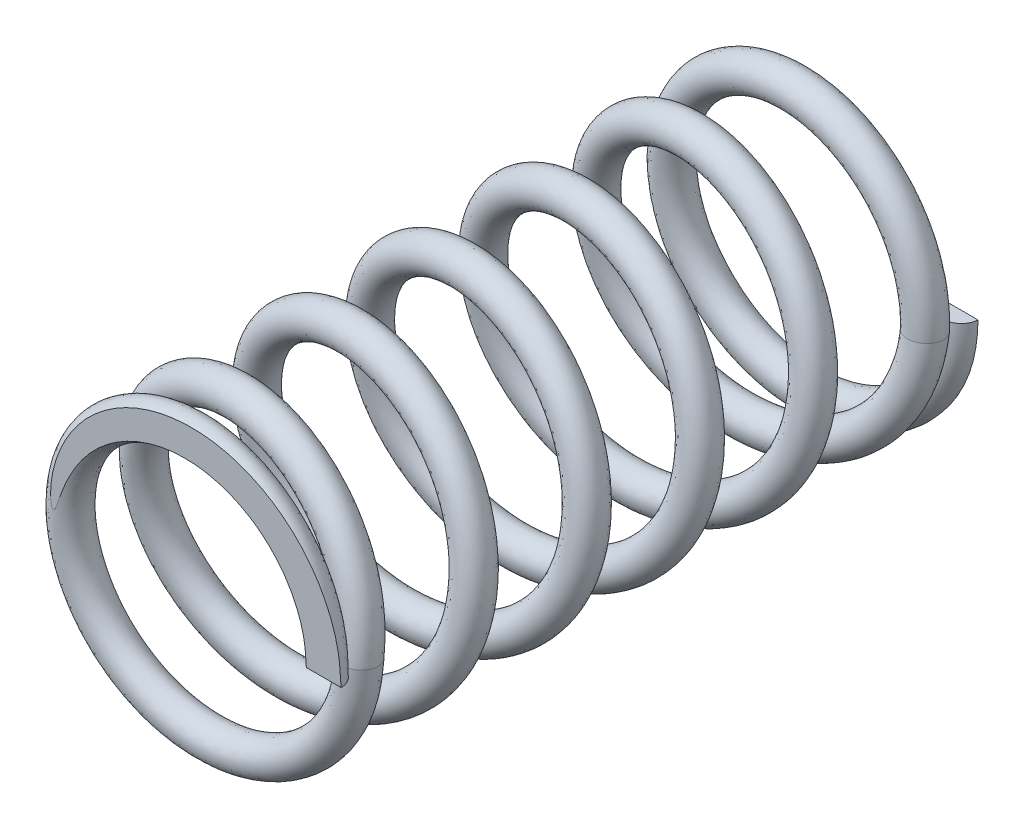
ISO-10303-21;
HEADER;
FILE_DESCRIPTION(('STEP AP214'),'2;1');
FILE_NAME('part.step','',(''),(''),'','','');
FILE_SCHEMA(('AUTOMOTIVE_DESIGN { 1 0 10303 214 1 1 1 1 }'));
ENDSEC;
DATA;
#1=APPLICATION_CONTEXT('core data for automotive mechanical design processes');
#2=APPLICATION_PROTOCOL_DEFINITION('international standard','automotive_design',2000,#1);
#3=PRODUCT_CONTEXT('',#1,'mechanical');
#4=PRODUCT('Part','Part','',(#3));
#5=PRODUCT_RELATED_PRODUCT_CATEGORY('part','',(#4));
#6=PRODUCT_DEFINITION_FORMATION('','',#4);
#7=PRODUCT_DEFINITION_CONTEXT('part definition',#1,'design');
#8=PRODUCT_DEFINITION('design','',#6,#7);
#9=PRODUCT_DEFINITION_SHAPE('','',#8);
#10=(LENGTH_UNIT() NAMED_UNIT(*) SI_UNIT(.MILLI.,.METRE.));
#11=(NAMED_UNIT(*) PLANE_ANGLE_UNIT() SI_UNIT($,.RADIAN.));
#12=(NAMED_UNIT(*) SI_UNIT($,.STERADIAN.) SOLID_ANGLE_UNIT());
#13=UNCERTAINTY_MEASURE_WITH_UNIT(LENGTH_MEASURE(1.E-05),#10,'distance_accuracy_value','');
#14=(GEOMETRIC_REPRESENTATION_CONTEXT(3) GLOBAL_UNCERTAINTY_ASSIGNED_CONTEXT((#13)) GLOBAL_UNIT_ASSIGNED_CONTEXT((#10,
#11,#12)) REPRESENTATION_CONTEXT('',''));
#15=CARTESIAN_POINT('',(0.,0.,0.));
#16=DIRECTION('',(0.,0.,1.));
#17=DIRECTION('',(1.,0.,0.));
#18=AXIS2_PLACEMENT_3D('',#15,#16,#17);
#19=CARTESIAN_POINT('',(4.0513,0.,0.5207));
#20=CARTESIAN_POINT('',(4.03593937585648,0.264538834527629,0.509605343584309));
#21=CARTESIAN_POINT('',(4.00514866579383,0.794812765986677,0.487365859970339));
#22=CARTESIAN_POINT('',(3.76567401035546,1.56020223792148,0.454107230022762));
#23=CARTESIAN_POINT('',(3.39050491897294,2.26541616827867,0.420725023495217));
#24=CARTESIAN_POINT('',(2.82718072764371,2.95150674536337,0.383652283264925));
#25=CARTESIAN_POINT('',(2.04868578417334,3.5484977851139,0.342895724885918));
#26=CARTESIAN_POINT('',(1.06058714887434,3.95804207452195,0.298512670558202));
#27=CARTESIAN_POINT('',(-1.94198035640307E-05,4.09801422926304,0.254009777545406));
#28=CARTESIAN_POINT('',(-1.0605213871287,3.9578709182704,0.209550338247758));
#29=CARTESIAN_POINT('',(-2.04877782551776,3.5486354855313,0.165148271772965));
#30=CARTESIAN_POINT('',(-2.89775832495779,2.89774209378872,0.120671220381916));
#31=CARTESIAN_POINT('',(-3.54854872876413,2.0487330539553,0.0761987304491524));
#32=CARTESIAN_POINT('',(-3.95796092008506,1.06056024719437,0.0317968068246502));
#33=CARTESIAN_POINT('',(-4.09804056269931,-1.19011055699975E-05,-0.0126773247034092));
#34=CARTESIAN_POINT('',(-3.95787566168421,-1.06052994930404,-0.0571515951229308));
#35=CARTESIAN_POINT('',(-3.54863000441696,-2.04877145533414,-0.101553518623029));
#36=CARTESIAN_POINT('',(-2.89774375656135,-2.89776098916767,-0.146025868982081));
#37=CARTESIAN_POINT('',(-2.04873630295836,-3.54855087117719,-0.190503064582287));
#38=CARTESIAN_POINT('',(-1.06055284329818,-3.95795323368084,-0.234905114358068));
#39=CARTESIAN_POINT('',(5.14381167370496E-06,-4.09804366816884,-0.279364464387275));
#40=CARTESIAN_POINT('',(1.06054777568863,-3.95790117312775,-0.323867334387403));
#41=CARTESIAN_POINT('',(2.04873491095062,-3.54867028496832,-0.368251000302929));
#42=CARTESIAN_POINT('',(2.82723195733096,-2.9512982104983,-0.409005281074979));
#43=CARTESIAN_POINT('',(3.39044505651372,-2.26603253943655,-0.446084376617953));
#44=CARTESIAN_POINT('',(3.76563382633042,-1.55771441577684,-0.479444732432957));
#45=CARTESIAN_POINT('',(4.00580820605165,-0.802204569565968,-0.512864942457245));
#46=CARTESIAN_POINT('',(4.03615270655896,-0.240807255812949,-0.534981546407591));
#47=CARTESIAN_POINT('',(4.05134539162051,0.040269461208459,-0.546054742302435));
#48=CARTESIAN_POINT('',(5.0927,0.,0.5207));
#49=CARTESIAN_POINT('',(5.07341899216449,0.33275525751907,0.50961034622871));
#50=CARTESIAN_POINT('',(5.03476978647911,0.999770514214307,0.487380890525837));
#51=CARTESIAN_POINT('',(4.7340661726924,1.95995029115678,0.454019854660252));
#52=CARTESIAN_POINT('',(4.26199689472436,2.84809548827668,0.420608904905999));
#53=CARTESIAN_POINT('',(3.5533018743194,3.71058354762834,0.383666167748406));
#54=CARTESIAN_POINT('',(2.57657518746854,4.46008664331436,0.342960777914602));
#55=CARTESIAN_POINT('',(1.33228646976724,4.97588835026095,0.298340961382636));
#56=CARTESIAN_POINT('',(-6.91357514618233E-05,5.15120769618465,0.253989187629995));
#57=CARTESIAN_POINT('',(-1.33224084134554,4.97566685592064,0.209592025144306));
#58=CARTESIAN_POINT('',(-2.57630772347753,4.46047695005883,0.165010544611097));
#59=CARTESIAN_POINT('',(-3.6424900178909,3.64247439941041,0.120629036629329));
#60=CARTESIAN_POINT('',(-4.4603900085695,2.57625911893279,0.0762413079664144));
#61=CARTESIAN_POINT('',(-4.97574606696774,1.33231609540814,0.031663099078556));
#62=CARTESIAN_POINT('',(-5.15125175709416,-9.91923952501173E-06,-0.0127225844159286));
#63=CARTESIAN_POINT('',(-4.97566167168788,-1.33228280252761,-0.0571084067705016));
#64=CARTESIAN_POINT('',(-4.46047279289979,-2.57629478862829,-0.101686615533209));
#65=CARTESIAN_POINT('',(-3.64247825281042,-3.64249049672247,-0.14607420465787));
#66=CARTESIAN_POINT('',(-2.57626891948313,-4.46039081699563,-0.190455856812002));
#67=CARTESIAN_POINT('',(-1.33227531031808,-4.97574836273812,-0.235037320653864));
#68=CARTESIAN_POINT('',(-4.85210686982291E-05,-5.1512369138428,-0.279434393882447));
#69=CARTESIAN_POINT('',(1.33224413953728,-4.97574913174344,-0.323786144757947));
#70=CARTESIAN_POINT('',(2.57662154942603,-4.46025757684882,-0.368406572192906));
#71=CARTESIAN_POINT('',(3.55335020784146,-3.71038807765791,-0.409109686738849));
#72=CARTESIAN_POINT('',(4.26193583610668,-2.84868610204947,-0.446058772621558));
#73=CARTESIAN_POINT('',(4.73402273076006,-1.95757264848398,-0.479447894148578));
#74=CARTESIAN_POINT('',(5.03558260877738,-1.00629737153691,-0.512970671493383));
#75=CARTESIAN_POINT('',(5.07367402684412,-0.308903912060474,-0.535077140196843));
#76=CARTESIAN_POINT('',(5.09274538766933,0.0402624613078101,-0.546145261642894));
#77=CARTESIAN_POINT('',(5.0927,0.,-0.5207));
#78=CARTESIAN_POINT('',(5.07342300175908,0.332758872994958,-0.531789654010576));
#79=CARTESIAN_POINT('',(5.03478183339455,0.999781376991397,-0.554019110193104));
#80=CARTESIAN_POINT('',(4.73399098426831,1.95990298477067,-0.587380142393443));
#81=CARTESIAN_POINT('',(4.26189556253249,2.84803792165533,-0.620791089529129));
#82=CARTESIAN_POINT('',(3.55332204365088,3.71058215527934,-0.657733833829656));
#83=CARTESIAN_POINT('',(2.57659919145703,4.46014905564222,-0.698439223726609));
#84=CARTESIAN_POINT('',(1.33223238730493,4.97572307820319,-0.743059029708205));
#85=CARTESIAN_POINT('',(-4.41383017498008E-05,5.15118617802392,-0.787410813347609));
#86=CARTESIAN_POINT('',(-1.33226317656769,4.97570581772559,-0.831807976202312));
#87=CARTESIAN_POINT('',(-2.5762456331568,4.46035073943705,-0.876389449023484));
#88=CARTESIAN_POINT('',(-3.64244273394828,3.64246137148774,-0.920770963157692));
#89=CARTESIAN_POINT('',(-4.46043322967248,2.57627225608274,-0.96515869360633));
#90=CARTESIAN_POINT('',(-4.97561709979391,1.33227123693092,-1.00973689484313));
#91=CARTESIAN_POINT('',(-5.15120598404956,1.43725117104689E-05,-1.05412258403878));
#92=CARTESIAN_POINT('',(-4.97570217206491,-1.33230405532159,-1.09850840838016));
#93=CARTESIAN_POINT('',(-4.46035031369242,-2.57623573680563,-1.14308660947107));
#94=CARTESIAN_POINT('',(-3.64246080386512,-3.64243902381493,-1.18747420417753));
#95=CARTESIAN_POINT('',(-2.57628515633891,-4.4604369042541,-1.23185585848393));
#96=CARTESIAN_POINT('',(-1.33222935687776,-4.97562416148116,-1.27643731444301));
#97=CARTESIAN_POINT('',(-7.35139588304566E-05,-5.15115483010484,-1.32083439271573));
#98=CARTESIAN_POINT('',(1.33227460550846,-4.97587091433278,-1.36518614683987));
#99=CARTESIAN_POINT('',(2.5765516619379,-4.45994811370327,-1.40980656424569));
#100=CARTESIAN_POINT('',(3.55326692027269,-3.71088420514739,-1.45050968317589));
#101=CARTESIAN_POINT('',(4.26196142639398,-2.84717242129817,-1.48745877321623));
#102=CARTESIAN_POINT('',(4.73401371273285,-1.96332415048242,-1.5208478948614));
#103=CARTESIAN_POINT('',(5.03548096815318,-0.984754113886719,-1.5543706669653));
#104=CARTESIAN_POINT('',(5.07357962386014,-0.355380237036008,-1.5764771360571));
#105=CARTESIAN_POINT('',(5.09265460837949,-0.0402694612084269,-1.58754525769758));
#106=CARTESIAN_POINT('',(4.0513,0.,-0.5207));
#107=CARTESIAN_POINT('',(4.03594338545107,0.264542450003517,-0.531794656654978));
#108=CARTESIAN_POINT('',(4.00516071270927,0.794823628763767,-0.554034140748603));
#109=CARTESIAN_POINT('',(3.76559882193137,1.56015493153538,-0.587292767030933));
#110=CARTESIAN_POINT('',(3.39040358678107,2.26535860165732,-0.620674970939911));
#111=CARTESIAN_POINT('',(2.82720089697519,2.95150535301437,-0.657747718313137));
#112=CARTESIAN_POINT('',(2.04870978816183,3.54856019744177,-0.698504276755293));
#113=CARTESIAN_POINT('',(1.06053306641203,3.9578768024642,-0.742887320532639));
#114=CARTESIAN_POINT('',(5.57764614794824E-06,4.09799271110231,-0.787390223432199));
#115=CARTESIAN_POINT('',(-1.06054372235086,3.95790988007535,-0.83184966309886));
#116=CARTESIAN_POINT('',(-2.04871573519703,3.54850927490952,-0.876251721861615));
#117=CARTESIAN_POINT('',(-2.89771104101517,2.89772906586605,-0.920728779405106));
#118=CARTESIAN_POINT('',(-3.54859194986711,2.04874619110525,-0.965201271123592));
#119=CARTESIAN_POINT('',(-3.95783195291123,1.06051538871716,-1.00960318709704));
#120=CARTESIAN_POINT('',(-4.09799478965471,1.23906456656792E-05,-1.05407732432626));
#121=CARTESIAN_POINT('',(-3.95791616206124,-1.06055120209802,-1.09855159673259));
#122=CARTESIAN_POINT('',(-3.54850752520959,-2.04871240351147,-1.14295351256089));
#123=CARTESIAN_POINT('',(-2.89772630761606,-2.89770951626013,-1.18742586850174));
#124=CARTESIAN_POINT('',(-2.04875253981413,-3.54859695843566,-1.23190306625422));
#125=CARTESIAN_POINT('',(-1.06050688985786,-3.95782903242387,-1.27630510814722));
#126=CARTESIAN_POINT('',(-1.9849078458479E-05,-4.09796158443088,-1.32076446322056));
#127=CARTESIAN_POINT('',(1.06057824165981,-3.9580229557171,-1.36526733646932));
#128=CARTESIAN_POINT('',(2.04866502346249,-3.54836082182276,-1.40965099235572));
#129=CARTESIAN_POINT('',(2.8271486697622,-2.95179433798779,-1.45040527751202));
#130=CARTESIAN_POINT('',(3.39047064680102,-2.26451885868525,-1.48748437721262));
#131=CARTESIAN_POINT('',(3.76562480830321,-1.56346591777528,-1.52084473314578));
#132=CARTESIAN_POINT('',(4.00570656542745,-0.780661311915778,-1.55426493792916));
#133=CARTESIAN_POINT('',(4.03605830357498,-0.287283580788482,-1.57638154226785));
#134=CARTESIAN_POINT('',(4.05125461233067,-0.040262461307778,-1.58745473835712));
#135=CARTESIAN_POINT('',(3.0099,0.,-0.5207));
#136=CARTESIAN_POINT('',(2.99846376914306,0.196326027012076,-0.531799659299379));
#137=CARTESIAN_POINT('',(2.97553959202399,0.589865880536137,-0.554049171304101));
#138=CARTESIAN_POINT('',(2.79720665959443,1.16040687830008,-0.587205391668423));
#139=CARTESIAN_POINT('',(2.51891161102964,1.68267928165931,-0.620558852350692));
#140=CARTESIAN_POINT('',(2.10107975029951,2.1924285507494,-0.657761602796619));
#141=CARTESIAN_POINT('',(1.52082038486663,2.63697133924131,-0.698569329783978));
#142=CARTESIAN_POINT('',(0.78883374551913,2.9400305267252,-0.742715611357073));
#143=CARTESIAN_POINT('',(5.52935940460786E-05,3.0447992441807,-0.787369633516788));
#144=CARTESIAN_POINT('',(-0.788824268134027,2.94011394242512,-0.831891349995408));
#145=CARTESIAN_POINT('',(-1.52118583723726,2.636667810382,-0.876113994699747));
#146=CARTESIAN_POINT('',(-2.15297934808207,2.15299676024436,-0.92068659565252));
#147=CARTESIAN_POINT('',(-2.63675067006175,1.52122012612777,-0.965243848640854));
#148=CARTESIAN_POINT('',(-2.94004680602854,0.788759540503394,-1.00946947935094));
#149=CARTESIAN_POINT('',(-3.04478359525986,1.04087796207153E-05,-1.05403206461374));
#150=CARTESIAN_POINT('',(-2.94013015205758,-0.788798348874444,-1.09859478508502));
#151=CARTESIAN_POINT('',(-2.63666473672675,-1.52118907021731,-1.14282041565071));
#152=CARTESIAN_POINT('',(-2.15299181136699,-2.15298000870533,-1.18737753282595));
#153=CARTESIAN_POINT('',(-1.52121992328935,-2.63675701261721,-1.2319502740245));
#154=CARTESIAN_POINT('',(-0.788784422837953,-2.94003390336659,-1.27617290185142));
#155=CARTESIAN_POINT('',(3.38158019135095E-05,-3.04476833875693,-1.32069453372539));
#156=CARTESIAN_POINT('',(0.788881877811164,-2.94017499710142,-1.36534852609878));
#157=CARTESIAN_POINT('',(1.52077838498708,-2.63677352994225,-1.40949542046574));
#158=CARTESIAN_POINT('',(2.1010304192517,-2.19270447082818,-1.45030087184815));
#159=CARTESIAN_POINT('',(2.51897986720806,-1.68186529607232,-1.48750998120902));
#160=CARTESIAN_POINT('',(2.79723590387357,-1.16360768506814,-1.52084157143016));
#161=CARTESIAN_POINT('',(2.97593216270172,-0.576568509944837,-1.55415920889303));
#162=CARTESIAN_POINT('',(2.99853698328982,-0.219186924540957,-1.5762859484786));
#163=CARTESIAN_POINT('',(3.00985461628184,-0.0402554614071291,-1.58736421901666));
#164=CARTESIAN_POINT('',(3.0099,0.,0.5207));
#165=CARTESIAN_POINT('',(2.99845975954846,0.196322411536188,0.509600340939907));
#166=CARTESIAN_POINT('',(2.97552754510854,0.589855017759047,0.487350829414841));
#167=CARTESIAN_POINT('',(2.79728184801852,1.16045418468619,0.454194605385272));
#168=CARTESIAN_POINT('',(2.51901294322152,1.68273684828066,0.420841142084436));
#169=CARTESIAN_POINT('',(2.10105958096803,2.1924299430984,0.383638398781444));
#170=CARTESIAN_POINT('',(1.52079638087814,2.63690892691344,0.342830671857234));
#171=CARTESIAN_POINT('',(0.788887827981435,2.94019579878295,0.298684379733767));
#172=CARTESIAN_POINT('',(3.02961443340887E-05,3.04482076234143,0.254030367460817));
#173=CARTESIAN_POINT('',(-0.788801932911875,2.94007498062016,0.209508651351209));
#174=CARTESIAN_POINT('',(-1.52124792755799,2.63679402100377,0.165285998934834));
#175=CARTESIAN_POINT('',(-2.15302663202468,2.15300978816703,0.120713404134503));
#176=CARTESIAN_POINT('',(-2.63670744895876,1.52120698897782,0.0761561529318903));
#177=CARTESIAN_POINT('',(-2.94017577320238,0.788804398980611,0.0319305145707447));
#178=CARTESIAN_POINT('',(-3.04482936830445,-1.38829716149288E-05,-0.0126320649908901));
#179=CARTESIAN_POINT('',(-2.94008965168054,-0.788777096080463,-0.0571947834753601));
#180=CARTESIAN_POINT('',(-2.63678721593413,-1.52124812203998,-0.101420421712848));
#181=CARTESIAN_POINT('',(-2.15300926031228,-2.15303148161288,-0.145977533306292));
#182=CARTESIAN_POINT('',(-1.52120368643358,-2.63671092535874,-0.190550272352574));
#183=CARTESIAN_POINT('',(-0.788830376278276,-2.94015810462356,-0.234772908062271));
#184=CARTESIAN_POINT('',(5.88086920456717E-05,-3.04485042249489,-0.279294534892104));
#185=CARTESIAN_POINT('',(0.788851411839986,-2.94005321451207,-0.323948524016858));
#186=CARTESIAN_POINT('',(1.52084827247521,-2.63708299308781,-0.368095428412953));
#187=CARTESIAN_POINT('',(2.10111370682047,-2.1922083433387,-0.408900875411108));
#188=CARTESIAN_POINT('',(2.51895427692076,-1.68337897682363,-0.446109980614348));
#189=CARTESIAN_POINT('',(2.79724492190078,-1.1578561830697,-0.479441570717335));
#190=CARTESIAN_POINT('',(2.97603380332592,-0.598111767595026,-0.512759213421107));
#191=CARTESIAN_POINT('',(2.9986313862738,-0.172710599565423,-0.534885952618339));
#192=CARTESIAN_POINT('',(3.00994539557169,0.0402764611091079,-0.545964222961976));
#193=CARTESIAN_POINT('',(4.0513,0.,0.5207));
#194=CARTESIAN_POINT('',(4.03593937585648,0.264538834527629,0.509605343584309));
#195=CARTESIAN_POINT('',(4.00514866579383,0.794812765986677,0.487365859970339));
#196=CARTESIAN_POINT('',(3.76567401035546,1.56020223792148,0.454107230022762));
#197=CARTESIAN_POINT('',(3.39050491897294,2.26541616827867,0.420725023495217));
#198=CARTESIAN_POINT('',(2.82718072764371,2.95150674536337,0.383652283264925));
#199=CARTESIAN_POINT('',(2.04868578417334,3.5484977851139,0.342895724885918));
#200=CARTESIAN_POINT('',(1.06058714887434,3.95804207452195,0.298512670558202));
#201=CARTESIAN_POINT('',(-1.94198035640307E-05,4.09801422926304,0.254009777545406));
#202=CARTESIAN_POINT('',(-1.0605213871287,3.9578709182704,0.209550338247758));
#203=CARTESIAN_POINT('',(-2.04877782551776,3.5486354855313,0.165148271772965));
#204=CARTESIAN_POINT('',(-2.89775832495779,2.89774209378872,0.120671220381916));
#205=CARTESIAN_POINT('',(-3.54854872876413,2.0487330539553,0.0761987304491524));
#206=CARTESIAN_POINT('',(-3.95796092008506,1.06056024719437,0.0317968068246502));
#207=CARTESIAN_POINT('',(-4.09804056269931,-1.19011055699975E-05,-0.0126773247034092));
#208=CARTESIAN_POINT('',(-3.95787566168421,-1.06052994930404,-0.0571515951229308));
#209=CARTESIAN_POINT('',(-3.54863000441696,-2.04877145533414,-0.101553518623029));
#210=CARTESIAN_POINT('',(-2.89774375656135,-2.89776098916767,-0.146025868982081));
#211=CARTESIAN_POINT('',(-2.04873630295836,-3.54855087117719,-0.190503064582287));
#212=CARTESIAN_POINT('',(-1.06055284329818,-3.95795323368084,-0.234905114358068));
#213=CARTESIAN_POINT('',(5.14381167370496E-06,-4.09804366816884,-0.279364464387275));
#214=CARTESIAN_POINT('',(1.06054777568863,-3.95790117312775,-0.323867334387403));
#215=CARTESIAN_POINT('',(2.04873491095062,-3.54867028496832,-0.368251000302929));
#216=CARTESIAN_POINT('',(2.82723195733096,-2.9512982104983,-0.409005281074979));
#217=CARTESIAN_POINT('',(3.39044505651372,-2.26603253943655,-0.446084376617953));
#218=CARTESIAN_POINT('',(3.76563382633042,-1.55771441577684,-0.479444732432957));
#219=CARTESIAN_POINT('',(4.00580820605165,-0.802204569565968,-0.512864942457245));
#220=CARTESIAN_POINT('',(4.03615270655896,-0.240807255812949,-0.534981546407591));
#221=CARTESIAN_POINT('',(4.05134539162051,0.040269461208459,-0.546054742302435));
#222=(BOUNDED_SURFACE() B_SPLINE_SURFACE(3,3,((#19,#20,#21,#22,#23,#24,#25,#26,#27,#28,#29,#30,
#31,#32,#33,#34,#35,#36,#37,#38,#39,#40,#41,#42,#43,#44,#45,#46,#47),(#48,#49,#50,#51,#52,#53,
#54,#55,#56,#57,#58,#59,#60,#61,#62,#63,#64,#65,#66,#67,#68,#69,#70,#71,#72,#73,#74,#75,#76),
(#77,#78,#79,#80,#81,#82,#83,#84,#85,#86,#87,#88,#89,#90,#91,#92,#93,#94,#95,#96,#97,#98,#99,
#100,#101,#102,#103,#104,#105),(#106,#107,#108,#109,#110,#111,#112,#113,#114,#115,#116,#117,
#118,#119,#120,#121,#122,#123,#124,#125,#126,#127,#128,#129,#130,#131,#132,#133,#134),(#135,
#136,#137,#138,#139,#140,#141,#142,#143,#144,#145,#146,#147,#148,#149,#150,#151,#152,#153,#154,
#155,#156,#157,#158,#159,#160,#161,#162,#163),(#164,#165,#166,#167,#168,#169,#170,#171,#172,
#173,#174,#175,#176,#177,#178,#179,#180,#181,#182,#183,#184,#185,#186,#187,#188,#189,#190,#191,
#192),(#193,#194,#195,#196,#197,#198,#199,#200,#201,#202,#203,#204,#205,#206,#207,#208,#209,
#210,#211,#212,#213,#214,#215,#216,#217,#218,#219,#220,#221)),.UNSPECIFIED.,.T.,.F.,
.F.) B_SPLINE_SURFACE_WITH_KNOTS((4,3,4),(4,1,1,1,1,1,1,1,1,1,1,1,1,1,1,1,1,1,1,1,1,1,1,1,1,1,
4),(0.,0.5,1.),(0.,0.0312069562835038,0.0625550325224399,0.0938273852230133,0.125082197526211,
0.166742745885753,0.208367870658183,0.250020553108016,0.291675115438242,0.333300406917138,
0.374954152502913,0.416607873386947,0.458233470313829,0.499887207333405,0.541540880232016,
0.583166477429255,0.624820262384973,0.6664739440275,0.70809923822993,0.749753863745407,
0.791406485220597,0.833031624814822,0.874692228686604,0.905947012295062,0.937219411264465,
0.968567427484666,1.),
.UNSPECIFIED.) GEOMETRIC_REPRESENTATION_ITEM() RATIONAL_B_SPLINE_SURFACE(((1.,1.,1.,1.,1.,1.,1.,
1.,1.,1.,1.,1.,1.,1.,1.,1.,1.,1.,1.,1.,1.,1.,1.,1.,1.,1.,1.,1.,1.),(0.333333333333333,
0.333333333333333,0.333333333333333,0.333333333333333,0.333333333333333,0.333333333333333,
0.333333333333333,0.333333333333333,0.333333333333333,0.333333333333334,0.333333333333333,
0.333333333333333,0.333333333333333,0.333333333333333,0.333333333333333,0.333333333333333,
0.333333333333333,0.333333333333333,0.333333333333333,0.333333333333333,0.333333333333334,
0.333333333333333,0.333333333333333,0.333333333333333,0.333333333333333,0.333333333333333,
0.333333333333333,0.333333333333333,0.333333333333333),(0.333333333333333,0.333333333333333,
0.333333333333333,0.333333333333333,0.333333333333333,0.333333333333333,0.333333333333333,
0.333333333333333,0.333333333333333,0.333333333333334,0.333333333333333,0.333333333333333,
0.333333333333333,0.333333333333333,0.333333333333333,0.333333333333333,0.333333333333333,
0.333333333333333,0.333333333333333,0.333333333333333,0.333333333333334,0.333333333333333,
0.333333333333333,0.333333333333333,0.333333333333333,0.333333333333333,0.333333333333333,
0.333333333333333,0.333333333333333),(1.,1.,1.,1.,1.,1.,1.,1.,1.,1.,1.,1.,1.,1.,1.,1.,1.,1.,1.,
1.,1.,1.,1.,1.,1.,1.,1.,1.,1.),(0.333333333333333,0.333333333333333,0.333333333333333,
0.333333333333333,0.333333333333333,0.333333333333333,0.333333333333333,0.333333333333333,
0.333333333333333,0.333333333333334,0.333333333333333,0.333333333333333,0.333333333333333,
0.333333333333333,0.333333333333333,0.333333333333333,0.333333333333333,0.333333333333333,
0.333333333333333,0.333333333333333,0.333333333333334,0.333333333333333,0.333333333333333,
0.333333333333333,0.333333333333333,0.333333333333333,0.333333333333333,0.333333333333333,
0.333333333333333),(0.333333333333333,0.333333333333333,0.333333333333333,0.333333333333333,
0.333333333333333,0.333333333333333,0.333333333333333,0.333333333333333,0.333333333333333,
0.333333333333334,0.333333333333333,0.333333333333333,0.333333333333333,0.333333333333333,
0.333333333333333,0.333333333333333,0.333333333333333,0.333333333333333,0.333333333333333,
0.333333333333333,0.333333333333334,0.333333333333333,0.333333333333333,0.333333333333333,
0.333333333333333,0.333333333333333,0.333333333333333,0.333333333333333,0.333333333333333),(1.,
1.,1.,1.,1.,1.,1.,1.,1.,1.,1.,1.,1.,1.,1.,1.,1.,1.,1.,1.,1.,1.,1.,1.,1.,1.,1.,1.,1.))) REPRESENTATION_ITEM('') SURFACE());
#223=CARTESIAN_POINT('',(4.572,0.,0.));
#224=CARTESIAN_POINT('',(4.56867152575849,0.0573875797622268,0.));
#225=CARTESIAN_POINT('',(4.56533077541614,0.11477898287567,0.));
#226=CARTESIAN_POINT('',(4.55809671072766,0.229668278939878,0.));
#227=CARTESIAN_POINT('',(4.55420205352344,0.287166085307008,0.));
#228=CARTESIAN_POINT('',(4.54533988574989,0.402129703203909,0.));
#229=CARTESIAN_POINT('',(4.54037151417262,0.45959545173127,0.));
#230=CARTESIAN_POINT('',(4.52882502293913,0.574414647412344,0.));
#231=CARTESIAN_POINT('',(4.52224564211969,0.631767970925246,0.));
#232=CARTESIAN_POINT('',(4.50696862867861,0.746148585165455,0.));
#233=CARTESIAN_POINT('',(4.49827291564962,0.803176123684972,0.));
#234=CARTESIAN_POINT('',(4.47819686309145,0.916729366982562,0.));
#235=CARTESIAN_POINT('',(4.46681778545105,0.973255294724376,0.));
#236=CARTESIAN_POINT('',(4.42724431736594,1.1487516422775,0.));
#237=CARTESIAN_POINT('',(4.39449570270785,1.26671670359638,0.));
#238=CARTESIAN_POINT('',(4.31888069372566,1.49947535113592,0.));
#239=CARTESIAN_POINT('',(4.27599964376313,1.61426407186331,0.));
#240=CARTESIAN_POINT('',(4.18152255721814,1.84020071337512,0.));
#241=CARTESIAN_POINT('',(4.1299258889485,1.95134836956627,0.));
#242=CARTESIAN_POINT('',(4.01818084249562,2.1691732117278,0.));
#243=CARTESIAN_POINT('',(3.95803841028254,2.27585343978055,0.));
#244=CARTESIAN_POINT('',(3.82831536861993,2.48543843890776,0.));
#245=CARTESIAN_POINT('',(3.75861221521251,2.58826751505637,0.));
#246=CARTESIAN_POINT('',(3.61082525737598,2.78775011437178,0.));
#247=CARTESIAN_POINT('',(3.53273951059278,2.88440219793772,0.));
#248=CARTESIAN_POINT('',(3.36885909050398,3.07085977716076,0.));
#249=CARTESIAN_POINT('',(3.28306771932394,3.16066817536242,0.));
#250=CARTESIAN_POINT('',(3.10429726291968,3.33288293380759,0.));
#251=CARTESIAN_POINT('',(3.01131559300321,3.41528660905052,0.));
#252=CARTESIAN_POINT('',(2.81756972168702,3.57318777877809,0.));
#253=CARTESIAN_POINT('',(2.71671818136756,3.6485783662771,0.));
#254=CARTESIAN_POINT('',(2.5090958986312,3.79062626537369,0.));
#255=CARTESIAN_POINT('',(2.40232523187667,3.85728368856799,0.));
#256=CARTESIAN_POINT('',(2.07404323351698,4.04336119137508,0.));
#257=CARTESIAN_POINT('',(1.8444182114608,4.14900369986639,0.));
#258=CARTESIAN_POINT('',(1.48928402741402,4.27749968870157,0.));
#259=CARTESIAN_POINT('',(1.36892505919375,4.31537297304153,0.));
#260=CARTESIAN_POINT('',(1.12536986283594,4.38073905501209,0.));
#261=CARTESIAN_POINT('',(1.00217365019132,4.40823190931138,0.));
#262=CARTESIAN_POINT('',(0.753914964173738,4.45262025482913,0.));
#263=CARTESIAN_POINT('',(0.628852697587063,4.46951691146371,0.));
#264=CARTESIAN_POINT('',(0.377739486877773,4.49260638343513,0.));
#265=CARTESIAN_POINT('',(0.251688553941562,4.4987993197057,0.));
#266=CARTESIAN_POINT('',(0.000812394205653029,4.50031002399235,0.));
#267=CARTESIAN_POINT('',(-0.124012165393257,4.49573851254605,0.));
#268=CARTESIAN_POINT('',(-0.372818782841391,4.47598520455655,0.));
#269=CARTESIAN_POINT('',(-0.496800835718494,4.46080334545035,0.));
#270=CARTESIAN_POINT('',(-0.743035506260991,4.41996349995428,0.));
#271=CARTESIAN_POINT('',(-0.865288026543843,4.39430492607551,0.));
#272=CARTESIAN_POINT('',(-1.10714542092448,4.3326033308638,0.));
#273=CARTESIAN_POINT('',(-1.22675032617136,4.29656043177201,0.));
#274=CARTESIAN_POINT('',(-1.46096090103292,4.21484069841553,0.));
#275=CARTESIAN_POINT('',(-1.57561011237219,4.16928856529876,0.));
#276=CARTESIAN_POINT('',(-1.80063761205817,4.06863307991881,0.));
#277=CARTESIAN_POINT('',(-1.91101592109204,4.01352977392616,0.));
#278=CARTESIAN_POINT('',(-2.12663094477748,3.89407287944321,0.));
#279=CARTESIAN_POINT('',(-2.23186842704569,3.82972067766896,0.));
#280=CARTESIAN_POINT('',(-2.43638153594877,3.69215329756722,0.));
#281=CARTESIAN_POINT('',(-2.53565724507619,3.61893824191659,0.));
#282=CARTESIAN_POINT('',(-2.72602310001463,3.46536917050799,0.));
#283=CARTESIAN_POINT('',(-2.81721535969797,3.38514172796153,0.));
#284=CARTESIAN_POINT('',(-2.99232154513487,3.21710400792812,0.));
#285=CARTESIAN_POINT('',(-3.07623590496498,3.12929418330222,0.));
#286=CARTESIAN_POINT('',(-3.23607630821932,2.94659807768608,0.));
#287=CARTESIAN_POINT('',(-3.31199813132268,2.85170810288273,0.));
#288=CARTESIAN_POINT('',(-3.45516993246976,2.65560924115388,0.));
#289=CARTESIAN_POINT('',(-3.52242091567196,2.55440108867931,0.));
#290=CARTESIAN_POINT('',(-3.64545955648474,2.34986156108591,0.));
#291=CARTESIAN_POINT('',(-3.70155722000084,2.2467167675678,0.));
#292=CARTESIAN_POINT('',(-3.80436104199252,2.03579074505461,0.));
#293=CARTESIAN_POINT('',(-3.85106385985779,1.92800788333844,0.));
#294=CARTESIAN_POINT('',(-3.93437402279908,1.70872739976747,0.));
#295=CARTESIAN_POINT('',(-3.97099114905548,1.59723349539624,0.));
#296=CARTESIAN_POINT('',(-4.03330882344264,1.37130749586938,0.));
#297=CARTESIAN_POINT('',(-4.05902155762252,1.25687883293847,0.));
#298=CARTESIAN_POINT('',(-4.08729005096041,1.08972113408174,0.));
#299=CARTESIAN_POINT('',(-4.09479355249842,1.03780244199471,0.));
#300=CARTESIAN_POINT('',(-4.10708875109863,0.933605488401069,0.));
#301=CARTESIAN_POINT('',(-4.11187874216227,0.881327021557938,0.));
#302=CARTESIAN_POINT('',(-4.1183868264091,0.776616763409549,0.));
#303=CARTESIAN_POINT('',(-4.12010810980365,0.724185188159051,0.));
#304=CARTESIAN_POINT('',(-4.119806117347,0.645586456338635,0.));
#305=CARTESIAN_POINT('',(-4.11922608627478,0.619411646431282,0.));
#306=CARTESIAN_POINT('',(-4.11690895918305,0.567115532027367,0.));
#307=CARTESIAN_POINT('',(-4.1151722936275,0.540994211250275,0.));
#308=CARTESIAN_POINT('',(-4.11141709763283,0.501935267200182,0.));
#309=CARTESIAN_POINT('',(-4.10997456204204,0.488941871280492,0.));
#310=CARTESIAN_POINT('',(-4.10661528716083,0.463002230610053,0.));
#311=CARTESIAN_POINT('',(-4.10469812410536,0.45005603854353,0.));
#312=CARTESIAN_POINT('',(-4.10024893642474,0.4242973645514,0.));
#313=CARTESIAN_POINT('',(-4.09771818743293,0.411484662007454,0.));
#314=CARTESIAN_POINT('',(-4.09178648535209,0.386066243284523,0.));
#315=CARTESIAN_POINT('',(-4.08838711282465,0.373460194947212,0.));
#316=CARTESIAN_POINT('',(-4.08212633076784,0.354911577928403,0.));
#317=CARTESIAN_POINT('',(-4.07983987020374,0.348776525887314,0.));
#318=CARTESIAN_POINT('',(-4.07468647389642,0.336765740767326,0.));
#319=CARTESIAN_POINT('',(-4.07182216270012,0.330888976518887,0.));
#320=CARTESIAN_POINT('',(-4.06623210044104,0.321595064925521,0.));
#321=CARTESIAN_POINT('',(-4.06378217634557,0.318014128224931,0.));
#322=CARTESIAN_POINT('',(-4.05814735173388,0.311356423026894,0.));
#323=CARTESIAN_POINT('',(-4.05495778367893,0.308283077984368,0.));
#324=CARTESIAN_POINT('',(-4.04896168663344,0.30450687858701,0.));
#325=CARTESIAN_POINT('',(-4.04646940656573,0.303347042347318,0.));
#326=CARTESIAN_POINT('',(-4.0411949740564,0.301996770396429,0.));
#327=CARTESIAN_POINT('',(-4.038411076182,0.301812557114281,0.));
#328=CARTESIAN_POINT('',(-4.03322671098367,0.302412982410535,0.));
#329=CARTESIAN_POINT('',(-4.03081417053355,0.303112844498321,-1.81596956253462E-13));
#330=CARTESIAN_POINT('',(-4.02448512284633,0.305777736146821,-2.98899721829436E-13));
#331=CARTESIAN_POINT('',(-4.02082720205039,0.308300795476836,0.));
#332=CARTESIAN_POINT('',(-4.01287613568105,0.315035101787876,1.37045524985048E-13));
#333=CARTESIAN_POINT('',(-4.00885418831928,0.319525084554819,0.));
#334=CARTESIAN_POINT('',(-4.00139322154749,0.328993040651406,0.));
#335=CARTESIAN_POINT('',(-3.99795859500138,0.333974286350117,-2.13830423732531E-13));
#336=CARTESIAN_POINT('',(-3.99115345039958,0.344685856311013,-2.12208738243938E-13));
#337=CARTESIAN_POINT('',(-3.98782342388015,0.350441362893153,0.));
#338=CARTESIAN_POINT('',(-3.98146188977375,0.362116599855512,0.));
#339=CARTESIAN_POINT('',(-3.97843058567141,0.3680364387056,0.));
#340=CARTESIAN_POINT('',(-3.96963253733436,0.38596941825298,0.));
#341=CARTESIAN_POINT('',(-3.96417501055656,0.398132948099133,0.));
#342=CARTESIAN_POINT('',(-3.95369915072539,0.422647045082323,0.));
#343=CARTESIAN_POINT('',(-3.94868099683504,0.434997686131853,0.));
#344=CARTESIAN_POINT('',(-3.93892025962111,0.459786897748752,0.));
#345=CARTESIAN_POINT('',(-3.93417729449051,0.472225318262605,0.));
#346=CARTESIAN_POINT('',(-3.92028691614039,0.509359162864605,0.));
#347=CARTESIAN_POINT('',(-3.91137043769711,0.534140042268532,0.));
#348=CARTESIAN_POINT('',(-3.89373608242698,0.58377300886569,0.));
#349=CARTESIAN_POINT('',(-3.88501822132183,0.608625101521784,0.));
#350=CARTESIAN_POINT('',(-3.85883208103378,0.683201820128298,0.));
#351=CARTESIAN_POINT('',(-3.84134098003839,0.732919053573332,0.));
#352=CARTESIAN_POINT('',(-3.80552316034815,0.831922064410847,0.));
#353=CARTESIAN_POINT('',(-3.78719852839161,0.881208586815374,0.));
#354=CARTESIAN_POINT('',(-3.7493310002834,0.979311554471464,0.));
#355=CARTESIAN_POINT('',(-3.72978809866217,1.02812799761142,0.));
#356=CARTESIAN_POINT('',(-3.66850478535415,1.17492801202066,-1.36277528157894E-13));
#357=CARTESIAN_POINT('',(-3.62454936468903,1.2720053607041,0.));
#358=CARTESIAN_POINT('',(-3.53010535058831,1.46294665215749,0.));
#359=CARTESIAN_POINT('',(-3.47961636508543,1.55681040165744,0.));
#360=CARTESIAN_POINT('',(-3.37178497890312,1.74080770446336,0.));
#361=CARTESIAN_POINT('',(-3.31442781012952,1.83093263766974,0.));
#362=CARTESIAN_POINT('',(-3.19296047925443,2.00651040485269,0.));
#363=CARTESIAN_POINT('',(-3.12885040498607,2.09196329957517,0.));
#364=CARTESIAN_POINT('',(-2.98199905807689,2.27250896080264,0.));
#365=CARTESIAN_POINT('',(-2.89798116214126,2.36656905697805,0.));
#366=CARTESIAN_POINT('',(-2.72138928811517,2.54626088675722,0.));
#367=CARTESIAN_POINT('',(-2.62881668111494,2.63189396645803,0.));
#368=CARTESIAN_POINT('',(-2.43584907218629,2.79371681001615,0.));
#369=CARTESIAN_POINT('',(-2.33545887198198,2.8699122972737,0.));
#370=CARTESIAN_POINT('',(-2.12763165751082,3.0122707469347,0.));
#371=CARTESIAN_POINT('',(-2.02018719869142,3.07842285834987,0.));
#372=CARTESIAN_POINT('',(-1.81294705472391,3.19226377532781,0.));
#373=CARTESIAN_POINT('',(-1.71384768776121,3.24122407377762,0.));
#374=CARTESIAN_POINT('',(-1.51176375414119,3.33032716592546,0.));
#375=CARTESIAN_POINT('',(-1.40877941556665,3.37047047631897,0.));
#376=CARTESIAN_POINT('',(-1.19970685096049,3.44159570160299,0.));
#377=CARTESIAN_POINT('',(-1.09361903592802,3.47257882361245,0.));
#378=CARTESIAN_POINT('',(-0.879167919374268,3.52501381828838,0.));
#379=CARTESIAN_POINT('',(-0.770805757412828,3.54647035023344,0.));
#380=CARTESIAN_POINT('',(-0.55669419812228,3.57908050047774,0.));
#381=CARTESIAN_POINT('',(-0.450999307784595,3.59059046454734,0.));
#382=CARTESIAN_POINT('',(-0.239152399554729,3.60451624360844,0.));
#383=CARTESIAN_POINT('',(-0.133000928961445,3.60694092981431,0.));
#384=CARTESIAN_POINT('',(0.18527836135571,3.60031824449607,0.));
#385=CARTESIAN_POINT('',(0.397355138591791,3.57739319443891,0.));
#386=CARTESIAN_POINT('',(0.70747284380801,3.51646084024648,0.));
#387=CARTESIAN_POINT('',(0.808452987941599,3.49213004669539,0.));
#388=CARTESIAN_POINT('',(1.00797465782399,3.43494446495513,0.));
#389=CARTESIAN_POINT('',(1.10651701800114,3.40209263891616,0.));
#390=CARTESIAN_POINT('',(1.30041238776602,3.32812857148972,0.));
#391=CARTESIAN_POINT('',(1.39576643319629,3.2870190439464,0.));
#392=CARTESIAN_POINT('',(1.58269990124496,3.19679702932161,0.));
#393=CARTESIAN_POINT('',(1.6742750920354,3.14767585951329,0.));
#394=CARTESIAN_POINT('',(1.94005953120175,2.98998315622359,0.));
#395=CARTESIAN_POINT('',(2.10782178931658,2.87012876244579,0.));
#396=CARTESIAN_POINT('',(2.34230832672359,2.6707144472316,0.));
#397=CARTESIAN_POINT('',(2.41763939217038,2.60093705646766,0.));
#398=CARTESIAN_POINT('',(2.56203881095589,2.45519093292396,0.));
#399=CARTESIAN_POINT('',(2.63111023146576,2.37922526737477,0.));
#400=CARTESIAN_POINT('',(2.76196802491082,2.22229324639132,0.));
#401=CARTESIAN_POINT('',(2.82380795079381,2.14137144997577,0.));
#402=CARTESIAN_POINT('',(2.94028262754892,1.97458300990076,0.));
#403=CARTESIAN_POINT('',(2.9949224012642,1.88871987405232,0.));
#404=CARTESIAN_POINT('',(3.09678759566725,1.71263291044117,0.));
#405=CARTESIAN_POINT('',(3.14400879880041,1.62240664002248,0.));
#406=CARTESIAN_POINT('',(3.20917059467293,1.48442623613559,0.));
#407=CARTESIAN_POINT('',(3.22994703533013,1.43799035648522,0.));
#408=CARTESIAN_POINT('',(3.26961957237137,1.34432410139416,0.));
#409=CARTESIAN_POINT('',(3.28851561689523,1.29709370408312,0.));
#410=CARTESIAN_POINT('',(3.34381029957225,1.15003382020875,0.));
#411=CARTESIAN_POINT('',(3.37687567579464,1.04890223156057,0.));
#412=CARTESIAN_POINT('',(3.41878355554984,0.895101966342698,0.));
#413=CARTESIAN_POINT('',(3.43147526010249,0.843460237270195,0.));
#414=CARTESIAN_POINT('',(3.44843019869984,0.765548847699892,0.));
#415=CARTESIAN_POINT('',(3.45373445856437,0.739505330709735,0.));
#416=CARTESIAN_POINT('',(3.46361026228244,0.687279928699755,0.));
#417=CARTESIAN_POINT('',(3.46818181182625,0.66109804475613,0.));
#418=CARTESIAN_POINT('',(3.47805229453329,0.599867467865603,0.));
#419=CARTESIAN_POINT('',(3.48308475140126,0.564775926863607,0.));
#420=CARTESIAN_POINT('',(3.49214532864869,0.494456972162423,0.));
#421=CARTESIAN_POINT('',(3.49617319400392,0.459229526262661,0.));
#422=CARTESIAN_POINT('',(3.50342644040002,0.388679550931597,0.));
#423=CARTESIAN_POINT('',(3.50665150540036,0.353356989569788,0.));
#424=CARTESIAN_POINT('',(3.51250200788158,0.282693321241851,0.));
#425=CARTESIAN_POINT('',(3.51512794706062,0.247352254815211,0.));
#426=CARTESIAN_POINT('',(3.51998784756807,0.176659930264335,0.));
#427=CARTESIAN_POINT('',(3.52222198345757,0.141308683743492,0.));
#428=CARTESIAN_POINT('',(3.5265010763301,0.0706377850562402,0.));
#429=CARTESIAN_POINT('',(3.52854626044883,0.0353181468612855,0.));
#430=CARTESIAN_POINT('',(3.5306,0.,0.));
#431=B_SPLINE_CURVE_WITH_KNOTS('',3,(#223,#224,#225,#226,#227,#228,#229,#230,#231,#232,#233,
#234,#235,#236,#237,#238,#239,#240,#241,#242,#243,#244,#245,#246,#247,#248,#249,#250,#251,#252,
#253,#254,#255,#256,#257,#258,#259,#260,#261,#262,#263,#264,#265,#266,#267,#268,#269,#270,#271,
#272,#273,#274,#275,#276,#277,#278,#279,#280,#281,#282,#283,#284,#285,#286,#287,#288,#289,#290,
#291,#292,#293,#294,#295,#296,#297,#298,#299,#300,#301,#302,#303,#304,#305,#306,#307,#308,#309,
#310,#311,#312,#313,#314,#315,#316,#317,#318,#319,#320,#321,#322,#323,#324,#325,#326,#327,#328,
#329,#330,#331,#332,#333,#334,#335,#336,#337,#338,#339,#340,#341,#342,#343,#344,#345,#346,#347,
#348,#349,#350,#351,#352,#353,#354,#355,#356,#357,#358,#359,#360,#361,#362,#363,#364,#365,#366,
#367,#368,#369,#370,#371,#372,#373,#374,#375,#376,#377,#378,#379,#380,#381,#382,#383,#384,#385,
#386,#387,#388,#389,#390,#391,#392,#393,#394,#395,#396,#397,#398,#399,#400,#401,#402,#403,#404,
#405,#406,#407,#408,#409,#410,#411,#412,#413,#414,#415,#416,#417,#418,#419,#420,#421,#422,#423,
#424,#425,#426,#427,#428,#429,#430),.UNSPECIFIED.,.F.,.F.,(4,2,2,2,2,2,2,2,2,2,2,2,2,2,2,2,2,2,
2,2,2,2,2,2,2,2,2,2,2,2,2,2,2,2,2,2,2,2,2,2,2,2,2,2,2,2,2,2,2,2,2,2,2,2,2,2,2,2,2,2,2,2,2,2,2,2,
2,2,2,2,2,2,2,2,2,2,2,2,2,2,2,2,2,2,2,2,2,2,2,2,2,2,2,2,2,2,2,2,2,2,2,2,2,4),(0.,
0.17245962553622,0.345344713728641,0.518368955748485,0.691529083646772,0.864532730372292,
1.03745518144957,1.40415060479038,1.77137970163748,2.13863542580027,2.50563686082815,
2.87788054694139,3.25021067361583,3.62238199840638,3.9946877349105,4.3719647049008,
4.74923685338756,5.5032315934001,5.88142269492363,6.25961173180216,6.63775916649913,
7.01590232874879,7.39017301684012,7.76444591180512,8.13873979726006,8.51302927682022,
8.88268829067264,9.25234551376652,9.62194737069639,9.99154411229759,10.3554778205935,
10.719389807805,11.0834929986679,11.4475539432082,11.7993424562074,12.1512558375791,
12.5028267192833,12.8540036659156,13.0113218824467,13.1687388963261,13.3259921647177,
13.4045187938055,13.4830162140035,13.5222300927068,13.5614791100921,13.6006472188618,
13.6397445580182,13.6593742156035,13.6789166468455,13.6919036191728,13.704974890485,
13.7130840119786,13.7212447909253,13.7286791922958,13.7417915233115,13.7597898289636,
13.7779173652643,13.797851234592,13.8177985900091,13.8577730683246,13.8977637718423,
13.9376975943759,14.0167023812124,14.0957134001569,14.253823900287,14.4115582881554,
14.5692933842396,14.8887526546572,15.2082311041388,15.528409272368,15.8485832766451,
16.2263760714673,16.6041084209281,16.9816105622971,17.3595177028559,17.6907098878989,
18.021882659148,18.3530117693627,18.6839787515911,19.0025283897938,19.320766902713,
19.9568721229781,20.268204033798,20.5794278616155,20.890549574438,21.2020107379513,
21.8170215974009,22.1247887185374,22.4324042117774,22.7375740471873,23.0425298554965,
23.3476584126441,23.5002370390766,23.6528198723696,23.9714645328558,24.1309351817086,
24.210659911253,24.2903840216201,24.3967167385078,24.5030764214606,24.6094779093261,
24.715789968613,24.8220545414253,24.9281896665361),.UNSPECIFIED.);
#432=CARTESIAN_POINT('',(4.572,0.,0.));
#433=VERTEX_POINT('',#432);
#434=CARTESIAN_POINT('',(3.5306,0.,0.));
#435=VERTEX_POINT('',#434);
#436=EDGE_CURVE('E50',#433,#435,#431,.T.);
#437=CARTESIAN_POINT('',(4.0513,0.,0.));
#438=DIRECTION('',(0.,1.,0.));
#439=DIRECTION('',(0.,0.,1.));
#440=AXIS2_PLACEMENT_3D('',#437,#438,#439);
#441=CIRCLE('',#440,0.5207);
#442=EDGE_CURVE('E67',#433,#435,#441,.T.);
#443=CARTESIAN_POINT('',(4.05134539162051,0.040269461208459,-0.546054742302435));
#444=CARTESIAN_POINT('',(3.00994539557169,0.0402764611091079,-0.545964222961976));
#445=CARTESIAN_POINT('',(3.00985461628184,-0.0402554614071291,-1.58736421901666));
#446=CARTESIAN_POINT('',(4.05125461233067,-0.040262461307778,-1.58745473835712));
#447=CARTESIAN_POINT('',(5.09265460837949,-0.0402694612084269,-1.58754525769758));
#448=CARTESIAN_POINT('',(5.09274538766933,0.0402624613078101,-0.546145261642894));
#449=CARTESIAN_POINT('',(4.05134539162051,0.040269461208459,-0.546054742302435));
#450=(BOUNDED_CURVE() B_SPLINE_CURVE(3,(#443,#444,#445,#446,#447,#448,#449),.UNSPECIFIED.,.T.,
.F.) B_SPLINE_CURVE_WITH_KNOTS((4,3,4),(0.,0.5,1.),
.UNSPECIFIED.) CURVE() GEOMETRIC_REPRESENTATION_ITEM() RATIONAL_B_SPLINE_CURVE((1.,
0.333333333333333,0.333333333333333,1.,0.333333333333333,0.333333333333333,1.)) REPRESENTATION_ITEM(''));
#451=CARTESIAN_POINT('',(4.05134539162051,0.040269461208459,-0.546054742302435));
#452=VERTEX_POINT('',#451);
#453=EDGE_CURVE('E73',#452,#452,#450,.T.);
#454=ORIENTED_EDGE('',*,*,#436,.F.);
#455=ORIENTED_EDGE('',*,*,#442,.T.);
#456=EDGE_LOOP('',(#454,#455));
#457=FACE_BOUND('',#456,.T.);
#458=ORIENTED_EDGE('',*,*,#453,.T.);
#459=EDGE_LOOP('',(#458));
#460=FACE_BOUND('',#459,.T.);
#461=ADVANCED_FACE('F34',(#457,#460),#222,.T.);
#462=CARTESIAN_POINT('',(4.0513,0.,0.));
#463=DIRECTION('',(0.,1.,0.));
#464=DIRECTION('',(0.,0.,1.));
#465=AXIS2_PLACEMENT_3D('',#462,#463,#464);
#466=PLANE('',#465);
#467=ORIENTED_EDGE('',*,*,#442,.F.);
#468=DIRECTION('',(-1.,0.,0.));
#469=VECTOR('',#468,1.);
#470=CARTESIAN_POINT('',(4.0513,0.,0.));
#471=LINE('',#470,#469);
#472=EDGE_CURVE('E11',#433,#435,#471,.T.);
#473=ORIENTED_EDGE('',*,*,#472,.T.);
#474=EDGE_LOOP('',(#467,#473));
#475=FACE_BOUND('',#474,.T.);
#476=ADVANCED_FACE('F69',(#475),#466,.F.);
#477=CARTESIAN_POINT('',(4.05134539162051,0.040269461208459,-0.546054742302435));
#478=CARTESIAN_POINT('',(4.05134539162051,0.371202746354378,-0.585030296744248));
#479=CARTESIAN_POINT('',(3.95165140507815,1.06146006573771,-0.683956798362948));
#480=CARTESIAN_POINT('',(3.58128638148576,1.98128811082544,-0.811549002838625));
#481=CARTESIAN_POINT('',(2.99046969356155,2.7946021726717,-0.945329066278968));
#482=CARTESIAN_POINT('',(2.22199317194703,3.43604428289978,-1.07704685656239));
#483=CARTESIAN_POINT('',(1.32065570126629,3.87423001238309,-1.20908866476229));
#484=CARTESIAN_POINT('',(0.339741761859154,4.07832881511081,-1.34150193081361));
#485=CARTESIAN_POINT('',(-0.661409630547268,4.03860665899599,-1.47349135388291));
#486=CARTESIAN_POINT('',(-1.62314425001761,3.75738543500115,-1.60569382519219));
#487=CARTESIAN_POINT('',(-2.48698488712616,3.24986314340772,-1.73793365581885));
#488=CARTESIAN_POINT('',(-3.20250078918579,2.54840009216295,-1.86991891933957));
#489=CARTESIAN_POINT('',(-3.72574998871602,1.69391755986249,-2.00227423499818));
#490=CARTESIAN_POINT('',(-4.02520198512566,0.737814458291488,-2.13434184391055));
#491=CARTESIAN_POINT('',(-4.08452923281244,-0.262431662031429,-2.26641319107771));
#492=CARTESIAN_POINT('',(-3.89791071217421,-1.24682433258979,-2.39876906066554));
#493=CARTESIAN_POINT('',(-3.47809618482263,-2.15659688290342,-2.53075204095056));
#494=CARTESIAN_POINT('',(-2.85021162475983,-2.93746359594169,-2.66298199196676));
#495=CARTESIAN_POINT('',(-2.05075484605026,-3.54134185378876,-2.79520747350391));
#496=CARTESIAN_POINT('',(-1.12887027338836,-3.93395898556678,-2.92719205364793));
#497=CARTESIAN_POINT('',(-0.139193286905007,-4.09037722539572,-3.0595500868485));
#498=CARTESIAN_POINT('',(0.858726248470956,-4.00115094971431,-3.19161697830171));
#499=CARTESIAN_POINT('',(1.80553714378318,-3.67318491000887,-3.3236879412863));
#500=CARTESIAN_POINT('',(2.64358127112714,-3.12406087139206,-3.45604411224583));
#501=CARTESIAN_POINT('',(3.32344548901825,-2.38804798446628,-3.58802706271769));
#502=CARTESIAN_POINT('',(3.80459128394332,-1.50913353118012,-3.72025697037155));
#503=CARTESIAN_POINT('',(4.05656315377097,-0.539437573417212,-3.8524824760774));
#504=CARTESIAN_POINT('',(4.06650413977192,0.462520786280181,-3.98446705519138));
#505=CARTESIAN_POINT('',(3.83228276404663,1.43672176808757,-4.1168250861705));
#506=CARTESIAN_POINT('',(3.3679611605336,2.32453378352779,-4.2488919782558));
#507=CARTESIAN_POINT('',(2.70263120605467,3.07376582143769,-4.38096294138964));
#508=CARTESIAN_POINT('',(1.87460114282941,3.63787696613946,-4.51331911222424));
#509=CARTESIAN_POINT('',(0.93444112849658,3.98432966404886,-4.64530206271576));
#510=CARTESIAN_POINT('',(-0.0616964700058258,4.09250441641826,-4.77753197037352));
#511=CARTESIAN_POINT('',(-1.0540041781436,3.95420949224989,-4.90975747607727));
#512=CARTESIAN_POINT('',(-1.98349724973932,3.57996090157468,-5.04174205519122));
#513=CARTESIAN_POINT('',(-2.79390895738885,2.99075799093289,-5.17410008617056));
#514=CARTESIAN_POINT('',(-3.43645212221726,2.22202981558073,-5.30616697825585));
#515=CARTESIAN_POINT('',(-3.87404151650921,1.32062640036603,-5.43823794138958));
#516=CARTESIAN_POINT('',(-4.07833887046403,0.339750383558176,-5.57059411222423));
#517=CARTESIAN_POINT('',(-4.03863576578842,-0.661425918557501,-5.70257706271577));
#518=CARTESIAN_POINT('',(-3.75737085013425,-1.62313374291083,-5.8348069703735));
#519=CARTESIAN_POINT('',(-3.24986328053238,-2.48698334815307,-5.96703247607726));
#520=CARTESIAN_POINT('',(-2.54840106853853,-3.20250423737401,-6.09901705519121));
#521=CARTESIAN_POINT('',(-1.69391742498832,-3.72574883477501,-6.23137508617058));
#522=CARTESIAN_POINT('',(-0.737814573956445,-4.02520177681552,-6.36344197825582));
#523=CARTESIAN_POINT('',(0.262431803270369,-4.08452950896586,-6.49551294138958));
#524=CARTESIAN_POINT('',(1.2468242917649,-3.89791065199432,-6.62786911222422));
#525=CARTESIAN_POINT('',(2.15659686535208,-3.47809618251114,-6.75985206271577));
#526=CARTESIAN_POINT('',(2.93746361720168,-2.85021163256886,-6.89208197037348));
#527=CARTESIAN_POINT('',(3.54134184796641,-2.05075484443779,-7.02430747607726));
#528=CARTESIAN_POINT('',(3.93395898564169,-1.12887027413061,-7.15629205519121));
#529=CARTESIAN_POINT('',(4.090377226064,-0.13919328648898,-7.28865008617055));
#530=CARTESIAN_POINT('',(4.00115094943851,0.858726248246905,-7.42071697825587));
#531=CARTESIAN_POINT('',(3.67318491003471,1.80553714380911,-7.55278794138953));
#532=CARTESIAN_POINT('',(3.12406087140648,2.64358127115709,-7.68514411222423));
#533=CARTESIAN_POINT('',(2.38804798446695,3.32344548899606,-7.81712706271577));
#534=CARTESIAN_POINT('',(1.50913353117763,3.80459128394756,-7.94935697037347));
#535=CARTESIAN_POINT('',(0.539437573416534,4.05656315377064,-8.08158247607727));
#536=CARTESIAN_POINT('',(-0.462520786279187,4.06650413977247,-8.21356705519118));
#537=CARTESIAN_POINT('',(-1.43672176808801,3.83228276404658,-8.34592508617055));
#538=CARTESIAN_POINT('',(-2.3245337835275,3.36796116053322,-8.47799197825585));
#539=CARTESIAN_POINT('',(-3.07376582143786,2.70263120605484,-8.61006294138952));
#540=CARTESIAN_POINT('',(-3.63787696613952,1.87460114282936,-8.74241911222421));
#541=CARTESIAN_POINT('',(-3.98432966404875,0.934441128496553,-8.87440206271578));
#542=CARTESIAN_POINT('',(-4.0925044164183,-0.0616964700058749,-9.00663197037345));
#543=CARTESIAN_POINT('',(-3.95420949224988,-1.05400417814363,-9.13885747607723));
#544=CARTESIAN_POINT('',(-3.57996090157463,-1.98349724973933,-9.27084205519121));
#545=CARTESIAN_POINT('',(-2.99075799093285,-2.79390895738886,-9.40320008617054));
#546=CARTESIAN_POINT('',(-2.2220298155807,-3.4364521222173,-9.53526697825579));
#547=CARTESIAN_POINT('',(-1.32062640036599,-3.87404151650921,-9.66733794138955));
#548=CARTESIAN_POINT('',(-0.339750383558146,-4.07833887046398,-9.79969411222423));
#549=CARTESIAN_POINT('',(0.661425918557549,-4.03863576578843,-9.93167706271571));
#550=CARTESIAN_POINT('',(1.62313374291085,-3.75737085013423,-10.0639069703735));
#551=CARTESIAN_POINT('',(2.48698334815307,-3.24986328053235,-10.1961324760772));
#552=CARTESIAN_POINT('',(3.20250423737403,-2.5484010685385,-10.3281170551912));
#553=CARTESIAN_POINT('',(3.72574883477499,-1.69391742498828,-10.4604750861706));
#554=CARTESIAN_POINT('',(4.0252017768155,-0.737814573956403,-10.5925419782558));
#555=CARTESIAN_POINT('',(4.08452950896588,0.2624318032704,-10.7246129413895));
#556=CARTESIAN_POINT('',(3.89791065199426,1.24682429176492,-10.8569691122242));
#557=CARTESIAN_POINT('',(3.47809618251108,2.15659686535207,-10.9889520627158));
#558=CARTESIAN_POINT('',(2.85021163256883,2.93746361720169,-11.1211819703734));
#559=CARTESIAN_POINT('',(2.05075484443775,3.54134184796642,-11.2534074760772));
#560=CARTESIAN_POINT('',(1.12887027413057,3.93395898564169,-11.3853920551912));
#561=CARTESIAN_POINT('',(0.139193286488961,4.09037722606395,-11.5177500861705));
#562=CARTESIAN_POINT('',(-0.858726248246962,4.00115094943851,-11.6498169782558));
#563=CARTESIAN_POINT('',(-1.80553714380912,3.67318491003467,-11.7818879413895));
#564=CARTESIAN_POINT('',(-2.64358127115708,3.12406087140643,-11.9142441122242));
#565=CARTESIAN_POINT('',(-3.32344548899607,2.38804798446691,-12.0462270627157));
#566=CARTESIAN_POINT('',(-3.80459128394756,1.5091335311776,-12.1784569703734));
#567=CARTESIAN_POINT('',(-4.05656315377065,0.539437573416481,-12.3106824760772));
#568=CARTESIAN_POINT('',(-4.06650413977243,-0.462520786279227,-12.4426670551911));
#569=CARTESIAN_POINT('',(-3.83228276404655,-1.43672176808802,-12.5750250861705));
#570=CARTESIAN_POINT('',(-3.36796116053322,-2.32453378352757,-12.7070919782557));
#571=CARTESIAN_POINT('',(-2.70263120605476,-3.07376582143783,-12.8391629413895));
#572=CARTESIAN_POINT('',(-1.87460114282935,-3.63787696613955,-12.9715191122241));
#573=CARTESIAN_POINT('',(-0.934441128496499,-3.98432966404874,-13.1035020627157));
#574=CARTESIAN_POINT('',(0.061696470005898,-4.09250441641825,-13.2357319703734));
#575=CARTESIAN_POINT('',(1.05400417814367,-3.95420949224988,-13.3679574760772));
#576=CARTESIAN_POINT('',(1.98349724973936,-3.57996090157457,-13.4999420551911));
#577=CARTESIAN_POINT('',(2.7939089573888,-2.9907579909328,-13.6323000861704));
#578=CARTESIAN_POINT('',(3.43645212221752,-2.22202981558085,-13.7643669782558));
#579=CARTESIAN_POINT('',(3.87404151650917,-1.32062640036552,-13.8964379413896));
#580=CARTESIAN_POINT('',(4.07833887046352,-0.339750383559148,-14.028794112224));
#581=CARTESIAN_POINT('',(4.03863576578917,0.661425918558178,-14.1607770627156));
#582=CARTESIAN_POINT('',(3.75737085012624,1.62313374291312,-14.2930069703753));
#583=CARTESIAN_POINT('',(3.24986328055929,2.48698334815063,-14.4252324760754));
#584=CARTESIAN_POINT('',(2.54840106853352,3.20250423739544,-14.5572170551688));
#585=CARTESIAN_POINT('',(1.69391742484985,3.72574883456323,-14.6895750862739));
#586=CARTESIAN_POINT('',(0.73781457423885,4.02520177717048,-14.8216419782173));
#587=CARTESIAN_POINT('',(-0.262431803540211,4.08452950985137,-14.9537129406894));
#588=CARTESIAN_POINT('',(-1.2468242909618,3.89791064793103,-15.0860691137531));
#589=CARTESIAN_POINT('',(-2.15659686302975,3.47809618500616,-15.2180520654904));
#590=CARTESIAN_POINT('',(-2.93746364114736,2.85021164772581,-15.3502819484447));
#591=CARTESIAN_POINT('',(-3.54134180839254,2.05075482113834,-15.4825074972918));
#592=CARTESIAN_POINT('',(-3.93395894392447,1.12887029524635,-15.6144921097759));
#593=CARTESIAN_POINT('',(-4.09037752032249,0.139193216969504,-15.7468498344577));
#594=CARTESIAN_POINT('',(-4.00115075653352,-0.85872616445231,-15.8789170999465));
#595=CARTESIAN_POINT('',(-3.67318429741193,-1.80553653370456,-16.010988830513));
#596=CARTESIAN_POINT('',(-3.12406159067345,-2.64358285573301,-16.14334223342));
#597=CARTESIAN_POINT('',(-2.38804915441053,-3.32344658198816,-16.2753257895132));
#598=CARTESIAN_POINT('',(-1.50913288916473,-3.80458203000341,-16.4075701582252));
#599=CARTESIAN_POINT('',(-0.539428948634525,-4.05656008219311,-16.5397690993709));
#600=CARTESIAN_POINT('',(0.462512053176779,-4.06653832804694,-16.67175537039));
#601=CARTESIAN_POINT('',(1.43672873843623,-3.83223988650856,-16.8041857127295));
#602=CARTESIAN_POINT('',(2.32446923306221,-3.36800022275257,-16.9361748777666));
#603=CARTESIAN_POINT('',(3.07390848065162,-2.70216887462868,-17.0680742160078));
#604=CARTESIAN_POINT('',(3.6376895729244,-1.8768916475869,-17.2011749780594));
#605=CARTESIAN_POINT('',(3.98570462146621,-0.926318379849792,-17.3310630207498));
#606=CARTESIAN_POINT('',(4.05148848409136,-0.290649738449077,-17.42333714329));
#607=CARTESIAN_POINT('',(4.05148848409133,0.0402804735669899,-17.462312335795));
#608=CARTESIAN_POINT('',(3.00994539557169,0.0402764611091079,-0.545964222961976));
#609=CARTESIAN_POINT('',(3.00994539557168,0.350575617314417,-0.582509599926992));
#610=CARTESIAN_POINT('',(2.9308430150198,0.77756099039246,-0.685398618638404));
#611=CARTESIAN_POINT('',(2.65376660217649,1.49285392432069,-0.810310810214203));
#612=CARTESIAN_POINT('',(2.2110194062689,2.0862483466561,-0.945552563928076));
#613=CARTESIAN_POINT('',(1.63726615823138,2.56206675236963,-1.07695145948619));
#614=CARTESIAN_POINT('',(0.96719231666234,2.88341455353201,-1.20839392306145));
#615=CARTESIAN_POINT('',(0.235390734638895,3.03166593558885,-1.34168818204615));
#616=CARTESIAN_POINT('',(-0.506237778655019,2.99808104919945,-1.47302910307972));
#617=CARTESIAN_POINT('',(-1.22069419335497,2.78568085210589,-1.6054352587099));
#618=CARTESIAN_POINT('',(-1.8610031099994,2.40433868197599,-1.73796879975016));
#619=CARTESIAN_POINT('',(-2.38854843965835,1.88209140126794,-1.86928140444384));
#620=CARTESIAN_POINT('',(-2.77541172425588,1.243231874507,-2.00237044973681));
#621=CARTESIAN_POINT('',(-2.9933315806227,0.532535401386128,-2.1341095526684));
#622=CARTESIAN_POINT('',(-3.03405882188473,-0.209787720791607,-2.26585204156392));
#623=CARTESIAN_POINT('',(-2.8909144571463,-0.942774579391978,-2.39894749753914));
#624=CARTESIAN_POINT('',(-2.57617254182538,-1.61502820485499,-2.53025359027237));
#625=CARTESIAN_POINT('',(-2.10649323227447,-2.19378501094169,-2.66275017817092));
#626=CARTESIAN_POINT('',(-1.50913946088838,-2.63944602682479,-2.79524213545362));
#627=CARTESIAN_POINT('',(-0.824767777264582,-2.92697897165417,-2.92654977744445));
#628=CARTESIAN_POINT('',(-0.0864933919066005,-3.03990937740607,-3.05964809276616));
#629=CARTESIAN_POINT('',(0.653499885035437,-2.96927005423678,-3.19138511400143));
#630=CARTESIAN_POINT('',(1.35490281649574,-2.72282277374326,-3.32312621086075));
#631=CARTESIAN_POINT('',(1.97731517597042,-2.3100724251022,-3.45622265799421));
#632=CARTESIAN_POINT('',(2.47795002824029,-1.76202855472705,-3.58752866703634));
#633=CARTESIAN_POINT('',(2.83291315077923,-1.10662081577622,-3.72002510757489));
#634=CARTESIAN_POINT('',(3.01605282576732,-0.384190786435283,-3.85251714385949));
#635=CARTESIAN_POINT('',(3.01980092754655,0.358120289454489,-3.98382478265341));
#636=CARTESIAN_POINT('',(2.84160964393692,1.08341347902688,-4.11692309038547));
#637=CARTESIAN_POINT('',(2.49316424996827,1.74004562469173,-4.2486601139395));
#638=CARTESIAN_POINT('',(1.99706137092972,2.29374614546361,-4.3804012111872));
#639=CARTESIAN_POINT('',(1.37754287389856,2.7108274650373,-4.51349765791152));
#640=CARTESIAN_POINT('',(0.679631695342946,2.96362644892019,-4.64480366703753));
#641=CARTESIAN_POINT('',(-0.061724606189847,3.04075592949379,-4.77730010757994));
#642=CARTESIAN_POINT('',(-0.799247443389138,2.93349292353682,-4.90979214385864));
#643=CARTESIAN_POINT('',(-1.48648778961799,2.65288556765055,-5.0410997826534));
#644=CARTESIAN_POINT('',(-2.08838047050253,2.21070060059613,-5.17419809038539));
#645=CARTESIAN_POINT('',(-2.56168519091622,1.63749678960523,-5.30593511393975));
#646=CARTESIAN_POINT('',(-2.8833874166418,0.967265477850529,-5.43767621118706));
#647=CARTESIAN_POINT('',(-3.03164084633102,0.235294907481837,-5.57077265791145));
#648=CARTESIAN_POINT('',(-2.99811760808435,-0.506232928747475,-5.7020786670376));
#649=CARTESIAN_POINT('',(-2.78567118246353,-1.22067301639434,-5.8345751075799));
#650=CARTESIAN_POINT('',(-2.4043353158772,-1.86100749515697,-5.96706714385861));
#651=CARTESIAN_POINT('',(-1.88209242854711,-2.38855099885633,-6.09837478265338));
#652=CARTESIAN_POINT('',(-1.24323243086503,-2.77541046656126,-6.23147309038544));
#653=CARTESIAN_POINT('',(-0.532535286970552,-2.99333140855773,-6.36321011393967));
#654=CARTESIAN_POINT('',(0.209787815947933,-3.03405909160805,-6.49495121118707));
#655=CARTESIAN_POINT('',(0.942774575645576,-2.8909143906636,-6.62804765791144));
#656=CARTESIAN_POINT('',(1.61502817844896,-2.57617253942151,-6.75935366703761));
#657=CARTESIAN_POINT('',(2.19378502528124,-2.10649325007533,-6.89185010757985));
#658=CARTESIAN_POINT('',(2.6394460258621,-1.50913945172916,-7.02434214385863));
#659=CARTESIAN_POINT('',(2.92697897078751,-0.824767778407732,-7.1556497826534));
#660=CARTESIAN_POINT('',(3.03990937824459,-0.0864933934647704,-7.28874809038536));
#661=CARTESIAN_POINT('',(2.96927005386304,0.653499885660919,-7.42048511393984));
#662=CARTESIAN_POINT('',(2.72282277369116,1.35490281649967,-7.55222621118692));
#663=CARTESIAN_POINT('',(2.31007242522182,1.97731517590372,-7.68532265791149));
#664=CARTESIAN_POINT('',(1.76202855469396,2.47795002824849,-7.81662866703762));
#665=CARTESIAN_POINT('',(1.10662081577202,2.83291315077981,-7.94912510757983));
#666=CARTESIAN_POINT('',(0.38419078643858,3.01605282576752,-8.08161714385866));
#667=CARTESIAN_POINT('',(-0.358120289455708,3.01980092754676,-8.2129247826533));
#668=CARTESIAN_POINT('',(-1.08341347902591,2.84160964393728,-8.34602309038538));
#669=CARTESIAN_POINT('',(-1.74004562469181,2.49316424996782,-8.47776011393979));
#670=CARTESIAN_POINT('',(-2.2937461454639,1.99706137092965,-8.60950121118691));
#671=CARTESIAN_POINT('',(-2.71082746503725,1.37754287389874,-8.74259765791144));
#672=CARTESIAN_POINT('',(-2.96362644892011,0.679631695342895,-8.87390366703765));
#673=CARTESIAN_POINT('',(-3.04075592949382,-0.0617246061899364,-9.00640010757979));
#674=CARTESIAN_POINT('',(-2.93349292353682,-0.799247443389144,-9.13889214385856));
#675=CARTESIAN_POINT('',(-2.65288556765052,-1.48648778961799,-9.27019978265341));
#676=CARTESIAN_POINT('',(-2.21070060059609,-2.08838047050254,-9.40329809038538));
#677=CARTESIAN_POINT('',(-1.63749678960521,-2.56168519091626,-9.53503511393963));
#678=CARTESIAN_POINT('',(-0.967265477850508,-2.8833874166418,-9.66677621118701));
#679=CARTESIAN_POINT('',(-0.235294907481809,-3.03164084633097,-9.79987265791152));
#680=CARTESIAN_POINT('',(0.506232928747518,-2.99811760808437,-9.93117866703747));
#681=CARTESIAN_POINT('',(1.22067301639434,-2.78567118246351,-10.0636751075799));
#682=CARTESIAN_POINT('',(1.86100749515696,-2.40433531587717,-10.1961671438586));
#683=CARTESIAN_POINT('',(2.38855099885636,-1.88209242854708,-10.3274747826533));
#684=CARTESIAN_POINT('',(2.77541046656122,-1.24323243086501,-10.4605730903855));
#685=CARTESIAN_POINT('',(2.99333140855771,-0.532535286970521,-10.5923101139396));
#686=CARTESIAN_POINT('',(3.03405909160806,0.209787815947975,-10.7240512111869));
#687=CARTESIAN_POINT('',(2.89091439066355,0.942774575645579,-10.8571476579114));
#688=CARTESIAN_POINT('',(2.57617253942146,1.61502817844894,-10.9884536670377));
#689=CARTESIAN_POINT('',(2.1064932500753,2.19378502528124,-11.1209501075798));
#690=CARTESIAN_POINT('',(1.50913945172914,2.63944602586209,-11.2534421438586));
#691=CARTESIAN_POINT('',(0.824767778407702,2.9269789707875,-11.3847497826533));
#692=CARTESIAN_POINT('',(0.0864933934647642,3.03990937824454,-11.5178480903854));
#693=CARTESIAN_POINT('',(-0.653499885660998,2.96927005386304,-11.6495851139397));
#694=CARTESIAN_POINT('',(-1.35490281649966,2.72282277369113,-11.7813262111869));
#695=CARTESIAN_POINT('',(-1.97731517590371,2.31007242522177,-11.9144226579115));
#696=CARTESIAN_POINT('',(-2.4779500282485,1.76202855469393,-12.0457286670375));
#697=CARTESIAN_POINT('',(-2.8329131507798,1.10662081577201,-12.1782251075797));
#698=CARTESIAN_POINT('',(-3.01605282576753,0.384190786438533,-12.3107171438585));
#699=CARTESIAN_POINT('',(-3.01980092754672,-0.358120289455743,-12.4420247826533));
#700=CARTESIAN_POINT('',(-2.84160964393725,-1.0834134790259,-12.5751230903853));
#701=CARTESIAN_POINT('',(-2.49316424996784,-1.74004562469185,-12.7068601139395));
#702=CARTESIAN_POINT('',(-1.99706137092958,-2.29374614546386,-12.838601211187));
#703=CARTESIAN_POINT('',(-1.37754287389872,-2.71082746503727,-12.9716976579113));
#704=CARTESIAN_POINT('',(-0.679631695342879,-2.96362644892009,-13.1030036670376));
#705=CARTESIAN_POINT('',(0.0617246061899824,-3.04075592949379,-13.2355001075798));
#706=CARTESIAN_POINT('',(0.799247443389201,-2.93349292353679,-13.3679921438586));
#707=CARTESIAN_POINT('',(1.48648778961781,-2.65288556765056,-13.4992997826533));
#708=CARTESIAN_POINT('',(2.08838047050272,-2.21070060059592,-13.6323980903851));
#709=CARTESIAN_POINT('',(2.56168519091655,-1.637496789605,-13.7641351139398));
#710=CARTESIAN_POINT('',(2.88338741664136,-0.967265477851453,-13.895876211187));
#711=CARTESIAN_POINT('',(3.03164084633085,-0.235294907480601,-14.0289726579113));
#712=CARTESIAN_POINT('',(2.99811760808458,0.506232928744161,-14.1602786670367));
#713=CARTESIAN_POINT('',(2.78567118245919,1.22067301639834,-14.2927751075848));
#714=CARTESIAN_POINT('',(2.40433531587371,1.86100749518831,-14.42526714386));
#715=CARTESIAN_POINT('',(1.8820924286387,2.38855099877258,-14.5565747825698));
#716=CARTESIAN_POINT('',(1.24323243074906,2.77541046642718,-14.6896730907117));
#717=CARTESIAN_POINT('',(0.532535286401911,2.99333140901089,-14.8214101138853));
#718=CARTESIAN_POINT('',(-0.209787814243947,3.03405909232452,-14.9531512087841));
#719=CARTESIAN_POINT('',(-0.942774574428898,2.8909143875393,-15.0862476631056));
#720=CARTESIAN_POINT('',(-1.61502818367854,2.57617253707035,-15.2175536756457));
#721=CARTESIAN_POINT('',(-2.19378503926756,2.10649327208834,-15.3500500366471));
#722=CARTESIAN_POINT('',(-2.63944598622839,1.5091394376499,-15.4825422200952));
#723=CARTESIAN_POINT('',(-2.92697893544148,0.824767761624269,-15.6138499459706));
#724=CARTESIAN_POINT('',(-3.03990967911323,0.0864933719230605,-15.7469472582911));
#725=CARTESIAN_POINT('',(-2.96926982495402,-0.653500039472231,-15.8786856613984));
#726=CARTESIAN_POINT('',(-2.72282226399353,-1.35490147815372,-16.0104288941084));
#727=CARTESIAN_POINT('',(-2.3100740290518,-1.97731686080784,-16.1435160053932));
#728=CARTESIAN_POINT('',(-1.76202380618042,-2.47795408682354,-16.274826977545));
#729=CARTESIAN_POINT('',(-1.10663084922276,-2.83290095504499,-16.4073647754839));
#730=CARTESIAN_POINT('',(-0.384203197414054,-3.01603493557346,-16.5397684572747));
#731=CARTESIAN_POINT('',(0.358215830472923,-3.01989784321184,-16.6711022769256));
#732=CARTESIAN_POINT('',(1.08331819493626,-2.84130239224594,-16.8044283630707));
#733=CARTESIAN_POINT('',(1.73978630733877,-2.49437666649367,-16.9357631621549));
#734=CARTESIAN_POINT('',(2.29449986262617,-1.99234027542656,-17.067548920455));
#735=CARTESIAN_POINT('',(2.71017962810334,-1.39376316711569,-17.2013447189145));
#736=CARTESIAN_POINT('',(2.96515326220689,-0.62199613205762,-17.3314176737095));
#737=CARTESIAN_POINT('',(3.01008855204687,-0.311198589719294,-17.4205381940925));
#738=CARTESIAN_POINT('',(3.01008855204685,0.0403095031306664,-17.4619369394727));
#739=CARTESIAN_POINT('',(3.00985461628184,-0.0402554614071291,-1.58736421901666));
#740=CARTESIAN_POINT('',(3.00985461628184,0.27004369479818,-1.62390959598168));
#741=CARTESIAN_POINT('',(2.96552853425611,0.638750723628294,-1.71963613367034));
#742=CARTESIAN_POINT('',(2.70990042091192,1.38884056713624,-1.84742275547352));
#743=CARTESIAN_POINT('',(2.29427836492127,1.9935502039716,-1.98189915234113));
#744=CARTESIAN_POINT('',(1.73958205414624,2.49387698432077,-2.11350316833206));
#745=CARTESIAN_POINT('',(1.08316338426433,2.8412011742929,-2.24488591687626));
#746=CARTESIAN_POINT('',(0.358109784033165,3.01964586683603,-2.37819948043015));
#747=CARTESIAN_POINT('',(-0.384252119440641,3.01579551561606,-2.5095370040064));
#748=CARTESIAN_POINT('',(-1.1066140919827,2.83265043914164,-2.64193887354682));
#749=CARTESIAN_POINT('',(-1.76195160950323,2.47771418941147,-2.77447795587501));
#750=CARTESIAN_POINT('',(-2.30994351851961,1.97710319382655,-2.90578826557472));
#751=CARTESIAN_POINT('',(-2.72264335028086,1.35472755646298,-3.03887518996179));
#752=CARTESIAN_POINT('',(-2.96905499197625,0.653369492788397,-3.17061935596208));
#753=CARTESIAN_POINT('',(-3.03966970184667,-0.0865619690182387,-3.30235667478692));
#754=CARTESIAN_POINT('',(-2.92672898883,-0.824778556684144,-3.43545452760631));
#755=CARTESIAN_POINT('',(-2.63919972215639,-1.50909069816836,-3.56676253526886));
#756=CARTESIAN_POINT('',(-2.19356166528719,-2.10638257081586,-3.69925381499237));
#757=CARTESIAN_POINT('',(-1.61483375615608,-2.57601383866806,-3.83175119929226));
#758=CARTESIAN_POINT('',(-0.942627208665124,-2.89071210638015,-3.96305662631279));
#759=CARTESIAN_POINT('',(-0.209695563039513,-3.03382722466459,-4.09615287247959));
#760=CARTESIAN_POINT('',(0.532573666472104,-2.99308297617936,-4.22789490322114));
#761=CARTESIAN_POINT('',(1.24320397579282,-2.7751625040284,-4.35963084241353));
#762=CARTESIAN_POINT('',(1.88200675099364,-2.38831594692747,-4.49272969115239));
#763=CARTESIAN_POINT('',(2.40419604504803,-1.86079862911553,-4.62403761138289));
#764=CARTESIAN_POINT('',(2.78548342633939,-1.22050900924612,-4.75652874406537));
#765=CARTESIAN_POINT('',(2.99789658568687,-0.506114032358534,-4.8890262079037));
#766=CARTESIAN_POINT('',(3.03139756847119,0.235353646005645,-5.02033163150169));
#767=CARTESIAN_POINT('',(2.8831378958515,0.967261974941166,-5.15342787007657));
#768=CARTESIAN_POINT('',(2.56144098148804,1.63743717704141,-5.28516990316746));
#769=CARTESIAN_POINT('',(2.08816227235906,2.2105794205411,-5.4169058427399));
#770=CARTESIAN_POINT('',(1.48630341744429,2.65271646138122,-5.55000469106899));
#771=CARTESIAN_POINT('',(0.799107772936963,2.93328432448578,-5.68131261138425));
#772=CARTESIAN_POINT('',(0.061644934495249,3.04051970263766,-5.81380374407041));
#773=CARTESIAN_POINT('',(-0.679656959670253,2.96337675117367,-5.94630120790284));
#774=CARTESIAN_POINT('',(-1.37750404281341,2.71058022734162,-6.07760663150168));
#775=CARTESIAN_POINT('',(-1.99696264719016,2.29351695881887,-6.21070287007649));
#776=CARTESIAN_POINT('',(-2.49301572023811,1.73984281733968,-6.34244490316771));
#777=CARTESIAN_POINT('',(-2.84141418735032,1.08325826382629,-6.47418084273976));
#778=CARTESIAN_POINT('',(-3.01957413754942,0.358014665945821,-6.60727969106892));
#779=CARTESIAN_POINT('',(-3.01580665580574,-0.384239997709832,-6.73858761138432));
#780=CARTESIAN_POINT('',(-2.83266441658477,-1.10660402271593,-6.87107874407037));
#781=CARTESIAN_POINT('',(-2.47770966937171,-1.76195634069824,-7.00357620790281));
#782=CARTESIAN_POINT('',(-1.97710161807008,-2.30994193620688,-7.13488163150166));
#783=CARTESIAN_POINT('',(-1.35472885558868,-2.72264385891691,-7.26797787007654));
#784=CARTESIAN_POINT('',(-0.653369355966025,-2.96905521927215,-7.39971990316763));
#785=CARTESIAN_POINT('',(0.0865619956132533,-3.03966940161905,-7.53145584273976));
#786=CARTESIAN_POINT('',(0.82477857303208,-2.92672902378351,-7.66455469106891));
#787=CARTESIAN_POINT('',(1.50909071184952,-2.63919976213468,-7.79586261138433));
#788=CARTESIAN_POINT('',(2.10638254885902,-2.19356165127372,-7.92835374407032));
#789=CARTESIAN_POINT('',(2.57601384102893,-1.614833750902,-8.06085120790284));
#790=CARTESIAN_POINT('',(2.89071210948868,-0.942627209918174,-8.19215663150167));
#791=CARTESIAN_POINT('',(3.03382722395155,-0.209695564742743,-8.32525287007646));
#792=CARTESIAN_POINT('',(2.99308297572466,0.532573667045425,-8.4569949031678));
#793=CARTESIAN_POINT('',(2.77516250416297,1.24320397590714,-8.58873084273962));
#794=CARTESIAN_POINT('',(2.38831594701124,1.8820067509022,-8.72182969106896));
#795=CARTESIAN_POINT('',(1.86079862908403,2.4041960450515,-8.85313761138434));
#796=CARTESIAN_POINT('',(1.22050900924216,2.78548342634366,-8.9856287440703));
#797=CARTESIAN_POINT('',(0.506114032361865,2.99789658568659,-9.11812620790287));
#798=CARTESIAN_POINT('',(-0.235353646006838,3.03139756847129,-9.24943163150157));
#799=CARTESIAN_POINT('',(-0.967261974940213,2.88313789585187,-9.38252787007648));
#800=CARTESIAN_POINT('',(-1.6374371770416,2.56144098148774,-9.51426990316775));
#801=CARTESIAN_POINT('',(-2.21057942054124,2.08816227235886,-9.64600584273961));
#802=CARTESIAN_POINT('',(-2.65271646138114,1.48630341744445,-9.77910469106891));
#803=CARTESIAN_POINT('',(-2.9332843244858,0.799107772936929,-9.91041261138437));
#804=CARTESIAN_POINT('',(-3.0405197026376,0.0616449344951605,-10.0429037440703));
#805=CARTESIAN_POINT('',(-2.96337675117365,-0.67965695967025,-10.1754012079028));
#806=CARTESIAN_POINT('',(-2.71058022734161,-1.37750404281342,-10.3067066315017));
#807=CARTESIAN_POINT('',(-2.29351695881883,-1.99696264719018,-10.4398028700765));
#808=CARTESIAN_POINT('',(-1.73984281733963,-2.49301572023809,-10.5715449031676));
#809=CARTESIAN_POINT('',(-1.08325826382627,-2.84141418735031,-10.7032808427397));
#810=CARTESIAN_POINT('',(-0.358014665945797,-3.01957413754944,-10.836379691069));
#811=CARTESIAN_POINT('',(0.384239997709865,-3.01580665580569,-10.9676876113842));
#812=CARTESIAN_POINT('',(1.10660402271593,-2.83266441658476,-11.1001787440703));
#813=CARTESIAN_POINT('',(1.76195634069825,-2.4777096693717,-11.2326762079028));
#814=CARTESIAN_POINT('',(2.30994193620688,-1.97710161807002,-11.3639816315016));
#815=CARTESIAN_POINT('',(2.72264385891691,-1.35472885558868,-11.4970778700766));
#816=CARTESIAN_POINT('',(2.96905521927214,-0.653369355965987,-11.6288199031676));
#817=CARTESIAN_POINT('',(3.03966940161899,0.086561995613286,-11.7605558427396));
#818=CARTESIAN_POINT('',(2.9267290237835,0.824778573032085,-11.8936546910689));
#819=CARTESIAN_POINT('',(2.63919976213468,1.50909071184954,-12.0249626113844));
#820=CARTESIAN_POINT('',(2.19356165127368,2.10638254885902,-12.1574537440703));
#821=CARTESIAN_POINT('',(1.61483375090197,2.57601384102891,-12.2899512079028));
#822=CARTESIAN_POINT('',(0.942627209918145,2.89071210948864,-12.4212566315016));
#823=CARTESIAN_POINT('',(0.209695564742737,3.03382722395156,-12.5543528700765));
#824=CARTESIAN_POINT('',(-0.532573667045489,2.99308297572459,-12.6860949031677));
#825=CARTESIAN_POINT('',(-1.24320397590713,2.77516250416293,-12.8178308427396));
#826=CARTESIAN_POINT('',(-1.88200675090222,2.38831594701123,-12.950929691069));
#827=CARTESIAN_POINT('',(-2.40419604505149,1.86079862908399,-13.0822376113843));
#828=CARTESIAN_POINT('',(-2.78548342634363,1.22050900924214,-13.2147287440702));
#829=CARTESIAN_POINT('',(-2.99789658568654,0.506114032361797,-13.3472262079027));
#830=CARTESIAN_POINT('',(-3.03139756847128,-0.23535364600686,-13.4785316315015));
#831=CARTESIAN_POINT('',(-2.88313789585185,-0.96726197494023,-13.6116278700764));
#832=CARTESIAN_POINT('',(-2.56144098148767,-1.63743717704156,-13.7433699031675));
#833=CARTESIAN_POINT('',(-2.08816227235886,-2.21057942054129,-13.8751058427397));
#834=CARTESIAN_POINT('',(-1.4863034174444,-2.65271646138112,-14.0082046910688));
#835=CARTESIAN_POINT('',(-0.799107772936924,-2.93328432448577,-14.1395126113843));
#836=CARTESIAN_POINT('',(-0.0616449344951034,-3.04051970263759,-14.2720037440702));
#837=CARTESIAN_POINT('',(0.679656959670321,-2.96337675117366,-14.4045012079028));
#838=CARTESIAN_POINT('',(1.37750404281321,-2.71058022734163,-14.5358066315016));
#839=CARTESIAN_POINT('',(1.99696264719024,-2.29351695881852,-14.6689028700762));
#840=CARTESIAN_POINT('',(2.49301572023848,-1.7398428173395,-14.8006449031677));
#841=CARTESIAN_POINT('',(2.84141418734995,-1.08325826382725,-14.9323808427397));
#842=CARTESIAN_POINT('',(3.01957413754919,-0.358014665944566,-15.0654796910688));
#843=CARTESIAN_POINT('',(3.0158066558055,0.384239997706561,-15.1967876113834));
#844=CARTESIAN_POINT('',(2.83266441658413,1.10660402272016,-15.3292787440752));
#845=CARTESIAN_POINT('',(2.47770966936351,1.76195634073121,-15.4617762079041));
#846=CARTESIAN_POINT('',(1.97710161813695,2.3099419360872,-15.5930816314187));
#847=CARTESIAN_POINT('',(1.35472885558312,2.72264385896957,-15.7261778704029));
#848=CARTESIAN_POINT('',(0.653369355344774,2.96905521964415,-15.857919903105));
#849=CARTESIAN_POINT('',(-0.0865619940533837,3.0396694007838,-15.9896558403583));
#850=CARTESIAN_POINT('',(-0.824778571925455,2.92672902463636,-16.1227546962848));
#851=CARTESIAN_POINT('',(-1.50909072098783,2.63919976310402,-16.2540626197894));
#852=CARTESIAN_POINT('',(-2.10638253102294,2.19356163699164,-16.3865536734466));
#853=CARTESIAN_POINT('',(-2.57601384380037,1.61483377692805,-16.5190512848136));
#854=CARTESIAN_POINT('',(-2.89071217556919,0.942627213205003,-16.6503567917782));
#855=CARTESIAN_POINT('',(-3.03382695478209,0.209695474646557,-16.7834520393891));
#856=CARTESIAN_POINT('',(-2.99308314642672,-0.532573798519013,-16.9151954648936));
#857=CARTESIAN_POINT('',(-2.7751637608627,-1.24320338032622,-17.0469334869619));
#858=CARTESIAN_POINT('',(-2.38831340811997,-1.88200583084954,-17.1800230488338));
#859=CARTESIAN_POINT('',(-1.86079422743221,-2.40419895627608,-17.3113360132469));
#860=CARTESIAN_POINT('',(-1.22053014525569,-2.78549486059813,-17.4438684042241));
#861=CARTESIAN_POINT('',(-0.506119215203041,-2.9978533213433,-17.5762764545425));
#862=CARTESIAN_POINT('',(0.235450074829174,-3.03144765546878,-17.7076134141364));
#863=CARTESIAN_POINT('',(0.967187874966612,-2.88307153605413,-17.840920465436));
#864=CARTESIAN_POINT('',(1.63720972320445,-2.56217100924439,-17.9723151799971));
#865=CARTESIAN_POINT('',(2.21088395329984,-2.08473147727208,-18.1038939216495));
#866=CARTESIAN_POINT('',(2.6536550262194,-1.49751531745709,-18.2384622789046));
#867=CARTESIAN_POINT('',(2.92987103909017,-0.760766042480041,-18.3656408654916));
#868=CARTESIAN_POINT('',(3.00971165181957,-0.391730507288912,-18.4619381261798));
#869=CARTESIAN_POINT('',(3.00971165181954,-0.0402224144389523,-18.5033368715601));
#870=CARTESIAN_POINT('',(4.05125461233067,-0.040262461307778,-1.58745473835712));
#871=CARTESIAN_POINT('',(4.05125461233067,0.280353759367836,-1.62521520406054));
#872=CARTESIAN_POINT('',(3.98633692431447,0.927434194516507,-1.71875779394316));
#873=CARTESIAN_POINT('',(3.6374202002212,1.87599487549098,-1.84851021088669));
#874=CARTESIAN_POINT('',(3.07372865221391,2.7022467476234,-1.98171601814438));
#875=CARTESIAN_POINT('',(2.3243090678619,3.36776269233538,-2.11358775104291));
#876=CARTESIAN_POINT('',(1.43662676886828,3.83204125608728,-2.24558355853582));
#877=CARTESIAN_POINT('',(0.462460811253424,4.06630215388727,-2.37801245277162));
#878=CARTESIAN_POINT('',(-0.53942397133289,4.05632289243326,-2.50999946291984));
#879=CARTESIAN_POINT('',(-1.50906414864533,3.80435454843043,-2.64219738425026));
#880=CARTESIAN_POINT('',(-2.38793338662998,3.32323877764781,-2.77444282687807));
#881=CARTESIAN_POINT('',(-3.12389586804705,2.64341185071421,-2.90642577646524));
#882=CARTESIAN_POINT('',(-3.672981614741,1.80541325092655,-3.03877897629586));
#883=CARTESIAN_POINT('',(-4.00092539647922,0.858648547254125,-3.17085164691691));
#884=CARTESIAN_POINT('',(-4.09014011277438,-0.139205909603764,-3.30291782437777));
#885=CARTESIAN_POINT('',(-3.93372524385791,-1.12882831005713,-3.43527609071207));
#886=CARTESIAN_POINT('',(-3.54112336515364,-2.05065937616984,-3.56726098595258));
#887=CARTESIAN_POINT('',(-2.93728005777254,-2.85006115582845,-3.69948562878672));
#888=CARTESIAN_POINT('',(-2.15644914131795,-3.47790966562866,-3.83171653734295));
#889=CARTESIAN_POINT('',(-1.2467297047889,-3.89769212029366,-3.96369890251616));
#890=CARTESIAN_POINT('',(-0.26239545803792,-4.084295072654,-4.09605486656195));
#891=CARTESIAN_POINT('',(0.737800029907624,-4.02496387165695,-4.22812676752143));
#892=CARTESIAN_POINT('',(1.69383830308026,-3.72552464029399,-4.36019257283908));
#893=CARTESIAN_POINT('',(2.54827284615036,-3.20230439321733,-4.492551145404));
#894=CARTESIAN_POINT('',(3.24969150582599,-2.48681805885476,-4.62453600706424));
#895=CARTESIAN_POINT('',(3.75716155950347,-1.62302172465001,-4.75676060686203));
#896=CARTESIAN_POINT('',(4.03840691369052,-0.661360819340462,-4.88899154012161));
#897=CARTESIAN_POINT('',(4.07810078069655,0.339754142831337,-5.02097390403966));
#898=CARTESIAN_POINT('',(3.8738110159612,1.32057026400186,-5.1533298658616));
#899=CARTESIAN_POINT('',(3.43623789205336,2.22192533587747,-5.28540176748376));
#900=CARTESIAN_POINT('',(2.79373210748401,2.99059909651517,-5.41746757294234));
#901=CARTESIAN_POINT('',(1.98336168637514,3.57976596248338,-5.54982614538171));
#902=CARTESIAN_POINT('',(1.0539172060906,3.95398753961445,-5.68181100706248));
#903=CARTESIAN_POINT('',(0.0616730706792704,4.09226818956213,-5.81403560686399));
#904=CARTESIAN_POINT('',(-0.934413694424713,3.98409331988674,-5.94626654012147));
#905=CARTESIAN_POINT('',(-1.87451350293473,3.63765556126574,-6.0782489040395));
#906=CARTESIAN_POINT('',(-2.70249113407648,3.07357434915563,-6.21060486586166));
#907=CARTESIAN_POINT('',(-3.36778265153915,2.32437584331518,-6.34267676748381));
#908=CARTESIAN_POINT('',(-3.83206828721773,1.43661918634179,-6.47474257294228));
#909=CARTESIAN_POINT('',(-4.06627216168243,0.462470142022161,-6.6071011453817));
#910=CARTESIAN_POINT('',(-4.0563248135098,-0.539432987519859,-6.73908600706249));
#911=CARTESIAN_POINT('',(-3.8043640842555,-1.50906474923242,-6.87131060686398));
#912=CARTESIAN_POINT('',(-3.3232376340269,-2.38793219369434,-7.00354154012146));
#913=CARTESIAN_POINT('',(-2.6434102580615,-3.12389517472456,-7.13552390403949));
#914=CARTESIAN_POINT('',(-1.80541384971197,-3.67298222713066,-7.26787986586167));
#915=CARTESIAN_POINT('',(-0.858648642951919,-4.00092558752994,-7.39995176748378));
#916=CARTESIAN_POINT('',(0.139205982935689,-4.09013981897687,-7.53201757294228));
#917=CARTESIAN_POINT('',(1.12882828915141,-3.93372528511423,-7.66437614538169));
#918=CARTESIAN_POINT('',(2.05065939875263,-3.54112340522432,-7.79636100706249));
#919=CARTESIAN_POINT('',(2.85006114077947,-2.93728003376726,-7.92858560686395));
#920=CARTESIAN_POINT('',(3.47790966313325,-2.15644914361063,-8.06081654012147));
#921=CARTESIAN_POINT('',(3.89769212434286,-1.24672970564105,-8.19279890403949));
#922=CARTESIAN_POINT('',(4.08429507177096,-0.262395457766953,-8.32515486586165));
#923=CARTESIAN_POINT('',(4.02496387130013,0.73780002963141,-8.45722676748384));
#924=CARTESIAN_POINT('',(3.72552464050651,1.69383830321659,-8.58929257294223));
#925=CARTESIAN_POINT('',(3.2023043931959,2.54827284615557,-8.7216511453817));
#926=CARTESIAN_POINT('',(2.48681805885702,3.24969150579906,-8.85363600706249));
#927=CARTESIAN_POINT('',(1.62302172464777,3.75716155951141,-8.98586060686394));
#928=CARTESIAN_POINT('',(0.661360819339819,4.03840691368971,-9.11809154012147));
#929=CARTESIAN_POINT('',(-0.339754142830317,4.07810078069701,-9.25007390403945));
#930=CARTESIAN_POINT('',(-1.32057026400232,3.87381101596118,-9.38242986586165));
#931=CARTESIAN_POINT('',(-2.22192533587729,3.43623789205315,-9.51450176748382));
#932=CARTESIAN_POINT('',(-2.9905990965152,2.79373210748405,-9.64656757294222));
#933=CARTESIAN_POINT('',(-3.57976596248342,1.98336168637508,-9.77892614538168));
#934=CARTESIAN_POINT('',(-3.95398753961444,1.05391720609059,-9.9109110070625));
#935=CARTESIAN_POINT('',(-4.09226818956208,0.0616730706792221,-10.0431356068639));
#936=CARTESIAN_POINT('',(-3.98409331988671,-0.93441369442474,-10.1753665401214));
#937=CARTESIAN_POINT('',(-3.63765556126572,-1.87451350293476,-10.3073489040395));
#938=CARTESIAN_POINT('',(-3.07357434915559,-2.7024911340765,-10.4397048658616));
#939=CARTESIAN_POINT('',(-2.32437584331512,-3.36778265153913,-10.5717767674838));
#940=CARTESIAN_POINT('',(-1.43661918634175,-3.83206828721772,-10.7038425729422));
#941=CARTESIAN_POINT('',(-0.462470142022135,-4.06627216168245,-10.8362011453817));
#942=CARTESIAN_POINT('',(0.539432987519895,-4.05632481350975,-10.9681860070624));
#943=CARTESIAN_POINT('',(1.50906474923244,-3.80436408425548,-11.1004106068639));
#944=CARTESIAN_POINT('',(2.38793219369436,-3.32323763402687,-11.2326415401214));
#945=CARTESIAN_POINT('',(3.12389517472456,-2.64341025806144,-11.3646239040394));
#946=CARTESIAN_POINT('',(3.67298222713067,-1.80541384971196,-11.4969798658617));
#947=CARTESIAN_POINT('',(4.00092558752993,-0.858648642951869,-11.6290517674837));
#948=CARTESIAN_POINT('',(4.0901398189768,0.139205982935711,-11.7611175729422));
#949=CARTESIAN_POINT('',(3.93372528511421,1.12882828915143,-11.8934761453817));
#950=CARTESIAN_POINT('',(3.5411234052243,2.05065939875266,-12.0254610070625));
#951=CARTESIAN_POINT('',(2.93728003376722,2.85006114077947,-12.1576856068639));
#952=CARTESIAN_POINT('',(2.15644914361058,3.47790966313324,-12.2899165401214));
#953=CARTESIAN_POINT('',(1.24672970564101,3.89769212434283,-12.4218989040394));
#954=CARTESIAN_POINT('',(0.262395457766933,4.08429507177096,-12.5542548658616));
#955=CARTESIAN_POINT('',(-0.737800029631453,4.02496387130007,-12.6863267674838));
#956=CARTESIAN_POINT('',(-1.69383830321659,3.72552464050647,-12.8183925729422));
#957=CARTESIAN_POINT('',(-2.5482728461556,3.20230439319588,-12.9507511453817));
#958=CARTESIAN_POINT('',(-3.24969150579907,2.48681805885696,-13.0827360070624));
#959=CARTESIAN_POINT('',(-3.75716155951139,1.62302172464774,-13.2149606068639));
#960=CARTESIAN_POINT('',(-4.03840691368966,0.661360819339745,-13.3471915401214));
#961=CARTESIAN_POINT('',(-4.07810078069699,-0.339754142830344,-13.4791739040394));
#962=CARTESIAN_POINT('',(-3.87381101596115,-1.32057026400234,-13.6115298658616));
#963=CARTESIAN_POINT('',(-3.43623789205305,-2.22192533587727,-13.7436017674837));
#964=CARTESIAN_POINT('',(-2.79373210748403,-2.99059909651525,-13.8756675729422));
#965=CARTESIAN_POINT('',(-1.98336168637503,-3.5797659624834,-14.0080261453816));
#966=CARTESIAN_POINT('',(-1.05391720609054,-3.95398753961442,-14.1400110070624));
#967=CARTESIAN_POINT('',(-0.0616730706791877,-4.09226818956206,-14.2722356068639));
#968=CARTESIAN_POINT('',(0.934413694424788,-3.98409331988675,-14.4044665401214));
#969=CARTESIAN_POINT('',(1.87451350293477,-3.63765556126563,-14.5364489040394));
#970=CARTESIAN_POINT('',(2.70249113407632,-3.0735743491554,-14.6688048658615));
#971=CARTESIAN_POINT('',(3.36778265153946,-2.32437584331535,-14.8008767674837));
#972=CARTESIAN_POINT('',(3.83206828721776,-1.43661918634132,-14.9329425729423));
#973=CARTESIAN_POINT('',(4.06627216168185,-0.462470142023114,-15.0653011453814));
#974=CARTESIAN_POINT('',(4.05632481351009,0.539432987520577,-15.1972860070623));
#975=CARTESIAN_POINT('',(3.80436408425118,1.50906474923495,-15.3295106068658));
#976=CARTESIAN_POINT('',(3.32323763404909,2.38793219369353,-15.4617415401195));
#977=CARTESIAN_POINT('',(2.64341025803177,3.12389517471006,-15.5937239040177));
#978=CARTESIAN_POINT('',(1.80541384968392,3.67298222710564,-15.7260798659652));
#979=CARTESIAN_POINT('',(0.858648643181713,4.00092558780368,-15.858151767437));
#980=CARTESIAN_POINT('',(-0.139205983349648,4.09013981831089,-15.9902175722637));
#981=CARTESIAN_POINT('',(-1.12882828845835,3.93372528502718,-16.1225761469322));
#982=CARTESIAN_POINT('',(-2.05065940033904,3.54112341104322,-16.2545610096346));
#983=CARTESIAN_POINT('',(-2.85006113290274,2.93728001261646,-16.3867855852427));
#984=CARTESIAN_POINT('',(-3.47790966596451,2.15644916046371,-16.5190165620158));
#985=CARTESIAN_POINT('',(-3.89769218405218,1.24672974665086,-16.6509989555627));
#986=CARTESIAN_POINT('',(-4.08429479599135,0.262395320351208,-16.7833546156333));
#987=CARTESIAN_POINT('',(-4.02496407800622,-0.737799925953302,-16.9154269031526));
#988=CARTESIAN_POINT('',(-3.7255257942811,-1.69383842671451,-17.0474934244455));
#989=CARTESIAN_POINT('',(-3.20230096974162,-2.54827185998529,-17.1798492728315));
#990=CARTESIAN_POINT('',(-2.48681957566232,-3.2496913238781,-17.3118348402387));
#991=CARTESIAN_POINT('',(-1.62303218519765,-3.75717641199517,-17.444073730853));
#992=CARTESIAN_POINT('',(-0.661344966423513,-4.03837669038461,-17.5762773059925));
#993=CARTESIAN_POINT('',(0.33974629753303,-4.07809477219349,-17.7082657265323));
#994=CARTESIAN_POINT('',(1.32059841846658,-3.87398426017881,-17.8406807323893));
#995=CARTESIAN_POINT('',(2.22189264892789,-3.43588693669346,-17.9727160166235));
#996=CARTESIAN_POINT('',(2.99029257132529,-2.79421530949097,-18.1044598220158));
#997=CARTESIAN_POINT('',(3.58116497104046,-1.98193132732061,-18.2381408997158));
#998=CARTESIAN_POINT('',(3.95042239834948,-1.06028734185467,-18.3658516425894));
#999=CARTESIAN_POINT('',(4.05111158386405,-0.381470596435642,-18.4635252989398));
#1000=CARTESIAN_POINT('',(4.05111158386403,-0.0402514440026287,-18.5037122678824));
#1001=CARTESIAN_POINT('',(5.09265460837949,-0.0402694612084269,-1.58754525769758));
#1002=CARTESIAN_POINT('',(5.09265460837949,0.290663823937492,-1.62652081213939));
#1003=CARTESIAN_POINT('',(5.00714531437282,1.21611766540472,-1.71787945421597));
#1004=CARTESIAN_POINT('',(4.56493997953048,2.36314918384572,-1.84959766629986));
#1005=CARTESIAN_POINT('',(3.85317893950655,3.4109432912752,-1.98153288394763));
#1006=CARTESIAN_POINT('',(2.90903608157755,4.24164840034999,-2.11367233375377));
#1007=CARTESIAN_POINT('',(1.79009015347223,4.82288133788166,-2.24628120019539));
#1008=CARTESIAN_POINT('',(0.566811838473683,5.11295844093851,-2.3778254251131));
#1009=CARTESIAN_POINT('',(-0.69459582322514,5.09685026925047,-2.51046192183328));
#1010=CARTESIAN_POINT('',(-1.91151420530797,4.77605865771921,-2.64245589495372));
#1011=CARTESIAN_POINT('',(-3.01391516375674,4.16876336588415,-2.77440769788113));
#1012=CARTESIAN_POINT('',(-3.93784821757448,3.30972050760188,-2.90706328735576));
#1013=CARTESIAN_POINT('',(-4.62331987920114,2.25609894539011,-3.03868276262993));
#1014=CARTESIAN_POINT('',(-5.03279580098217,1.06392760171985,-3.17108393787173));
#1015=CARTESIAN_POINT('',(-5.1406105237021,-0.19184985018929,-3.30347897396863));
#1016=CARTESIAN_POINT('',(-4.94072149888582,-1.43287806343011,-3.43509765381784));
#1017=CARTESIAN_POINT('',(-4.44304700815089,-2.59222805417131,-3.5677594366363));
#1018=CARTESIAN_POINT('',(-3.68099845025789,-3.59373974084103,-3.69971744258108));
#1019=CARTESIAN_POINT('',(-2.69806452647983,-4.37980549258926,-3.83168187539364));
#1020=CARTESIAN_POINT('',(-1.55083220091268,-4.90467213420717,-3.96434117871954));
#1021=CARTESIAN_POINT('',(-0.315095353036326,-5.1347629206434,-4.09595686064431));
#1022=CARTESIAN_POINT('',(0.943026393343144,-5.05684476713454,-4.22835863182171));
#1023=CARTESIAN_POINT('',(2.14447263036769,-4.67588677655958,-4.36075430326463));
#1024=CARTESIAN_POINT('',(3.21453894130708,-4.01629283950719,-4.49237259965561));
#1025=CARTESIAN_POINT('',(4.09518696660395,-3.11283748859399,-4.6250344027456));
#1026=CARTESIAN_POINT('',(4.72883969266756,-2.0255344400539,-4.7569924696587));
#1027=CARTESIAN_POINT('',(5.07891724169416,-0.81660760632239,-4.88895687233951));
#1028=CARTESIAN_POINT('',(5.12480399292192,0.444154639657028,-5.02161617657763));
#1029=CARTESIAN_POINT('',(4.8644841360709,1.67387855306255,-5.15323186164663));
#1030=CARTESIAN_POINT('',(4.31103480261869,2.80641349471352,-5.28563363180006));
#1031=CARTESIAN_POINT('',(3.49930194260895,3.77061877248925,-5.41802930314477));
#1032=CARTESIAN_POINT('',(2.48041995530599,4.50681546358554,-5.54964759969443));
#1033=CARTESIAN_POINT('',(1.30872663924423,4.97469075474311,-5.6823094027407));
#1034=CARTESIAN_POINT('',(0.0617012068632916,5.14401667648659,-5.81426746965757));
#1035=CARTESIAN_POINT('',(-1.18917042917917,5.00480988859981,-5.9462318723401));
#1036=CARTESIAN_POINT('',(-2.37152296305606,4.56473089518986,-6.07889117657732));
#1037=CARTESIAN_POINT('',(-3.40801962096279,3.85363173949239,-6.21050686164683));
#1038=CARTESIAN_POINT('',(-4.24254958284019,2.90890886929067,-6.34290863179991));
#1039=CARTESIAN_POINT('',(-4.82272238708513,1.78998010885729,-6.4753043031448));
#1040=CARTESIAN_POINT('',(-5.11297018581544,0.5669256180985,-6.60692259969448));
#1041=CARTESIAN_POINT('',(-5.09684297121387,-0.694625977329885,-6.73958440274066));
#1042=CARTESIAN_POINT('',(-4.77606375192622,-1.91152547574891,-6.87154246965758));
#1043=CARTESIAN_POINT('',(-4.16876559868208,-3.01390804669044,-7.00350687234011));
#1044=CARTESIAN_POINT('',(-3.30971889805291,-3.93784841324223,-7.13616617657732));
#1045=CARTESIAN_POINT('',(-2.25609884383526,-4.62332059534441,-7.26778186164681));
#1046=CARTESIAN_POINT('',(-1.06392792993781,-5.03279595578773,-7.40018363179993));
#1047=CARTESIAN_POINT('',(0.191849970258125,-5.14061023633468,-7.53257930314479));
#1048=CARTESIAN_POINT('',(1.43287800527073,-4.94072154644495,-7.66419759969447));
#1049=CARTESIAN_POINT('',(2.59222808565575,-4.44304704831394,-7.79685940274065));
#1050=CARTESIAN_POINT('',(3.59373973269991,-3.68099841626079,-7.92881746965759));
#1051=CARTESIAN_POINT('',(4.37980548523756,-2.69806453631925,-8.0607818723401));
#1052=CARTESIAN_POINT('',(4.90467213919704,-1.55083220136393,-8.19344117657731));
#1053=CARTESIAN_POINT('',(5.13476291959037,-0.315095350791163,-8.32505686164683));
#1054=CARTESIAN_POINT('',(5.0568447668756,0.943026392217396,-8.45745863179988));
#1055=CARTESIAN_POINT('',(4.67588677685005,2.14447263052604,-8.58985430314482));
#1056=CARTESIAN_POINT('',(4.01629283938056,3.21453894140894,-8.72147259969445));
#1057=CARTESIAN_POINT('',(3.11283748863,4.09518696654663,-8.85413440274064));
#1058=CARTESIAN_POINT('',(2.02553444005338,4.72883969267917,-8.98609246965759));
#1059=CARTESIAN_POINT('',(0.816607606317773,5.07891724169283,-9.11805687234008));
#1060=CARTESIAN_POINT('',(-0.444154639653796,5.12480399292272,-9.25071617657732));
#1061=CARTESIAN_POINT('',(-1.67387855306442,4.86448413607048,-9.38233186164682));
#1062=CARTESIAN_POINT('',(-2.80641349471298,4.31103480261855,-9.51473363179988));
#1063=CARTESIAN_POINT('',(-3.77061877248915,3.49930194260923,-9.64712930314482));
#1064=CARTESIAN_POINT('',(-4.50681546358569,2.48041995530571,-9.77874759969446));
#1065=CARTESIAN_POINT('',(-4.97469075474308,1.30872663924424,-9.91140940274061));
#1066=CARTESIAN_POINT('',(-5.14401667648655,0.0617012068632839,-10.0433674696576));
#1067=CARTESIAN_POINT('',(-5.00480988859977,-1.18917042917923,-10.1753318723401));
#1068=CARTESIAN_POINT('',(-4.56473089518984,-2.37152296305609,-10.3079911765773));
#1069=CARTESIAN_POINT('',(-3.85363173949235,-3.40801962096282,-10.4396068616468));
#1070=CARTESIAN_POINT('',(-2.90890886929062,-4.24254958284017,-10.5720086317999));
#1071=CARTESIAN_POINT('',(-1.78998010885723,-4.82272238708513,-10.7044043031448));
#1072=CARTESIAN_POINT('',(-0.566925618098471,-5.11297018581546,-10.8360225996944));
#1073=CARTESIAN_POINT('',(0.694625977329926,-5.09684297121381,-10.9686844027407));
#1074=CARTESIAN_POINT('',(1.91152547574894,-4.77606375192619,-11.1006424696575));
#1075=CARTESIAN_POINT('',(3.01390804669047,-4.16876559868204,-11.2326068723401));
#1076=CARTESIAN_POINT('',(3.93784841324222,-3.30971889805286,-11.3652661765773));
#1077=CARTESIAN_POINT('',(4.62332059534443,-2.25609884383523,-11.4968818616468));
#1078=CARTESIAN_POINT('',(5.03279595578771,-1.06392792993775,-11.6292836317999));
#1079=CARTESIAN_POINT('',(5.14061023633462,0.191849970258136,-11.7616793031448));
#1080=CARTESIAN_POINT('',(4.94072154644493,1.43287800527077,-11.8932975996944));
#1081=CARTESIAN_POINT('',(4.44304704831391,2.59222808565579,-12.0259594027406));
#1082=CARTESIAN_POINT('',(3.68099841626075,3.59373973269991,-12.1579174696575));
#1083=CARTESIAN_POINT('',(2.69806453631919,4.37980548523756,-12.2898818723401));
#1084=CARTESIAN_POINT('',(1.55083220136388,4.90467213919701,-12.4225411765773));
#1085=CARTESIAN_POINT('',(0.315095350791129,5.13476291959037,-12.5541568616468));
#1086=CARTESIAN_POINT('',(-0.943026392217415,5.05684476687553,-12.6865586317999));
#1087=CARTESIAN_POINT('',(-2.14447263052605,4.67588677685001,-12.8189543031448));
#1088=CARTESIAN_POINT('',(-3.21453894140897,4.01629283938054,-12.9505725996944));
#1089=CARTESIAN_POINT('',(-4.09518696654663,3.11283748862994,-13.0832344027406));
#1090=CARTESIAN_POINT('',(-4.72883969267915,2.02553444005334,-13.2151924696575));
#1091=CARTESIAN_POINT('',(-5.07891724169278,0.816607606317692,-13.3471568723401));
#1092=CARTESIAN_POINT('',(-5.1248039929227,-0.444154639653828,-13.4798161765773));
#1093=CARTESIAN_POINT('',(-4.86448413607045,-1.67387855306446,-13.6114318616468));
#1094=CARTESIAN_POINT('',(-4.31103480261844,-2.80641349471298,-13.7438336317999));
#1095=CARTESIAN_POINT('',(-3.49930194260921,-3.77061877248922,-13.8762293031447));
#1096=CARTESIAN_POINT('',(-2.48041995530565,-4.50681546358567,-14.0078475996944));
#1097=CARTESIAN_POINT('',(-1.30872663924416,-4.97469075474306,-14.1405094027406));
#1098=CARTESIAN_POINT('',(-0.0617012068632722,-5.14401667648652,-14.2724674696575));
#1099=CARTESIAN_POINT('',(1.18917042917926,-5.00480988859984,-14.40443187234));
#1100=CARTESIAN_POINT('',(2.37152296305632,-4.56473089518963,-14.5370911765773));
#1101=CARTESIAN_POINT('',(3.4080196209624,-3.85363173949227,-14.6687068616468));
#1102=CARTESIAN_POINT('',(4.24254958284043,-2.9089088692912,-14.8011086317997));
#1103=CARTESIAN_POINT('',(4.82272238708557,-1.78998010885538,-14.9335043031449));
#1104=CARTESIAN_POINT('',(5.11297018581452,-0.566925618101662,-15.0651225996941));
#1105=CARTESIAN_POINT('',(5.09684297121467,0.694625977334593,-15.1977844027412));
#1106=CARTESIAN_POINT('',(4.77606375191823,1.91152547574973,-15.3297424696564));
#1107=CARTESIAN_POINT('',(4.16876559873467,3.01390804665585,-15.4617068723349));
#1108=CARTESIAN_POINT('',(3.30971889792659,3.93784841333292,-15.5943661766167));
#1109=CARTESIAN_POINT('',(2.25609884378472,4.62332059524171,-15.7259818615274));
#1110=CARTESIAN_POINT('',(1.06392793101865,5.03279595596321,-15.858383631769));
#1111=CARTESIAN_POINT('',(-0.191849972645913,5.14061023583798,-15.990779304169));
#1112=CARTESIAN_POINT('',(-1.43287800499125,4.940721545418,-16.1223975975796));
#1113=CARTESIAN_POINT('',(-2.59222807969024,4.44304705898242,-16.2550593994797));
#1114=CARTESIAN_POINT('',(-3.59373973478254,3.68099838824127,-16.3870174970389));
#1115=CARTESIAN_POINT('',(-4.37980548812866,2.69806454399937,-16.518981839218));
#1116=CARTESIAN_POINT('',(-4.90467219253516,1.55083228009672,-16.6516411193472));
#1117=CARTESIAN_POINT('',(-5.1347626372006,0.315095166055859,-16.7832571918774));
#1118=CARTESIAN_POINT('',(-5.05684500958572,-0.943026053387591,-16.9156583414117));
#1119=CARTESIAN_POINT('',(-4.67588782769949,-2.1444734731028,-17.0480533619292));
#1120=CARTESIAN_POINT('',(-4.01628853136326,-3.21453788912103,-17.1796754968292));
#1121=CARTESIAN_POINT('',(-3.11284492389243,-4.09518369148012,-17.3123336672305));
#1122=CARTESIAN_POINT('',(-2.02553422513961,-4.72885796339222,-17.4442790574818));
#1123=CARTESIAN_POINT('',(-0.816570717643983,-5.07890005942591,-17.5762781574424));
#1124=CARTESIAN_POINT('',(0.444042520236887,-5.12474188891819,-17.7089180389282));
#1125=CARTESIAN_POINT('',(1.67400896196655,-4.86489698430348,-17.8404409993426));
#1126=CARTESIAN_POINT('',(2.80657557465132,-4.30960286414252,-17.9731168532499));
#1127=CARTESIAN_POINT('',(3.76970118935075,-3.50369914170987,-18.1050257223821));
#1128=CARTESIAN_POINT('',(4.50867491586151,-2.46634733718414,-18.237819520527));
#1129=CARTESIAN_POINT('',(4.9709737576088,-1.35980864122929,-18.3660624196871));
#1130=CARTESIAN_POINT('',(5.09251151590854,-0.371210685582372,-18.4651124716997));
#1131=CARTESIAN_POINT('',(5.09251151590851,-0.0402804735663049,-18.5040876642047));
#1132=CARTESIAN_POINT('',(5.09274538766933,0.0402624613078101,-0.546145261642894));
#1133=CARTESIAN_POINT('',(5.09274538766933,0.391829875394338,-0.587550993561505));
#1134=CARTESIAN_POINT('',(4.9724597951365,1.34535914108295,-0.682514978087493));
#1135=CARTESIAN_POINT('',(4.50880616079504,2.46972229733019,-0.812787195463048));
#1136=CARTESIAN_POINT('',(3.76991998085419,3.50295599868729,-0.945105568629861));
#1137=CARTESIAN_POINT('',(2.80672018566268,4.31002181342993,-1.0771422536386));
#1138=CARTESIAN_POINT('',(1.67411908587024,4.86504547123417,-1.20978340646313));
#1139=CARTESIAN_POINT('',(0.444092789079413,5.12499169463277,-1.34131567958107));
#1140=CARTESIAN_POINT('',(-0.816581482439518,5.07913226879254,-1.47395360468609));
#1141=CARTESIAN_POINT('',(-2.02559430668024,4.7290900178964,-1.60595239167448));
#1142=CARTESIAN_POINT('',(-3.11296666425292,4.09538760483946,-1.73789851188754));
#1143=CARTESIAN_POINT('',(-4.01645313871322,3.21470878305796,-1.87055643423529));
#1144=CARTESIAN_POINT('',(-4.67608825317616,2.14460324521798,-2.00217802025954));
#1145=CARTESIAN_POINT('',(-5.05707238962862,0.943093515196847,-2.13457413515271));
#1146=CARTESIAN_POINT('',(-5.13499964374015,-0.315075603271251,-2.26697434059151));
#1147=CARTESIAN_POINT('',(-4.90490696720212,-1.5508740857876,-2.39859062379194));
#1148=CARTESIAN_POINT('',(-4.38001982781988,-2.69816556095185,-2.53125049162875));
#1149=CARTESIAN_POINT('',(-3.59393001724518,-3.68114218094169,-2.6632138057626));
#1150=CARTESIAN_POINT('',(-2.59237023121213,-4.44323768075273,-2.79517281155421));
#1151=CARTESIAN_POINT('',(-1.43297276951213,-4.94093899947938,-2.92783432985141));
#1152=CARTESIAN_POINT('',(-0.191893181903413,-5.14084507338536,-3.05945208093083));
#1153=CARTESIAN_POINT('',(1.06395261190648,-5.03303184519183,-3.191848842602));
#1154=CARTESIAN_POINT('',(2.25617147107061,-4.62354704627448,-3.32424967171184));
#1155=CARTESIAN_POINT('',(3.30984736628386,-3.93804931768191,-3.45586556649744));
#1156=CARTESIAN_POINT('',(4.16894094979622,-3.01406741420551,-3.58852545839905));
#1157=CARTESIAN_POINT('',(4.7762694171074,-1.91164624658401,-3.72048883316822));
#1158=CARTESIAN_POINT('',(5.09707348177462,-0.69468436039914,-3.8524478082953));
#1159=CARTESIAN_POINT('',(5.11320735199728,0.566921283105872,-3.98510932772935));
#1160=CARTESIAN_POINT('',(4.82295588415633,1.79003005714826,-4.11672708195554));
#1161=CARTESIAN_POINT('',(4.24275807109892,2.90902194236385,-4.2491238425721));
#1162=CARTESIAN_POINT('',(3.40820104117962,3.85378549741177,-4.38152467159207));
#1163=CARTESIAN_POINT('',(2.37165941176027,4.56492646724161,-4.51314056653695));
#1164=CARTESIAN_POINT('',(1.18925056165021,5.00503287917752,-4.64580045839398));
#1165=CARTESIAN_POINT('',(-0.0616683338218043,5.14425290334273,-4.7777638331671));
#1166=CARTESIAN_POINT('',(-1.30876091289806,4.97492606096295,-4.9097228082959));
#1167=CARTESIAN_POINT('',(-2.48050670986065,4.5070362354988,-5.04238432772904));
#1168=CARTESIAN_POINT('',(-3.49943744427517,3.77081538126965,-5.17400208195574));
#1169=CARTESIAN_POINT('',(-4.31121905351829,2.80656284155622,-5.30639884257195));
#1170=CARTESIAN_POINT('',(-4.86469561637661,1.67398732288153,-5.4387996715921));
#1171=CARTESIAN_POINT('',(-5.12503689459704,0.444205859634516,-5.570415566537));
#1172=CARTESIAN_POINT('',(-5.07915392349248,-0.816618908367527,-5.70307545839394));
#1173=CARTESIAN_POINT('',(-4.72907051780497,-2.02559446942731,-5.83503883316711));
#1174=CARTESIAN_POINT('',(-4.09539124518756,-3.11295920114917,-5.96699780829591));
#1175=CARTESIAN_POINT('',(-3.21470970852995,-4.01645747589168,-6.09965932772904));
#1176=CARTESIAN_POINT('',(-2.14460241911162,-4.67608720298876,-6.23127708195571));
#1177=CARTESIAN_POINT('',(-0.943093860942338,-5.05707214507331,-6.36367384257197));
#1178=CARTESIAN_POINT('',(0.315075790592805,-5.13499992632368,-6.49607467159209));
#1179=CARTESIAN_POINT('',(1.55087400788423,-4.90490691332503,-6.627690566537));
#1180=CARTESIAN_POINT('',(2.69816555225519,-4.38001982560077,-6.76035045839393));
#1181=CARTESIAN_POINT('',(3.68114220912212,-3.5939300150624,-6.89231383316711));
#1182=CARTESIAN_POINT('',(4.44323767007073,-2.59237023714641,-7.02427280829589));
#1183=CARTESIAN_POINT('',(4.94093900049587,-1.43297276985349,-7.15693432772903));
#1184=CARTESIAN_POINT('',(5.1408450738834,-0.19189317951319,-7.28855208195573));
#1185=CARTESIAN_POINT('',(5.03303184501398,1.06395261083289,-7.42094884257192));
#1186=CARTESIAN_POINT('',(4.62354704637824,2.25617147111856,-7.55334967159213));
#1187=CARTESIAN_POINT('',(3.93804931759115,3.30984736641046,-7.68496556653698));
#1188=CARTESIAN_POINT('',(3.01406741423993,4.16894094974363,-7.81762545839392));
#1189=CARTESIAN_POINT('',(1.91164624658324,4.77626941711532,-7.94958883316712));
#1190=CARTESIAN_POINT('',(0.694684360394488,5.09707348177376,-8.08154780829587));
#1191=CARTESIAN_POINT('',(-0.566921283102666,5.11320735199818,-8.21420932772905));
#1192=CARTESIAN_POINT('',(-1.79003005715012,4.82295588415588,-8.34582708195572));
#1193=CARTESIAN_POINT('',(-2.90902194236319,4.24275807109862,-8.47822384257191));
#1194=CARTESIAN_POINT('',(-3.85378549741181,3.40820104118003,-8.61062467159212));
#1195=CARTESIAN_POINT('',(-4.5649264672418,2.37165941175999,-8.74224056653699));
#1196=CARTESIAN_POINT('',(-5.00503287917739,1.18925056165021,-8.8749004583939));
#1197=CARTESIAN_POINT('',(-5.14425290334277,-0.061668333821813,-9.00686383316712));
#1198=CARTESIAN_POINT('',(-4.97492606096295,-1.30876091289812,-9.13882280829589));
#1199=CARTESIAN_POINT('',(-4.50703623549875,-2.48050670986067,-9.27148432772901));
#1200=CARTESIAN_POINT('',(-3.7708153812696,-3.49943744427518,-9.4031020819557));
#1201=CARTESIAN_POINT('',(-2.8065628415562,-4.31121905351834,-9.53549884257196));
#1202=CARTESIAN_POINT('',(-1.67398732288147,-4.86469561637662,-9.66789967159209));
#1203=CARTESIAN_POINT('',(-0.444205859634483,-5.12503689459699,-9.79951556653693));
#1204=CARTESIAN_POINT('',(0.816618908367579,-5.0791539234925,-9.93217545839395));
#1205=CARTESIAN_POINT('',(2.02559446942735,-4.72907051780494,-10.0641388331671));
#1206=CARTESIAN_POINT('',(3.11295920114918,-4.09539124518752,-10.1960978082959));
#1207=CARTESIAN_POINT('',(4.0164574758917,-3.21470970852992,-10.328759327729));
#1208=CARTESIAN_POINT('',(4.67608720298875,-2.14460241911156,-10.4603770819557));
#1209=CARTESIAN_POINT('',(5.05707214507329,-0.943093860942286,-10.5927738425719));
#1210=CARTESIAN_POINT('',(5.13499992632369,0.315075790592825,-10.7251746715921));
#1211=CARTESIAN_POINT('',(4.90490691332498,1.55087400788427,-10.8567905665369));
#1212=CARTESIAN_POINT('',(4.38001982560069,2.6981655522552,-10.9894504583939));
#1213=CARTESIAN_POINT('',(3.59393001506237,3.68114220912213,-11.1214138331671));
#1214=CARTESIAN_POINT('',(2.59237023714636,4.44323767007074,-11.2533728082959));
#1215=CARTESIAN_POINT('',(1.43297276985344,4.94093900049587,-11.386034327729));
#1216=CARTESIAN_POINT('',(0.191893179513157,5.14084507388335,-11.5176520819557));
#1217=CARTESIAN_POINT('',(-1.06395261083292,5.03303184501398,-11.6500488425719));
#1218=CARTESIAN_POINT('',(-2.25617147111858,4.62354704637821,-11.7824496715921));
#1219=CARTESIAN_POINT('',(-3.30984736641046,3.93804931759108,-11.9140655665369));
#1220=CARTESIAN_POINT('',(-4.16894094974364,3.01406741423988,-12.0467254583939));
#1221=CARTESIAN_POINT('',(-4.77626941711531,1.9116462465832,-12.1786888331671));
#1222=CARTESIAN_POINT('',(-5.09707348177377,0.694684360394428,-12.3106478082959));
#1223=CARTESIAN_POINT('',(-5.11320735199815,-0.566921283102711,-12.443309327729));
#1224=CARTESIAN_POINT('',(-4.82295588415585,-1.79003005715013,-12.5749270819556));
#1225=CARTESIAN_POINT('',(-4.24275807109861,-2.90902194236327,-12.7073238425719));
#1226=CARTESIAN_POINT('',(-3.40820104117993,-3.8537854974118,-12.839724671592));
#1227=CARTESIAN_POINT('',(-2.37165941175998,-4.56492646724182,-12.9713405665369));
#1228=CARTESIAN_POINT('',(-1.18925056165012,-5.00503287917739,-13.1040004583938));
#1229=CARTESIAN_POINT('',(0.0616683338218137,-5.14425290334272,-13.235963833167));
#1230=CARTESIAN_POINT('',(1.30876091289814,-4.97492606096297,-13.3679228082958));
#1231=CARTESIAN_POINT('',(2.48050670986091,-4.50703623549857,-13.500584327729));
#1232=CARTESIAN_POINT('',(3.49943744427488,-3.77081538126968,-13.6322020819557));
#1233=CARTESIAN_POINT('',(4.3112190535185,-2.8065628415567,-13.7645988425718));
#1234=CARTESIAN_POINT('',(4.86469561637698,-1.67398732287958,-13.8969996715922));
#1235=CARTESIAN_POINT('',(5.12503689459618,-0.444205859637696,-14.0286155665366));
#1236=CARTESIAN_POINT('',(5.07915392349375,0.816618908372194,-14.1612754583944));
#1237=CARTESIAN_POINT('',(4.72907051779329,2.02559446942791,-14.2932388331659));
#1238=CARTESIAN_POINT('',(4.09539124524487,3.11295920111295,-14.4251978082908));
#1239=CARTESIAN_POINT('',(3.21470970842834,4.01645747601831,-14.5578593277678));
#1240=CARTESIAN_POINT('',(2.14460241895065,4.67608720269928,-14.6894770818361));
#1241=CARTESIAN_POINT('',(0.943093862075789,5.05707214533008,-14.8218738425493));
#1242=CARTESIAN_POINT('',(-0.315075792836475,5.13499992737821,-14.9542746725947));
#1243=CARTESIAN_POINT('',(-1.5508740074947,4.90490690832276,-15.0858905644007));
#1244=CARTESIAN_POINT('',(-2.69816554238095,4.38001983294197,-15.2185504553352));
#1245=CARTESIAN_POINT('',(-3.68114224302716,3.59393002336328,-15.3505138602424));
#1246=CARTESIAN_POINT('',(-4.44323763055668,2.59237020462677,-15.4824727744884));
#1247=CARTESIAN_POINT('',(-4.94093895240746,1.43297282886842,-15.6151342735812));
#1248=CARTESIAN_POINT('',(-5.14084536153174,0.191893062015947,-15.7467524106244));
#1249=CARTESIAN_POINT('',(-5.03303168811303,-1.06395228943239,-15.8791485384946));
#1250=CARTESIAN_POINT('',(-4.62354633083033,-2.2561715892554,-16.0115487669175));
#1251=CARTESIAN_POINT('',(-3.93804915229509,-3.30984885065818,-16.1431684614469));
#1252=CARTESIAN_POINT('',(-3.01407450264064,-4.16893907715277,-16.2758246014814));
#1253=CARTESIAN_POINT('',(-1.91163492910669,-4.77626310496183,-16.4077755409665));
#1254=CARTESIAN_POINT('',(-0.694654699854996,-5.09708522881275,-16.5397697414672));
#1255=CARTESIAN_POINT('',(0.566808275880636,-5.11317881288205,-16.6724084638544));
#1256=CARTESIAN_POINT('',(1.7901392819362,-4.82317738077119,-16.8039430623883));
#1257=CARTESIAN_POINT('',(2.90915215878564,-4.24162377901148,-16.9365865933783));
#1258=CARTESIAN_POINT('',(3.85331709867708,-3.4119974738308,-17.0685995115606));
#1259=CARTESIAN_POINT('',(4.56519951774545,-2.36002012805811,-17.2010052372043));
#1260=CARTESIAN_POINT('',(5.00625598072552,-1.23064062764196,-17.3307083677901));
#1261=CARTESIAN_POINT('',(5.09288841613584,-0.27010088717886,-17.4261360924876));
#1262=CARTESIAN_POINT('',(5.09288841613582,0.0402514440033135,-17.4626877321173));
#1263=CARTESIAN_POINT('',(4.05134539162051,0.040269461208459,-0.546054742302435));
#1264=CARTESIAN_POINT('',(4.05134539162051,0.371202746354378,-0.585030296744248));
#1265=CARTESIAN_POINT('',(3.95165140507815,1.06146006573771,-0.683956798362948));
#1266=CARTESIAN_POINT('',(3.58128638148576,1.98128811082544,-0.811549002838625));
#1267=CARTESIAN_POINT('',(2.99046969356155,2.7946021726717,-0.945329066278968));
#1268=CARTESIAN_POINT('',(2.22199317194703,3.43604428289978,-1.07704685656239));
#1269=CARTESIAN_POINT('',(1.32065570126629,3.87423001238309,-1.20908866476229));
#1270=CARTESIAN_POINT('',(0.339741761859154,4.07832881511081,-1.34150193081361));
#1271=CARTESIAN_POINT('',(-0.661409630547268,4.03860665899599,-1.47349135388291));
#1272=CARTESIAN_POINT('',(-1.62314425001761,3.75738543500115,-1.60569382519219));
#1273=CARTESIAN_POINT('',(-2.48698488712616,3.24986314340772,-1.73793365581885));
#1274=CARTESIAN_POINT('',(-3.20250078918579,2.54840009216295,-1.86991891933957));
#1275=CARTESIAN_POINT('',(-3.72574998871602,1.69391755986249,-2.00227423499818));
#1276=CARTESIAN_POINT('',(-4.02520198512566,0.737814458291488,-2.13434184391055));
#1277=CARTESIAN_POINT('',(-4.08452923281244,-0.262431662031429,-2.26641319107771));
#1278=CARTESIAN_POINT('',(-3.89791071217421,-1.24682433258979,-2.39876906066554));
#1279=CARTESIAN_POINT('',(-3.47809618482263,-2.15659688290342,-2.53075204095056));
#1280=CARTESIAN_POINT('',(-2.85021162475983,-2.93746359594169,-2.66298199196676));
#1281=CARTESIAN_POINT('',(-2.05075484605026,-3.54134185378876,-2.79520747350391));
#1282=CARTESIAN_POINT('',(-1.12887027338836,-3.93395898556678,-2.92719205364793));
#1283=CARTESIAN_POINT('',(-0.139193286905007,-4.09037722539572,-3.0595500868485));
#1284=CARTESIAN_POINT('',(0.858726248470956,-4.00115094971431,-3.19161697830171));
#1285=CARTESIAN_POINT('',(1.80553714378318,-3.67318491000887,-3.3236879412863));
#1286=CARTESIAN_POINT('',(2.64358127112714,-3.12406087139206,-3.45604411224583));
#1287=CARTESIAN_POINT('',(3.32344548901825,-2.38804798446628,-3.58802706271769));
#1288=CARTESIAN_POINT('',(3.80459128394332,-1.50913353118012,-3.72025697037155));
#1289=CARTESIAN_POINT('',(4.05656315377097,-0.539437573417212,-3.8524824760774));
#1290=CARTESIAN_POINT('',(4.06650413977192,0.462520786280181,-3.98446705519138));
#1291=CARTESIAN_POINT('',(3.83228276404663,1.43672176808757,-4.1168250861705));
#1292=CARTESIAN_POINT('',(3.3679611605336,2.32453378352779,-4.2488919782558));
#1293=CARTESIAN_POINT('',(2.70263120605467,3.07376582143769,-4.38096294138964));
#1294=CARTESIAN_POINT('',(1.87460114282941,3.63787696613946,-4.51331911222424));
#1295=CARTESIAN_POINT('',(0.93444112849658,3.98432966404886,-4.64530206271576));
#1296=CARTESIAN_POINT('',(-0.0616964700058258,4.09250441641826,-4.77753197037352));
#1297=CARTESIAN_POINT('',(-1.0540041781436,3.95420949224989,-4.90975747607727));
#1298=CARTESIAN_POINT('',(-1.98349724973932,3.57996090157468,-5.04174205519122));
#1299=CARTESIAN_POINT('',(-2.79390895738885,2.99075799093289,-5.17410008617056));
#1300=CARTESIAN_POINT('',(-3.43645212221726,2.22202981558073,-5.30616697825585));
#1301=CARTESIAN_POINT('',(-3.87404151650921,1.32062640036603,-5.43823794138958));
#1302=CARTESIAN_POINT('',(-4.07833887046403,0.339750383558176,-5.57059411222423));
#1303=CARTESIAN_POINT('',(-4.03863576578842,-0.661425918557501,-5.70257706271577));
#1304=CARTESIAN_POINT('',(-3.75737085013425,-1.62313374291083,-5.8348069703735));
#1305=CARTESIAN_POINT('',(-3.24986328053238,-2.48698334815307,-5.96703247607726));
#1306=CARTESIAN_POINT('',(-2.54840106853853,-3.20250423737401,-6.09901705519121));
#1307=CARTESIAN_POINT('',(-1.69391742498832,-3.72574883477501,-6.23137508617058));
#1308=CARTESIAN_POINT('',(-0.737814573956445,-4.02520177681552,-6.36344197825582));
#1309=CARTESIAN_POINT('',(0.262431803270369,-4.08452950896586,-6.49551294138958));
#1310=CARTESIAN_POINT('',(1.2468242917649,-3.89791065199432,-6.62786911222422));
#1311=CARTESIAN_POINT('',(2.15659686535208,-3.47809618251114,-6.75985206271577));
#1312=CARTESIAN_POINT('',(2.93746361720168,-2.85021163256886,-6.89208197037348));
#1313=CARTESIAN_POINT('',(3.54134184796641,-2.05075484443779,-7.02430747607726));
#1314=CARTESIAN_POINT('',(3.93395898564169,-1.12887027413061,-7.15629205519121));
#1315=CARTESIAN_POINT('',(4.090377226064,-0.13919328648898,-7.28865008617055));
#1316=CARTESIAN_POINT('',(4.00115094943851,0.858726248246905,-7.42071697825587));
#1317=CARTESIAN_POINT('',(3.67318491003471,1.80553714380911,-7.55278794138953));
#1318=CARTESIAN_POINT('',(3.12406087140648,2.64358127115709,-7.68514411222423));
#1319=CARTESIAN_POINT('',(2.38804798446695,3.32344548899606,-7.81712706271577));
#1320=CARTESIAN_POINT('',(1.50913353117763,3.80459128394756,-7.94935697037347));
#1321=CARTESIAN_POINT('',(0.539437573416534,4.05656315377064,-8.08158247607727));
#1322=CARTESIAN_POINT('',(-0.462520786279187,4.06650413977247,-8.21356705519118));
#1323=CARTESIAN_POINT('',(-1.43672176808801,3.83228276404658,-8.34592508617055));
#1324=CARTESIAN_POINT('',(-2.3245337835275,3.36796116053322,-8.47799197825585));
#1325=CARTESIAN_POINT('',(-3.07376582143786,2.70263120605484,-8.61006294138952));
#1326=CARTESIAN_POINT('',(-3.63787696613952,1.87460114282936,-8.74241911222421));
#1327=CARTESIAN_POINT('',(-3.98432966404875,0.934441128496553,-8.87440206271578));
#1328=CARTESIAN_POINT('',(-4.0925044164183,-0.0616964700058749,-9.00663197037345));
#1329=CARTESIAN_POINT('',(-3.95420949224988,-1.05400417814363,-9.13885747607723));
#1330=CARTESIAN_POINT('',(-3.57996090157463,-1.98349724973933,-9.27084205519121));
#1331=CARTESIAN_POINT('',(-2.99075799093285,-2.79390895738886,-9.40320008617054));
#1332=CARTESIAN_POINT('',(-2.2220298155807,-3.4364521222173,-9.53526697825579));
#1333=CARTESIAN_POINT('',(-1.32062640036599,-3.87404151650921,-9.66733794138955));
#1334=CARTESIAN_POINT('',(-0.339750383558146,-4.07833887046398,-9.79969411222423));
#1335=CARTESIAN_POINT('',(0.661425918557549,-4.03863576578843,-9.93167706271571));
#1336=CARTESIAN_POINT('',(1.62313374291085,-3.75737085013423,-10.0639069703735));
#1337=CARTESIAN_POINT('',(2.48698334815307,-3.24986328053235,-10.1961324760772));
#1338=CARTESIAN_POINT('',(3.20250423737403,-2.5484010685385,-10.3281170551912));
#1339=CARTESIAN_POINT('',(3.72574883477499,-1.69391742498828,-10.4604750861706));
#1340=CARTESIAN_POINT('',(4.0252017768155,-0.737814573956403,-10.5925419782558));
#1341=CARTESIAN_POINT('',(4.08452950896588,0.2624318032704,-10.7246129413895));
#1342=CARTESIAN_POINT('',(3.89791065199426,1.24682429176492,-10.8569691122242));
#1343=CARTESIAN_POINT('',(3.47809618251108,2.15659686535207,-10.9889520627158));
#1344=CARTESIAN_POINT('',(2.85021163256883,2.93746361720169,-11.1211819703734));
#1345=CARTESIAN_POINT('',(2.05075484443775,3.54134184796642,-11.2534074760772));
#1346=CARTESIAN_POINT('',(1.12887027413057,3.93395898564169,-11.3853920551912));
#1347=CARTESIAN_POINT('',(0.139193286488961,4.09037722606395,-11.5177500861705));
#1348=CARTESIAN_POINT('',(-0.858726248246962,4.00115094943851,-11.6498169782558));
#1349=CARTESIAN_POINT('',(-1.80553714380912,3.67318491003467,-11.7818879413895));
#1350=CARTESIAN_POINT('',(-2.64358127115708,3.12406087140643,-11.9142441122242));
#1351=CARTESIAN_POINT('',(-3.32344548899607,2.38804798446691,-12.0462270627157));
#1352=CARTESIAN_POINT('',(-3.80459128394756,1.5091335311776,-12.1784569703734));
#1353=CARTESIAN_POINT('',(-4.05656315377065,0.539437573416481,-12.3106824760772));
#1354=CARTESIAN_POINT('',(-4.06650413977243,-0.462520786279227,-12.4426670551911));
#1355=CARTESIAN_POINT('',(-3.83228276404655,-1.43672176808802,-12.5750250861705));
#1356=CARTESIAN_POINT('',(-3.36796116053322,-2.32453378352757,-12.7070919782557));
#1357=CARTESIAN_POINT('',(-2.70263120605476,-3.07376582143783,-12.8391629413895));
#1358=CARTESIAN_POINT('',(-1.87460114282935,-3.63787696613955,-12.9715191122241));
#1359=CARTESIAN_POINT('',(-0.934441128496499,-3.98432966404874,-13.1035020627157));
#1360=CARTESIAN_POINT('',(0.061696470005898,-4.09250441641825,-13.2357319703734));
#1361=CARTESIAN_POINT('',(1.05400417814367,-3.95420949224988,-13.3679574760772));
#1362=CARTESIAN_POINT('',(1.98349724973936,-3.57996090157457,-13.4999420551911));
#1363=CARTESIAN_POINT('',(2.7939089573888,-2.9907579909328,-13.6323000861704));
#1364=CARTESIAN_POINT('',(3.43645212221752,-2.22202981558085,-13.7643669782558));
#1365=CARTESIAN_POINT('',(3.87404151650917,-1.32062640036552,-13.8964379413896));
#1366=CARTESIAN_POINT('',(4.07833887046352,-0.339750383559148,-14.028794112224));
#1367=CARTESIAN_POINT('',(4.03863576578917,0.661425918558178,-14.1607770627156));
#1368=CARTESIAN_POINT('',(3.75737085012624,1.62313374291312,-14.2930069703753));
#1369=CARTESIAN_POINT('',(3.24986328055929,2.48698334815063,-14.4252324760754));
#1370=CARTESIAN_POINT('',(2.54840106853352,3.20250423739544,-14.5572170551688));
#1371=CARTESIAN_POINT('',(1.69391742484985,3.72574883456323,-14.6895750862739));
#1372=CARTESIAN_POINT('',(0.73781457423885,4.02520177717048,-14.8216419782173));
#1373=CARTESIAN_POINT('',(-0.262431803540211,4.08452950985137,-14.9537129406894));
#1374=CARTESIAN_POINT('',(-1.2468242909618,3.89791064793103,-15.0860691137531));
#1375=CARTESIAN_POINT('',(-2.15659686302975,3.47809618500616,-15.2180520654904));
#1376=CARTESIAN_POINT('',(-2.93746364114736,2.85021164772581,-15.3502819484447));
#1377=CARTESIAN_POINT('',(-3.54134180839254,2.05075482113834,-15.4825074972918));
#1378=CARTESIAN_POINT('',(-3.93395894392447,1.12887029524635,-15.6144921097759));
#1379=CARTESIAN_POINT('',(-4.09037752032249,0.139193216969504,-15.7468498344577));
#1380=CARTESIAN_POINT('',(-4.00115075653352,-0.85872616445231,-15.8789170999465));
#1381=CARTESIAN_POINT('',(-3.67318429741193,-1.80553653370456,-16.010988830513));
#1382=CARTESIAN_POINT('',(-3.12406159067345,-2.64358285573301,-16.14334223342));
#1383=CARTESIAN_POINT('',(-2.38804915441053,-3.32344658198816,-16.2753257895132));
#1384=CARTESIAN_POINT('',(-1.50913288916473,-3.80458203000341,-16.4075701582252));
#1385=CARTESIAN_POINT('',(-0.539428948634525,-4.05656008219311,-16.5397690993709));
#1386=CARTESIAN_POINT('',(0.462512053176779,-4.06653832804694,-16.67175537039));
#1387=CARTESIAN_POINT('',(1.43672873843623,-3.83223988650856,-16.8041857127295));
#1388=CARTESIAN_POINT('',(2.32446923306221,-3.36800022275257,-16.9361748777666));
#1389=CARTESIAN_POINT('',(3.07390848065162,-2.70216887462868,-17.0680742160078));
#1390=CARTESIAN_POINT('',(3.6376895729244,-1.8768916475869,-17.2011749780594));
#1391=CARTESIAN_POINT('',(3.98570462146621,-0.926318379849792,-17.3310630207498));
#1392=CARTESIAN_POINT('',(4.05148848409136,-0.290649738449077,-17.42333714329));
#1393=CARTESIAN_POINT('',(4.05148848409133,0.0402804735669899,-17.462312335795));
#1394=(BOUNDED_SURFACE() B_SPLINE_SURFACE(3,3,((#477,#478,#479,#480,#481,#482,#483,#484,#485,
#486,#487,#488,#489,#490,#491,#492,#493,#494,#495,#496,#497,#498,#499,#500,#501,#502,#503,#504,
#505,#506,#507,#508,#509,#510,#511,#512,#513,#514,#515,#516,#517,#518,#519,#520,#521,#522,#523,
#524,#525,#526,#527,#528,#529,#530,#531,#532,#533,#534,#535,#536,#537,#538,#539,#540,#541,#542,
#543,#544,#545,#546,#547,#548,#549,#550,#551,#552,#553,#554,#555,#556,#557,#558,#559,#560,#561,
#562,#563,#564,#565,#566,#567,#568,#569,#570,#571,#572,#573,#574,#575,#576,#577,#578,#579,#580,
#581,#582,#583,#584,#585,#586,#587,#588,#589,#590,#591,#592,#593,#594,#595,#596,#597,#598,#599,
#600,#601,#602,#603,#604,#605,#606,#607),(#608,#609,#610,#611,#612,#613,#614,#615,#616,#617,
#618,#619,#620,#621,#622,#623,#624,#625,#626,#627,#628,#629,#630,#631,#632,#633,#634,#635,#636,
#637,#638,#639,#640,#641,#642,#643,#644,#645,#646,#647,#648,#649,#650,#651,#652,#653,#654,#655,
#656,#657,#658,#659,#660,#661,#662,#663,#664,#665,#666,#667,#668,#669,#670,#671,#672,#673,#674,
#675,#676,#677,#678,#679,#680,#681,#682,#683,#684,#685,#686,#687,#688,#689,#690,#691,#692,#693,
#694,#695,#696,#697,#698,#699,#700,#701,#702,#703,#704,#705,#706,#707,#708,#709,#710,#711,#712,
#713,#714,#715,#716,#717,#718,#719,#720,#721,#722,#723,#724,#725,#726,#727,#728,#729,#730,#731,
#732,#733,#734,#735,#736,#737,#738),(#739,#740,#741,#742,#743,#744,#745,#746,#747,#748,#749,
#750,#751,#752,#753,#754,#755,#756,#757,#758,#759,#760,#761,#762,#763,#764,#765,#766,#767,#768,
#769,#770,#771,#772,#773,#774,#775,#776,#777,#778,#779,#780,#781,#782,#783,#784,#785,#786,#787,
#788,#789,#790,#791,#792,#793,#794,#795,#796,#797,#798,#799,#800,#801,#802,#803,#804,#805,#806,
#807,#808,#809,#810,#811,#812,#813,#814,#815,#816,#817,#818,#819,#820,#821,#822,#823,#824,#825,
#826,#827,#828,#829,#830,#831,#832,#833,#834,#835,#836,#837,#838,#839,#840,#841,#842,#843,#844,
#845,#846,#847,#848,#849,#850,#851,#852,#853,#854,#855,#856,#857,#858,#859,#860,#861,#862,#863,
#864,#865,#866,#867,#868,#869),(#870,#871,#872,#873,#874,#875,#876,#877,#878,#879,#880,#881,
#882,#883,#884,#885,#886,#887,#888,#889,#890,#891,#892,#893,#894,#895,#896,#897,#898,#899,#900,
#901,#902,#903,#904,#905,#906,#907,#908,#909,#910,#911,#912,#913,#914,#915,#916,#917,#918,#919,
#920,#921,#922,#923,#924,#925,#926,#927,#928,#929,#930,#931,#932,#933,#934,#935,#936,#937,#938,
#939,#940,#941,#942,#943,#944,#945,#946,#947,#948,#949,#950,#951,#952,#953,#954,#955,#956,#957,
#958,#959,#960,#961,#962,#963,#964,#965,#966,#967,#968,#969,#970,#971,#972,#973,#974,#975,#976,
#977,#978,#979,#980,#981,#982,#983,#984,#985,#986,#987,#988,#989,#990,#991,#992,#993,#994,#995,
#996,#997,#998,#999,#1000),(#1001,#1002,#1003,#1004,#1005,#1006,#1007,#1008,#1009,#1010,#1011,
#1012,#1013,#1014,#1015,#1016,#1017,#1018,#1019,#1020,#1021,#1022,#1023,#1024,#1025,#1026,#1027,
#1028,#1029,#1030,#1031,#1032,#1033,#1034,#1035,#1036,#1037,#1038,#1039,#1040,#1041,#1042,#1043,
#1044,#1045,#1046,#1047,#1048,#1049,#1050,#1051,#1052,#1053,#1054,#1055,#1056,#1057,#1058,#1059,
#1060,#1061,#1062,#1063,#1064,#1065,#1066,#1067,#1068,#1069,#1070,#1071,#1072,#1073,#1074,#1075,
#1076,#1077,#1078,#1079,#1080,#1081,#1082,#1083,#1084,#1085,#1086,#1087,#1088,#1089,#1090,#1091,
#1092,#1093,#1094,#1095,#1096,#1097,#1098,#1099,#1100,#1101,#1102,#1103,#1104,#1105,#1106,#1107,
#1108,#1109,#1110,#1111,#1112,#1113,#1114,#1115,#1116,#1117,#1118,#1119,#1120,#1121,#1122,#1123,
#1124,#1125,#1126,#1127,#1128,#1129,#1130,#1131),(#1132,#1133,#1134,#1135,#1136,#1137,#1138,
#1139,#1140,#1141,#1142,#1143,#1144,#1145,#1146,#1147,#1148,#1149,#1150,#1151,#1152,#1153,#1154,
#1155,#1156,#1157,#1158,#1159,#1160,#1161,#1162,#1163,#1164,#1165,#1166,#1167,#1168,#1169,#1170,
#1171,#1172,#1173,#1174,#1175,#1176,#1177,#1178,#1179,#1180,#1181,#1182,#1183,#1184,#1185,#1186,
#1187,#1188,#1189,#1190,#1191,#1192,#1193,#1194,#1195,#1196,#1197,#1198,#1199,#1200,#1201,#1202,
#1203,#1204,#1205,#1206,#1207,#1208,#1209,#1210,#1211,#1212,#1213,#1214,#1215,#1216,#1217,#1218,
#1219,#1220,#1221,#1222,#1223,#1224,#1225,#1226,#1227,#1228,#1229,#1230,#1231,#1232,#1233,#1234,
#1235,#1236,#1237,#1238,#1239,#1240,#1241,#1242,#1243,#1244,#1245,#1246,#1247,#1248,#1249,#1250,
#1251,#1252,#1253,#1254,#1255,#1256,#1257,#1258,#1259,#1260,#1261,#1262),(#1263,#1264,#1265,
#1266,#1267,#1268,#1269,#1270,#1271,#1272,#1273,#1274,#1275,#1276,#1277,#1278,#1279,#1280,#1281,
#1282,#1283,#1284,#1285,#1286,#1287,#1288,#1289,#1290,#1291,#1292,#1293,#1294,#1295,#1296,#1297,
#1298,#1299,#1300,#1301,#1302,#1303,#1304,#1305,#1306,#1307,#1308,#1309,#1310,#1311,#1312,#1313,
#1314,#1315,#1316,#1317,#1318,#1319,#1320,#1321,#1322,#1323,#1324,#1325,#1326,#1327,#1328,#1329,
#1330,#1331,#1332,#1333,#1334,#1335,#1336,#1337,#1338,#1339,#1340,#1341,#1342,#1343,#1344,#1345,
#1346,#1347,#1348,#1349,#1350,#1351,#1352,#1353,#1354,#1355,#1356,#1357,#1358,#1359,#1360,#1361,
#1362,#1363,#1364,#1365,#1366,#1367,#1368,#1369,#1370,#1371,#1372,#1373,#1374,#1375,#1376,#1377,
#1378,#1379,#1380,#1381,#1382,#1383,#1384,#1385,#1386,#1387,#1388,#1389,#1390,#1391,#1392,
#1393)),.UNSPECIFIED.,.T.,.F.,.F.) B_SPLINE_SURFACE_WITH_KNOTS((4,3,4),(4,1,1,1,1,1,1,1,1,1,1,1,
1,1,1,1,1,1,1,1,1,1,1,1,1,1,1,1,1,1,1,1,1,1,1,1,1,1,1,1,1,1,1,1,1,1,1,1,1,1,1,1,1,1,1,1,1,1,1,1,
1,1,1,1,1,1,1,1,1,1,1,1,1,1,1,1,1,1,1,1,1,1,1,1,1,1,1,1,1,1,1,1,1,1,1,1,1,1,1,1,1,1,1,1,1,1,1,1,
1,1,1,1,1,1,1,1,1,1,1,1,1,1,1,1,1,1,1,1,4),(0.,0.5,1.),(0.,0.00782765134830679,
0.0156490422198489,0.0234612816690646,0.0312724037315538,0.0390834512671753,0.0468997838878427,
0.0547086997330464,0.062522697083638,0.0703366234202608,0.0781453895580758,0.0859621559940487,
0.0937726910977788,0.101583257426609,0.109400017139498,0.117208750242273,0.125022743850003,
0.13283671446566,0.140645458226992,0.148462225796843,0.156272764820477,0.164083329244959,
0.171900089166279,0.179708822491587,0.187522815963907,0.195336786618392,0.203145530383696,
0.210962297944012,0.218772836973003,0.226583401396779,0.23440016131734,0.242208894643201,
0.250022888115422,0.257836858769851,0.265645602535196,0.273462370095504,0.281272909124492,
0.289083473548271,0.296900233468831,0.304708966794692,0.312522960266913,0.320336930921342,
0.328145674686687,0.335962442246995,0.343772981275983,0.351583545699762,0.359400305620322,
0.367209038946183,0.375023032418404,0.382837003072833,0.390645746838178,0.398462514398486,
0.406273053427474,0.414083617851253,0.421900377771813,0.429709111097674,0.437523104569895,
0.445337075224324,0.453145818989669,0.460962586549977,0.468773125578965,0.476583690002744,
0.484400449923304,0.492209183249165,0.500023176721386,0.507837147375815,0.51564589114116,
0.523462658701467,0.531273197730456,0.539083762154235,0.546900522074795,0.554709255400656,
0.562523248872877,0.570337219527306,0.578145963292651,0.585962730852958,0.593773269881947,
0.601583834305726,0.609400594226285,0.617209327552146,0.625023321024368,0.632837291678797,
0.640646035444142,0.648462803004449,0.656273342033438,0.664083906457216,0.671900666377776,
0.679709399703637,0.687523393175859,0.695337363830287,0.703146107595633,0.71096287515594,
0.718773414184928,0.726583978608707,0.734400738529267,0.742209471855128,0.750023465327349,
0.757837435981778,0.765646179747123,0.773462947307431,0.781273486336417,0.789084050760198,
0.796900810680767,0.804709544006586,0.812523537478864,0.820337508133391,0.828146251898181,
0.835963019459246,0.843773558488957,0.85158412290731,0.859400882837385,0.867209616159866,
0.875023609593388,0.882837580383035,0.890646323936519,0.898463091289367,0.906273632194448,
0.914084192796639,0.921900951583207,0.92970970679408,0.937523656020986,0.94533763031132,
0.953146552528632,0.96096289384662,0.968773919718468,0.976585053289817,0.98439729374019,
0.992218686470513,1.),
.UNSPECIFIED.) GEOMETRIC_REPRESENTATION_ITEM() RATIONAL_B_SPLINE_SURFACE(((1.,1.,1.,1.,1.,1.,1.,
1.,1.,1.,1.,0.999999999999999,1.,1.,1.,1.,1.,1.,1.,1.,1.,1.,1.,1.,1.,1.,1.,1.,1.,1.,1.,1.,1.,1.,
1.,1.,1.,1.,1.,1.,1.,1.,1.,1.,1.,1.,1.,1.,1.,1.,1.,1.,1.,1.,1.,1.,1.,1.,1.,1.,1.,1.,1.,1.,1.,1.,
1.,1.,1.,1.,1.,1.,1.,1.,1.,1.,1.,1.,1.,1.,1.,1.,1.,1.,1.,1.,1.,1.,0.999999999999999,1.,1.,1.,1.,
1.,1.,1.,1.,1.,1.,1.,1.,1.,1.,1.,1.,1.,1.,1.,1.,1.,1.,1.,1.,1.,1.,1.,1.,1.,1.,1.,1.,1.,1.,1.,1.,
1.,1.,1.,1.,1.,1.),(0.333333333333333,0.333333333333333,0.333333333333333,0.333333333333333,
0.333333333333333,0.333333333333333,0.333333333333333,0.333333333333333,0.333333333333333,
0.333333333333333,0.333333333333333,0.333333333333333,0.333333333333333,0.333333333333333,
0.333333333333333,0.333333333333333,0.333333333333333,0.333333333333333,0.333333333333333,
0.333333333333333,0.333333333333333,0.333333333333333,0.333333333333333,0.333333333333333,
0.333333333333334,0.333333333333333,0.333333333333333,0.333333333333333,0.333333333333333,
0.333333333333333,0.333333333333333,0.333333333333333,0.333333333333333,0.333333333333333,
0.333333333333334,0.333333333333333,0.333333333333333,0.333333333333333,0.333333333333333,
0.333333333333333,0.333333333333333,0.333333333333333,0.333333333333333,0.333333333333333,
0.333333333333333,0.333333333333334,0.333333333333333,0.333333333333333,0.333333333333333,
0.333333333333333,0.333333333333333,0.333333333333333,0.333333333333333,0.333333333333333,
0.333333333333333,0.333333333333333,0.333333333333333,0.333333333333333,0.333333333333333,
0.333333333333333,0.333333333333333,0.333333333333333,0.333333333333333,0.333333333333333,
0.333333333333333,0.333333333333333,0.333333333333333,0.333333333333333,0.333333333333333,
0.333333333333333,0.333333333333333,0.333333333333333,0.333333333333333,0.333333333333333,
0.333333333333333,0.333333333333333,0.333333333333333,0.333333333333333,0.333333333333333,
0.333333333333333,0.333333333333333,0.333333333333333,0.333333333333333,0.333333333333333,
0.333333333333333,0.333333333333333,0.333333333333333,0.333333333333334,0.333333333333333,
0.333333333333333,0.333333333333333,0.333333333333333,0.333333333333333,0.333333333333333,
0.333333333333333,0.333333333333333,0.333333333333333,0.333333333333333,0.333333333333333,
0.333333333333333,0.333333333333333,0.333333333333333,0.333333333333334,0.333333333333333,
0.333333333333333,0.333333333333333,0.333333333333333,0.333333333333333,0.333333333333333,
0.333333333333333,0.333333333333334,0.333333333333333,0.333333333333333,0.333333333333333,
0.333333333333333,0.333333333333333,0.333333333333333,0.333333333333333,0.333333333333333,
0.333333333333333,0.333333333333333,0.333333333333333,0.333333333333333,0.333333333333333,
0.333333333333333,0.333333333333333,0.333333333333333,0.333333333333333,0.333333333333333,
0.333333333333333,0.333333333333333),(0.333333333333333,0.333333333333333,0.333333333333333,
0.333333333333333,0.333333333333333,0.333333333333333,0.333333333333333,0.333333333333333,
0.333333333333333,0.333333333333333,0.333333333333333,0.333333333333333,0.333333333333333,
0.333333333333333,0.333333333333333,0.333333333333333,0.333333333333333,0.333333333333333,
0.333333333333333,0.333333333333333,0.333333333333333,0.333333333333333,0.333333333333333,
0.333333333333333,0.333333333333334,0.333333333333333,0.333333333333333,0.333333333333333,
0.333333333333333,0.333333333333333,0.333333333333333,0.333333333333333,0.333333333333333,
0.333333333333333,0.333333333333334,0.333333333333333,0.333333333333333,0.333333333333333,
0.333333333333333,0.333333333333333,0.333333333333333,0.333333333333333,0.333333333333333,
0.333333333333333,0.333333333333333,0.333333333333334,0.333333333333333,0.333333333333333,
0.333333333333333,0.333333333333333,0.333333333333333,0.333333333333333,0.333333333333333,
0.333333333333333,0.333333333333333,0.333333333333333,0.333333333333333,0.333333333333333,
0.333333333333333,0.333333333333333,0.333333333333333,0.333333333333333,0.333333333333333,
0.333333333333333,0.333333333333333,0.333333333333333,0.333333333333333,0.333333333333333,
0.333333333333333,0.333333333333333,0.333333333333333,0.333333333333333,0.333333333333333,
0.333333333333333,0.333333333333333,0.333333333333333,0.333333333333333,0.333333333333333,
0.333333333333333,0.333333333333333,0.333333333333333,0.333333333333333,0.333333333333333,
0.333333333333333,0.333333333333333,0.333333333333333,0.333333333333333,0.333333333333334,
0.333333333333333,0.333333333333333,0.333333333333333,0.333333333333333,0.333333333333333,
0.333333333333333,0.333333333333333,0.333333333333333,0.333333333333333,0.333333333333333,
0.333333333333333,0.333333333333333,0.333333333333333,0.333333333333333,0.333333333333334,
0.333333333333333,0.333333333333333,0.333333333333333,0.333333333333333,0.333333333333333,
0.333333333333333,0.333333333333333,0.333333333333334,0.333333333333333,0.333333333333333,
0.333333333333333,0.333333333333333,0.333333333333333,0.333333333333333,0.333333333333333,
0.333333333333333,0.333333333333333,0.333333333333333,0.333333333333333,0.333333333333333,
0.333333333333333,0.333333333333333,0.333333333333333,0.333333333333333,0.333333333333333,
0.333333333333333,0.333333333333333,0.333333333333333),(1.,1.,1.,1.,1.,1.,1.,1.,1.,1.,1.,
0.999999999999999,1.,1.,1.,1.,1.,1.,1.,1.,1.,1.,1.,1.,1.,1.,1.,1.,1.,1.,1.,1.,1.,1.,1.,1.,1.,1.,
1.,1.,1.,1.,1.,1.,1.,1.,1.,1.,1.,1.,1.,1.,1.,1.,1.,1.,1.,1.,1.,1.,1.,1.,1.,1.,1.,1.,1.,1.,1.,1.,
1.,1.,1.,1.,1.,1.,1.,1.,1.,1.,1.,1.,1.,1.,1.,1.,1.,1.,0.999999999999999,1.,1.,1.,1.,1.,1.,1.,1.,
1.,1.,1.,1.,1.,1.,1.,1.,1.,1.,1.,1.,1.,1.,1.,1.,1.,1.,1.,1.,1.,1.,1.,1.,1.,1.,1.,1.,1.,1.,1.,1.,
1.,1.),(0.333333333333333,0.333333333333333,0.333333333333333,0.333333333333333,
0.333333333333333,0.333333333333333,0.333333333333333,0.333333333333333,0.333333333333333,
0.333333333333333,0.333333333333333,0.333333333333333,0.333333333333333,0.333333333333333,
0.333333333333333,0.333333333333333,0.333333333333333,0.333333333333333,0.333333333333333,
0.333333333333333,0.333333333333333,0.333333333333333,0.333333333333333,0.333333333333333,
0.333333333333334,0.333333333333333,0.333333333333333,0.333333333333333,0.333333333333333,
0.333333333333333,0.333333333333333,0.333333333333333,0.333333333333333,0.333333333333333,
0.333333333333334,0.333333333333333,0.333333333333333,0.333333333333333,0.333333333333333,
0.333333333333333,0.333333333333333,0.333333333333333,0.333333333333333,0.333333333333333,
0.333333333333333,0.333333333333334,0.333333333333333,0.333333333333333,0.333333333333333,
0.333333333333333,0.333333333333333,0.333333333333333,0.333333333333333,0.333333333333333,
0.333333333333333,0.333333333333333,0.333333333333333,0.333333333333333,0.333333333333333,
0.333333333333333,0.333333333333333,0.333333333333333,0.333333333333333,0.333333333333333,
0.333333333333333,0.333333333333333,0.333333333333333,0.333333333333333,0.333333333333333,
0.333333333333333,0.333333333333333,0.333333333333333,0.333333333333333,0.333333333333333,
0.333333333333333,0.333333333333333,0.333333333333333,0.333333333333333,0.333333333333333,
0.333333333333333,0.333333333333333,0.333333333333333,0.333333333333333,0.333333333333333,
0.333333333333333,0.333333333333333,0.333333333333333,0.333333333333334,0.333333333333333,
0.333333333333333,0.333333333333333,0.333333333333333,0.333333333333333,0.333333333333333,
0.333333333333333,0.333333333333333,0.333333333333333,0.333333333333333,0.333333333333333,
0.333333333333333,0.333333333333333,0.333333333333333,0.333333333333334,0.333333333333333,
0.333333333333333,0.333333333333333,0.333333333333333,0.333333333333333,0.333333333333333,
0.333333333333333,0.333333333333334,0.333333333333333,0.333333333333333,0.333333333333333,
0.333333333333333,0.333333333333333,0.333333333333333,0.333333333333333,0.333333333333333,
0.333333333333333,0.333333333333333,0.333333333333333,0.333333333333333,0.333333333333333,
0.333333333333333,0.333333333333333,0.333333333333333,0.333333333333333,0.333333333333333,
0.333333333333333,0.333333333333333),(0.333333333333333,0.333333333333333,0.333333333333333,
0.333333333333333,0.333333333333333,0.333333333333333,0.333333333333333,0.333333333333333,
0.333333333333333,0.333333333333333,0.333333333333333,0.333333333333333,0.333333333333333,
0.333333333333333,0.333333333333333,0.333333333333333,0.333333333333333,0.333333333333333,
0.333333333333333,0.333333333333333,0.333333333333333,0.333333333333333,0.333333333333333,
0.333333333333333,0.333333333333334,0.333333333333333,0.333333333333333,0.333333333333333,
0.333333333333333,0.333333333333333,0.333333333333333,0.333333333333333,0.333333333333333,
0.333333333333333,0.333333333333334,0.333333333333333,0.333333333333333,0.333333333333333,
0.333333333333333,0.333333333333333,0.333333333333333,0.333333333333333,0.333333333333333,
0.333333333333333,0.333333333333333,0.333333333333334,0.333333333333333,0.333333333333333,
0.333333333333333,0.333333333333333,0.333333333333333,0.333333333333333,0.333333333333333,
0.333333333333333,0.333333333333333,0.333333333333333,0.333333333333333,0.333333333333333,
0.333333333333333,0.333333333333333,0.333333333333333,0.333333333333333,0.333333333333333,
0.333333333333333,0.333333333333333,0.333333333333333,0.333333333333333,0.333333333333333,
0.333333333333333,0.333333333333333,0.333333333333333,0.333333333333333,0.333333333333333,
0.333333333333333,0.333333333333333,0.333333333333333,0.333333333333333,0.333333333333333,
0.333333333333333,0.333333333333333,0.333333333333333,0.333333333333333,0.333333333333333,
0.333333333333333,0.333333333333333,0.333333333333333,0.333333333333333,0.333333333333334,
0.333333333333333,0.333333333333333,0.333333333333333,0.333333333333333,0.333333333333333,
0.333333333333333,0.333333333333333,0.333333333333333,0.333333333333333,0.333333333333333,
0.333333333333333,0.333333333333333,0.333333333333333,0.333333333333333,0.333333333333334,
0.333333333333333,0.333333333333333,0.333333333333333,0.333333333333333,0.333333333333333,
0.333333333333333,0.333333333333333,0.333333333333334,0.333333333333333,0.333333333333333,
0.333333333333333,0.333333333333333,0.333333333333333,0.333333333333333,0.333333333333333,
0.333333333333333,0.333333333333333,0.333333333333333,0.333333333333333,0.333333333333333,
0.333333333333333,0.333333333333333,0.333333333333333,0.333333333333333,0.333333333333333,
0.333333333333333,0.333333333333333,0.333333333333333),(1.,1.,1.,1.,1.,1.,1.,1.,1.,1.,1.,
0.999999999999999,1.,1.,1.,1.,1.,1.,1.,1.,1.,1.,1.,1.,1.,1.,1.,1.,1.,1.,1.,1.,1.,1.,1.,1.,1.,1.,
1.,1.,1.,1.,1.,1.,1.,1.,1.,1.,1.,1.,1.,1.,1.,1.,1.,1.,1.,1.,1.,1.,1.,1.,1.,1.,1.,1.,1.,1.,1.,1.,
1.,1.,1.,1.,1.,1.,1.,1.,1.,1.,1.,1.,1.,1.,1.,1.,1.,1.,0.999999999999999,1.,1.,1.,1.,1.,1.,1.,1.,
1.,1.,1.,1.,1.,1.,1.,1.,1.,1.,1.,1.,1.,1.,1.,1.,1.,1.,1.,1.,1.,1.,1.,1.,1.,1.,1.,1.,1.,1.,1.,1.,
1.,1.))) REPRESENTATION_ITEM('') SURFACE());
#1395=CARTESIAN_POINT('',(4.05148848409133,0.0402804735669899,-17.462312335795));
#1396=CARTESIAN_POINT('',(3.01008855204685,0.0403095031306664,-17.4619369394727));
#1397=CARTESIAN_POINT('',(3.00971165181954,-0.0402224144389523,-18.5033368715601));
#1398=CARTESIAN_POINT('',(4.05111158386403,-0.0402514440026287,-18.5037122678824));
#1399=CARTESIAN_POINT('',(5.09251151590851,-0.0402804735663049,-18.5040876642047));
#1400=CARTESIAN_POINT('',(5.09288841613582,0.0402514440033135,-17.4626877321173));
#1401=CARTESIAN_POINT('',(4.05148848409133,0.0402804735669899,-17.462312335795));
#1402=(BOUNDED_CURVE() B_SPLINE_CURVE(3,(#1395,#1396,#1397,#1398,#1399,#1400,#1401),
.UNSPECIFIED.,.T.,.F.) B_SPLINE_CURVE_WITH_KNOTS((4,3,4),(0.,0.5,1.),
.UNSPECIFIED.) CURVE() GEOMETRIC_REPRESENTATION_ITEM() RATIONAL_B_SPLINE_CURVE((1.,
0.333333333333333,0.333333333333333,1.,0.333333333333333,0.333333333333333,1.)) REPRESENTATION_ITEM(''));
#1403=CARTESIAN_POINT('',(4.05148848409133,0.0402804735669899,-17.462312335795));
#1404=VERTEX_POINT('',#1403);
#1405=EDGE_CURVE('E70',#1404,#1404,#1402,.F.);
#1406=ORIENTED_EDGE('',*,*,#453,.F.);
#1407=EDGE_LOOP('',(#1406));
#1408=FACE_BOUND('',#1407,.T.);
#1409=ORIENTED_EDGE('',*,*,#1405,.F.);
#1410=EDGE_LOOP('',(#1409));
#1411=FACE_BOUND('',#1410,.T.);
#1412=ADVANCED_FACE('F114',(#1408,#1411),#1394,.F.);
#1413=CARTESIAN_POINT('',(4.05106621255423,-0.0193569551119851,-19.5712428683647));
#1414=DIRECTION('',(0.,-0.999311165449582,0.0371105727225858));
#1415=DIRECTION('',(0.,-0.0371105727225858,-0.999311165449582));
#1416=AXIS2_PLACEMENT_3D('',#1413,#1414,#1415);
#1417=PLANE('',#1416);
#1418=CARTESIAN_POINT('',(4.05153389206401,0.0193742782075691,-18.5282906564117));
#1419=CARTESIAN_POINT('',(5.0929337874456,0.0193569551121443,-18.5287571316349));
#1420=CARTESIAN_POINT('',(5.09246610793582,-0.0193742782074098,-19.5717093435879));
#1421=CARTESIAN_POINT('',(4.05106621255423,-0.0193569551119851,-19.5712428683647));
#1422=CARTESIAN_POINT('',(3.00966631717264,-0.0193396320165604,-19.5707763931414));
#1423=CARTESIAN_POINT('',(3.01013399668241,0.0193916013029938,-18.5278241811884));
#1424=CARTESIAN_POINT('',(4.05153389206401,0.0193742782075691,-18.5282906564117));
#1425=(BOUNDED_CURVE() B_SPLINE_CURVE(3,(#1418,#1419,#1420,#1421,#1422,#1423,#1424),
.UNSPECIFIED.,.T.,.F.) B_SPLINE_CURVE_WITH_KNOTS((4,3,4),(0.,0.5,1.),
.UNSPECIFIED.) CURVE() GEOMETRIC_REPRESENTATION_ITEM() RATIONAL_B_SPLINE_CURVE((1.,
0.333333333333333,0.333333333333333,1.,0.333333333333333,0.333333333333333,1.)) REPRESENTATION_ITEM(''));
#1426=CARTESIAN_POINT('',(4.57199999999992,0.,-19.05));
#1427=VERTEX_POINT('',#1426);
#1428=CARTESIAN_POINT('',(3.53060010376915,0.,-19.05));
#1429=VERTEX_POINT('',#1428);
#1430=EDGE_CURVE('E99',#1427,#1429,#1425,.F.);
#1431=ORIENTED_EDGE('',*,*,#1430,.F.);
#1432=DIRECTION('',(-1.,0.,0.));
#1433=VECTOR('',#1432,1.);
#1434=CARTESIAN_POINT('',(4.05106621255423,0.,-19.05));
#1435=LINE('',#1434,#1433);
#1436=EDGE_CURVE('E56',#1427,#1429,#1435,.T.);
#1437=ORIENTED_EDGE('',*,*,#1436,.T.);
#1438=EDGE_LOOP('',(#1431,#1437));
#1439=FACE_BOUND('',#1438,.T.);
#1440=ADVANCED_FACE('F117',(#1439),#1417,.F.);
#1441=CARTESIAN_POINT('',(4.05148848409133,0.040280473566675,-17.462312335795));
#1442=CARTESIAN_POINT('',(4.05148848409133,0.304504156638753,-17.4721245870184));
#1443=CARTESIAN_POINT('',(3.99337636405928,0.806211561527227,-17.495186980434));
#1444=CARTESIAN_POINT('',(3.76051478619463,1.58063239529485,-17.5280552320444));
#1445=CARTESIAN_POINT('',(3.37926662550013,2.28111267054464,-17.5615302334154));
#1446=CARTESIAN_POINT('',(2.81339672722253,2.96538075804,-17.5985764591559));
#1447=CARTESIAN_POINT('',(2.03176228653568,3.55841409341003,-17.6393423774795));
#1448=CARTESIAN_POINT('',(1.04171840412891,3.96329912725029,-17.6837226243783));
#1449=CARTESIAN_POINT('',(-0.0196161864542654,4.09819900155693,-17.7282264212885));
#1450=CARTESIAN_POINT('',(-1.07950257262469,3.95300181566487,-17.7726854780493));
#1451=CARTESIAN_POINT('',(-2.06583611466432,3.53898701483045,-17.8170876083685));
#1452=CARTESIAN_POINT('',(-2.91174720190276,2.88402285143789,-17.8615648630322));
#1453=CARTESIAN_POINT('',(-3.55852684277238,2.03186626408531,-17.9060371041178));
#1454=CARTESIAN_POINT('',(-3.96320058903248,1.04167628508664,-17.9504390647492));
#1455=CARTESIAN_POINT('',(-4.0982312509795,-0.0196046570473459,-17.9949134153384));
#1456=CARTESIAN_POINT('',(-3.95300460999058,-1.07951212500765,-18.0393874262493));
#1457=CARTESIAN_POINT('',(-3.53898203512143,-2.06582941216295,-18.0837893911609));
#1458=CARTESIAN_POINT('',(-2.88402438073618,-2.91175010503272,-18.1282619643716));
#1459=CARTESIAN_POINT('',(-2.03186983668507,-3.55852870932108,-18.1727388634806));
#1460=CARTESIAN_POINT('',(-1.04166770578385,-3.96319364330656,-18.2171411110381));
#1461=CARTESIAN_POINT('',(0.0195939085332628,-4.09823027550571,-18.2616001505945));
#1462=CARTESIAN_POINT('',(1.07954483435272,-3.95305003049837,-18.30610453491));
#1463=CARTESIAN_POINT('',(2.06573664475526,-3.53894515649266,-18.3504818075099));
#1464=CARTESIAN_POINT('',(2.84165695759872,-2.93816288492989,-18.3912585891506));
#1465=CARTESIAN_POINT('',(3.40097429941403,-2.24928860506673,-18.4282730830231));
#1466=CARTESIAN_POINT('',(3.77501020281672,-1.54217942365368,-18.4618582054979));
#1467=CARTESIAN_POINT('',(4.00263595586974,-0.775903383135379,-18.494358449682));
#1468=CARTESIAN_POINT('',(4.05153389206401,-0.244847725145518,-18.5184784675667));
#1469=CARTESIAN_POINT('',(4.05153389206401,0.0193742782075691,-18.5282906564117));
#1470=CARTESIAN_POINT('',(5.09288841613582,0.0402514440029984,-17.4626877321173));
#1471=CARTESIAN_POINT('',(5.09288841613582,0.325233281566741,-17.4732708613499));
#1472=CARTESIAN_POINT('',(5.02107543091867,1.03386024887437,-17.4951850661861));
#1473=CARTESIAN_POINT('',(4.72940755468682,1.97434798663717,-17.5286158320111));
#1474=CARTESIAN_POINT('',(4.25063508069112,2.86537516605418,-17.5619965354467));
#1475=CARTESIAN_POINT('',(3.53957639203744,3.72385966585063,-17.5989480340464));
#1476=CARTESIAN_POINT('',(2.55964946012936,4.47017181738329,-17.6396504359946));
#1477=CARTESIAN_POINT('',(1.31343521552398,4.98109446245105,-17.6842710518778));
#1478=CARTESIAN_POINT('',(-0.0196528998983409,5.15140503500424,-17.7286227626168));
#1479=CARTESIAN_POINT('',(-1.35120801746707,4.97079797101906,-17.7730198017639));
#1480=CARTESIAN_POINT('',(-2.59335379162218,4.45083637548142,-17.8176012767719));
#1481=CARTESIAN_POINT('',(-3.65646889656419,3.62876476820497,-17.8619830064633));
#1482=CARTESIAN_POINT('',(-4.47036096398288,2.55940465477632,-17.9063704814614));
#1483=CARTESIAN_POINT('',(-4.98098198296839,1.3134457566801,-17.9509487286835));
#1484=CARTESIAN_POINT('',(-5.15144235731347,-0.0195886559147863,-17.9953346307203));
#1485=CARTESIAN_POINT('',(-4.97079422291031,-1.35125121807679,-18.0397201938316));
#1486=CARTESIAN_POINT('',(-4.45083182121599,-2.59334054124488,-18.0842984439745));
#1487=CARTESIAN_POINT('',(-3.62876870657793,-3.65646928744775,-18.1286862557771));
#1488=CARTESIAN_POINT('',(-2.55941479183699,-4.47036279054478,-18.1730676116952));
#1489=CARTESIAN_POINT('',(-1.31340353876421,-4.98098017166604,-18.2176492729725));
#1490=CARTESIAN_POINT('',(0.0195252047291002,-5.15144153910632,-18.2620460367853));
#1491=CARTESIAN_POINT('',(1.35123129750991,-4.97083402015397,-18.3063992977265));
#1492=CARTESIAN_POINT('',(2.59359661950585,-4.4507915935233,-18.3510133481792));
#1493=CARTESIAN_POINT('',(3.56781301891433,-3.69641982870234,-18.3917389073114));
#1494=CARTESIAN_POINT('',(4.27232706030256,-2.83423863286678,-18.4286235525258));
#1495=CARTESIAN_POINT('',(4.74388473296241,-1.93342768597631,-18.4622368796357));
#1496=CARTESIAN_POINT('',(5.0304250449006,-1.01270734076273,-18.49484154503));
#1497=CARTESIAN_POINT('',(5.0929337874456,-0.244822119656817,-18.5189465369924));
#1498=CARTESIAN_POINT('',(5.0929337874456,0.0193569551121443,-18.5287571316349));
#1499=CARTESIAN_POINT('',(5.09251151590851,-0.0402804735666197,-18.5040876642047));
#1500=CARTESIAN_POINT('',(5.09251151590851,0.244701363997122,-18.5146707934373));
#1501=CARTESIAN_POINT('',(5.02954559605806,1.01513337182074,-18.5388642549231));
#1502=CARTESIAN_POINT('',(4.74352766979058,1.93288029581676,-18.5713724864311));
#1503=CARTESIAN_POINT('',(4.27197405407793,2.83408814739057,-18.6050007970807));
#1504=CARTESIAN_POINT('',(3.56753361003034,3.69606412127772,-18.6418811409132));
#1505=CARTESIAN_POINT('',(2.5933952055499,4.45042519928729,-18.682608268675));
#1506=CARTESIAN_POINT('',(1.35113543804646,4.97041443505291,-18.7272218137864));
#1507=CARTESIAN_POINT('',(0.019542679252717,5.15101521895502,-18.7715751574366));
#1508=CARTESIAN_POINT('',(-1.31327886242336,4.98057132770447,-18.8159719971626));
#1509=CARTESIAN_POINT('',(-2.55918787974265,4.47000039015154,-18.8605535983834));
#1510=CARTESIAN_POINT('',(-3.62845431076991,3.65617967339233,-18.9049349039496));
#1511=CARTESIAN_POINT('',(-4.45045474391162,2.59313969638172,-18.9493228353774));
#1512=CARTESIAN_POINT('',(-4.97037746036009,1.35115542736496,-18.9939010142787));
#1513=CARTESIAN_POINT('',(-5.15101527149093,0.019606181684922,-19.0382865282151));
#1514=CARTESIAN_POINT('',(-4.98057332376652,-1.31332113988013,-19.0826725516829));
#1515=CARTESIAN_POINT('',(-4.46999853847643,-2.55917773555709,-19.1272507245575));
#1516=CARTESIAN_POINT('',(-3.65617930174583,-3.62845018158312,-19.1716381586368));
#1517=CARTESIAN_POINT('',(-2.59315287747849,-4.45046006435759,-19.2160199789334));
#1518=CARTESIAN_POINT('',(-1.35111232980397,-4.97037843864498,-19.2606015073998));
#1519=CARTESIAN_POINT('',(-0.0196703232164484,-5.15098820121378,-19.3049980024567));
#1520=CARTESIAN_POINT('',(1.31331069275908,-4.98064752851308,-19.3493516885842));
#1521=CARTESIAN_POINT('',(2.55942288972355,-4.46995205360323,-19.3939653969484));
#1522=CARTESIAN_POINT('',(3.53926646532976,-3.72308805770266,-19.4346909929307));
#1523=CARTESIAN_POINT('',(4.250282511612,-2.86644076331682,-19.4715762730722));
#1524=CARTESIAN_POINT('',(4.72897471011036,-1.96933396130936,-19.5051883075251));
#1525=CARTESIAN_POINT('',(5.02114382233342,-1.0508136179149,-19.5377940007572));
#1526=CARTESIAN_POINT('',(5.09246610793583,-0.283553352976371,-19.5618987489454));
#1527=CARTESIAN_POINT('',(5.09246610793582,-0.0193742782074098,-19.5717093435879));
#1528=CARTESIAN_POINT('',(4.05111158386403,-0.0402514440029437,-18.5037122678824));
#1529=CARTESIAN_POINT('',(4.05111158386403,0.234351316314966,-18.5139099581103));
#1530=CARTESIAN_POINT('',(4.00184652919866,0.782625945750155,-18.5386857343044));
#1531=CARTESIAN_POINT('',(3.77463490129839,1.54046676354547,-18.5708602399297));
#1532=CARTESIAN_POINT('',(3.40060559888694,2.24948065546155,-18.6045216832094));
#1533=CARTESIAN_POINT('',(2.84135394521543,2.93771242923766,-18.641514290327));
#1534=CARTESIAN_POINT('',(2.06550803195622,3.53862940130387,-18.6822987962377));
#1535=CARTESIAN_POINT('',(1.07941862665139,3.9526293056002,-18.7266737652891));
#1536=CARTESIAN_POINT('',(0.0195793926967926,4.09780644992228,-18.7711787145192));
#1537=CARTESIAN_POINT('',(-1.04157341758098,3.96277590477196,-18.8156377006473));
#1538=CARTESIAN_POINT('',(-2.03167020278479,3.55815083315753,-18.8600399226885));
#1539=CARTESIAN_POINT('',(-2.88373261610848,2.91143780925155,-18.9045167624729));
#1540=CARTESIAN_POINT('',(-3.53862062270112,2.06560129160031,-18.9489894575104));
#1541=CARTESIAN_POINT('',(-3.95259606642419,1.07938595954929,-18.9933913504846));
#1542=CARTESIAN_POINT('',(-4.09780416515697,0.0195901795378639,-19.0378653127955));
#1543=CARTESIAN_POINT('',(-3.96278371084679,-1.04158204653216,-19.082339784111));
#1544=CARTESIAN_POINT('',(-3.55814875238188,-2.03166660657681,-19.1267416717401));
#1545=CARTESIAN_POINT('',(-2.91143497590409,-2.88373099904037,-19.1712138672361));
#1546=CARTESIAN_POINT('',(-2.06560792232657,-3.53862598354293,-19.2156912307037));
#1547=CARTESIAN_POINT('',(-1.07937649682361,-3.9525919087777,-19.2600933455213));
#1548=CARTESIAN_POINT('',(-0.0196016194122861,-4.0977769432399,-19.3045521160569));
#1549=CARTESIAN_POINT('',(1.04162422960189,-3.96286351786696,-19.3490569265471));
#1550=CARTESIAN_POINT('',(2.03156291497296,-3.55810569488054,-19.393433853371));
#1551=CARTESIAN_POINT('',(2.81311040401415,-2.96483085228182,-19.4342106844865));
#1552=CARTESIAN_POINT('',(3.37892975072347,-2.28149144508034,-19.4712257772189));
#1553=CARTESIAN_POINT('',(3.76010017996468,-1.57808302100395,-19.5048097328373));
#1554=CARTESIAN_POINT('',(3.99335473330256,-0.814019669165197,-19.537310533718));
#1555=CARTESIAN_POINT('',(4.05106621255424,-0.283557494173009,-19.5614314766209));
#1556=CARTESIAN_POINT('',(4.05106621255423,-0.0193569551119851,-19.5712428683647));
#1557=CARTESIAN_POINT('',(3.00971165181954,-0.0402224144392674,-18.5033368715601));
#1558=CARTESIAN_POINT('',(3.00971165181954,0.22400126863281,-18.5131491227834));
#1559=CARTESIAN_POINT('',(2.97414746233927,0.55011851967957,-18.5385072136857));
#1560=CARTESIAN_POINT('',(2.8057421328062,1.14805323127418,-18.5703479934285));
#1561=CARTESIAN_POINT('',(2.52923714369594,1.66487316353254,-18.6040425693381));
#1562=CARTESIAN_POINT('',(2.11517428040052,2.17936073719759,-18.6411474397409));
#1563=CARTESIAN_POINT('',(1.53762085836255,2.62683360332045,-18.6819893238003));
#1564=CARTESIAN_POINT('',(0.807701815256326,2.93484417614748,-18.7261257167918));
#1565=CARTESIAN_POINT('',(0.0196161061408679,3.04459768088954,-18.7707822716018));
#1566=CARTESIAN_POINT('',(-0.769867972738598,2.94498048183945,-18.815303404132));
#1567=CARTESIAN_POINT('',(-1.50415252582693,2.64630127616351,-18.8595262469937));
#1568=CARTESIAN_POINT('',(-2.13901092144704,2.16669594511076,-18.9040986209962));
#1569=CARTESIAN_POINT('',(-2.62678650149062,1.53806288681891,-18.9486560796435));
#1570=CARTESIAN_POINT('',(-2.93481467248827,0.80761649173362,-18.9928816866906));
#1571=CARTESIAN_POINT('',(-3.044593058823,0.0195741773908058,-19.037444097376));
#1572=CARTESIAN_POINT('',(-2.94499409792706,-0.769842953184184,-19.0820070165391));
#1573=CARTESIAN_POINT('',(-2.64629896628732,-1.50415547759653,-19.1262326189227));
#1574=CARTESIAN_POINT('',(-2.16669065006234,-2.13901181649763,-19.1707895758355));
#1575=CARTESIAN_POINT('',(-1.53806296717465,-2.62679190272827,-19.2153624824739));
#1576=CARTESIAN_POINT('',(-0.80764066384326,-2.93480537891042,-19.2595851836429));
#1577=CARTESIAN_POINT('',(-0.0195329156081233,-3.04456568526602,-19.3041062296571));
#1578=CARTESIAN_POINT('',(0.769937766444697,-2.94507950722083,-19.3487621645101));
#1579=CARTESIAN_POINT('',(1.50370294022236,-2.64625933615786,-19.3929023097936));
#1580=CARTESIAN_POINT('',(2.08695434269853,-2.20657364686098,-19.4337303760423));
#1581=CARTESIAN_POINT('',(2.50757698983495,-1.69654212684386,-19.4708752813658));
#1582=CARTESIAN_POINT('',(2.79122564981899,-1.18683208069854,-19.5044311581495));
#1583=CARTESIAN_POINT('',(2.96556564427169,-0.577225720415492,-19.5368270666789));
#1584=CARTESIAN_POINT('',(3.00966631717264,-0.283561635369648,-19.5609642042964));
#1585=CARTESIAN_POINT('',(3.00966631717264,-0.0193396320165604,-19.5707763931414));
#1586=CARTESIAN_POINT('',(3.01008855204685,0.0403095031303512,-17.4619369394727));
#1587=CARTESIAN_POINT('',(3.01008855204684,0.283775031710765,-17.4709783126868));
#1588=CARTESIAN_POINT('',(2.96567729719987,0.578562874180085,-17.4951888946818));
#1589=CARTESIAN_POINT('',(2.79162201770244,1.18691680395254,-17.5274946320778));
#1590=CARTESIAN_POINT('',(2.50789817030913,1.6968501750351,-17.561063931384));
#1591=CARTESIAN_POINT('',(2.08721706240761,2.20690185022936,-17.5982048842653));
#1592=CARTESIAN_POINT('',(1.50387511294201,2.64665636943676,-17.6390343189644));
#1593=CARTESIAN_POINT('',(0.770001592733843,2.94550379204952,-17.6831741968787));
#1594=CARTESIAN_POINT('',(-0.01957947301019,3.04499296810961,-17.7278300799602));
#1595=CARTESIAN_POINT('',(-0.807797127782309,2.93520566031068,-17.7723511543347));
#1596=CARTESIAN_POINT('',(-1.53831843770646,2.62713765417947,-17.8165739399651));
#1597=CARTESIAN_POINT('',(-2.16702550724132,2.13928093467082,-17.8611467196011));
#1598=CARTESIAN_POINT('',(-2.64669272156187,1.50432787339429,-17.9057037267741));
#1599=CARTESIAN_POINT('',(-2.94541919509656,0.769906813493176,-17.9499294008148));
#1600=CARTESIAN_POINT('',(-3.04502014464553,-0.0196206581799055,-17.9944921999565));
#1601=CARTESIAN_POINT('',(-2.93521499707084,-0.807773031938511,-18.039054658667));
#1602=CARTESIAN_POINT('',(-2.62713224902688,-1.53831828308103,-18.0832803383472));
#1603=CARTESIAN_POINT('',(-2.13928005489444,-2.16703092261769,-18.1278376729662));
#1604=CARTESIAN_POINT('',(-1.50432488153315,-2.64669462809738,-18.172410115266));
#1605=CARTESIAN_POINT('',(-0.769931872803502,-2.94540711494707,-18.2166329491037));
#1606=CARTESIAN_POINT('',(0.0196626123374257,-3.04501901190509,-18.2611542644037));
#1607=CARTESIAN_POINT('',(0.807858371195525,-2.93526604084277,-18.3058097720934));
#1608=CARTESIAN_POINT('',(1.53787667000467,-2.62709871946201,-18.3499502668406));
#1609=CARTESIAN_POINT('',(2.1155008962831,-2.17990594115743,-18.3907782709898));
#1610=CARTESIAN_POINT('',(2.5296215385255,-1.66433857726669,-18.4279226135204));
#1611=CARTESIAN_POINT('',(2.80613567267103,-1.15093116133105,-18.46147953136));
#1612=CARTESIAN_POINT('',(2.97484686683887,-0.539099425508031,-18.493875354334));
#1613=CARTESIAN_POINT('',(3.01013399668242,-0.244873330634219,-18.5180103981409));
#1614=CARTESIAN_POINT('',(3.01013399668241,0.0193916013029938,-18.5278241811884));
#1615=CARTESIAN_POINT('',(4.05148848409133,0.040280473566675,-17.462312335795));
#1616=CARTESIAN_POINT('',(4.05148848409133,0.304504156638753,-17.4721245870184));
#1617=CARTESIAN_POINT('',(3.99337636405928,0.806211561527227,-17.495186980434));
#1618=CARTESIAN_POINT('',(3.76051478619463,1.58063239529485,-17.5280552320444));
#1619=CARTESIAN_POINT('',(3.37926662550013,2.28111267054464,-17.5615302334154));
#1620=CARTESIAN_POINT('',(2.81339672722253,2.96538075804,-17.5985764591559));
#1621=CARTESIAN_POINT('',(2.03176228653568,3.55841409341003,-17.6393423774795));
#1622=CARTESIAN_POINT('',(1.04171840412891,3.96329912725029,-17.6837226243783));
#1623=CARTESIAN_POINT('',(-0.0196161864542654,4.09819900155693,-17.7282264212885));
#1624=CARTESIAN_POINT('',(-1.07950257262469,3.95300181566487,-17.7726854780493));
#1625=CARTESIAN_POINT('',(-2.06583611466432,3.53898701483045,-17.8170876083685));
#1626=CARTESIAN_POINT('',(-2.91174720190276,2.88402285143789,-17.8615648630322));
#1627=CARTESIAN_POINT('',(-3.55852684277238,2.03186626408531,-17.9060371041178));
#1628=CARTESIAN_POINT('',(-3.96320058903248,1.04167628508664,-17.9504390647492));
#1629=CARTESIAN_POINT('',(-4.0982312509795,-0.0196046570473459,-17.9949134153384));
#1630=CARTESIAN_POINT('',(-3.95300460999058,-1.07951212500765,-18.0393874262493));
#1631=CARTESIAN_POINT('',(-3.53898203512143,-2.06582941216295,-18.0837893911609));
#1632=CARTESIAN_POINT('',(-2.88402438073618,-2.91175010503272,-18.1282619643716));
#1633=CARTESIAN_POINT('',(-2.03186983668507,-3.55852870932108,-18.1727388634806));
#1634=CARTESIAN_POINT('',(-1.04166770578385,-3.96319364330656,-18.2171411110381));
#1635=CARTESIAN_POINT('',(0.0195939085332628,-4.09823027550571,-18.2616001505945));
#1636=CARTESIAN_POINT('',(1.07954483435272,-3.95305003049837,-18.30610453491));
#1637=CARTESIAN_POINT('',(2.06573664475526,-3.53894515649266,-18.3504818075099));
#1638=CARTESIAN_POINT('',(2.84165695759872,-2.93816288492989,-18.3912585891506));
#1639=CARTESIAN_POINT('',(3.40097429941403,-2.24928860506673,-18.4282730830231));
#1640=CARTESIAN_POINT('',(3.77501020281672,-1.54217942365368,-18.4618582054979));
#1641=CARTESIAN_POINT('',(4.00263595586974,-0.775903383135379,-18.494358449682));
#1642=CARTESIAN_POINT('',(4.05153389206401,-0.244847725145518,-18.5184784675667));
#1643=CARTESIAN_POINT('',(4.05153389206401,0.0193742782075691,-18.5282906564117));
#1644=(BOUNDED_SURFACE() B_SPLINE_SURFACE(3,3,((#1441,#1442,#1443,#1444,#1445,#1446,#1447,#1448,
#1449,#1450,#1451,#1452,#1453,#1454,#1455,#1456,#1457,#1458,#1459,#1460,#1461,#1462,#1463,#1464,
#1465,#1466,#1467,#1468,#1469),(#1470,#1471,#1472,#1473,#1474,#1475,#1476,#1477,#1478,#1479,
#1480,#1481,#1482,#1483,#1484,#1485,#1486,#1487,#1488,#1489,#1490,#1491,#1492,#1493,#1494,#1495,
#1496,#1497,#1498),(#1499,#1500,#1501,#1502,#1503,#1504,#1505,#1506,#1507,#1508,#1509,#1510,
#1511,#1512,#1513,#1514,#1515,#1516,#1517,#1518,#1519,#1520,#1521,#1522,#1523,#1524,#1525,#1526,
#1527),(#1528,#1529,#1530,#1531,#1532,#1533,#1534,#1535,#1536,#1537,#1538,#1539,#1540,#1541,
#1542,#1543,#1544,#1545,#1546,#1547,#1548,#1549,#1550,#1551,#1552,#1553,#1554,#1555,#1556),
(#1557,#1558,#1559,#1560,#1561,#1562,#1563,#1564,#1565,#1566,#1567,#1568,#1569,#1570,#1571,
#1572,#1573,#1574,#1575,#1576,#1577,#1578,#1579,#1580,#1581,#1582,#1583,#1584,#1585),(#1586,
#1587,#1588,#1589,#1590,#1591,#1592,#1593,#1594,#1595,#1596,#1597,#1598,#1599,#1600,#1601,#1602,
#1603,#1604,#1605,#1606,#1607,#1608,#1609,#1610,#1611,#1612,#1613,#1614),(#1615,#1616,#1617,
#1618,#1619,#1620,#1621,#1622,#1623,#1624,#1625,#1626,#1627,#1628,#1629,#1630,#1631,#1632,#1633,
#1634,#1635,#1636,#1637,#1638,#1639,#1640,#1641,#1642,#1643)),.UNSPECIFIED.,.T.,.F.,
.F.) B_SPLINE_SURFACE_WITH_KNOTS((4,3,4),(4,1,1,1,1,1,1,1,1,1,1,1,1,1,1,1,1,1,1,1,1,1,1,1,1,1,
4),(0.,0.5,1.),(0.,0.0311008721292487,0.0624596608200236,0.0937427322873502,0.125008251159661,
0.166683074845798,0.208322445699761,0.249989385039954,0.291658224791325,0.333297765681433,
0.374965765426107,0.416633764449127,0.458273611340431,0.499941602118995,0.541609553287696,
0.58324940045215,0.624917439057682,0.66658539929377,0.708224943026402,0.749893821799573,
0.791560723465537,0.833200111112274,0.874874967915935,0.906140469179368,0.937423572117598,
0.968782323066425,1.),
.UNSPECIFIED.) GEOMETRIC_REPRESENTATION_ITEM() RATIONAL_B_SPLINE_SURFACE(((1.,1.,1.,1.,1.,1.,1.,
1.,1.,1.,1.,1.,1.,0.999999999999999,1.,1.,1.,1.,1.,1.,1.,1.,1.,1.,1.,1.,1.,1.,1.),
(0.333333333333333,0.333333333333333,0.333333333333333,0.333333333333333,0.333333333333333,
0.333333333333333,0.333333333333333,0.333333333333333,0.333333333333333,0.333333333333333,
0.333333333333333,0.333333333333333,0.333333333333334,0.333333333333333,0.333333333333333,
0.333333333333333,0.333333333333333,0.333333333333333,0.333333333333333,0.333333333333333,
0.333333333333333,0.333333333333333,0.333333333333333,0.333333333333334,0.333333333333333,
0.333333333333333,0.333333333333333,0.333333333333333,0.333333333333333),(0.333333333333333,
0.333333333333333,0.333333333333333,0.333333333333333,0.333333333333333,0.333333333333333,
0.333333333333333,0.333333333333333,0.333333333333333,0.333333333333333,0.333333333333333,
0.333333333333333,0.333333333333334,0.333333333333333,0.333333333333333,0.333333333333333,
0.333333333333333,0.333333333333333,0.333333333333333,0.333333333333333,0.333333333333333,
0.333333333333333,0.333333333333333,0.333333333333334,0.333333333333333,0.333333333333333,
0.333333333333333,0.333333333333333,0.333333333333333),(1.,1.,1.,1.,1.,1.,1.,1.,1.,1.,1.,1.,1.,
0.999999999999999,1.,1.,1.,1.,1.,1.,1.,1.,1.,1.,1.,1.,1.,1.,1.),(0.333333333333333,
0.333333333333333,0.333333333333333,0.333333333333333,0.333333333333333,0.333333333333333,
0.333333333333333,0.333333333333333,0.333333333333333,0.333333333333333,0.333333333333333,
0.333333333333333,0.333333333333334,0.333333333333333,0.333333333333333,0.333333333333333,
0.333333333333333,0.333333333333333,0.333333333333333,0.333333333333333,0.333333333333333,
0.333333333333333,0.333333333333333,0.333333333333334,0.333333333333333,0.333333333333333,
0.333333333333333,0.333333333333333,0.333333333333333),(0.333333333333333,0.333333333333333,
0.333333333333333,0.333333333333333,0.333333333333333,0.333333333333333,0.333333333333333,
0.333333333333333,0.333333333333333,0.333333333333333,0.333333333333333,0.333333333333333,
0.333333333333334,0.333333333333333,0.333333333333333,0.333333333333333,0.333333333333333,
0.333333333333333,0.333333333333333,0.333333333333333,0.333333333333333,0.333333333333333,
0.333333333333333,0.333333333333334,0.333333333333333,0.333333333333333,0.333333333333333,
0.333333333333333,0.333333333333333),(1.,1.,1.,1.,1.,1.,1.,1.,1.,1.,1.,1.,1.,0.999999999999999,
1.,1.,1.,1.,1.,1.,1.,1.,1.,1.,1.,1.,1.,1.,1.))) REPRESENTATION_ITEM('') SURFACE());
#1645=CARTESIAN_POINT('',(4.57199999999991,0.,-19.05));
#1646=CARTESIAN_POINT('',(4.57197698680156,-0.0433715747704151,-19.05));
#1647=CARTESIAN_POINT('',(4.5711873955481,-0.0867362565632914,-19.05));
#1648=CARTESIAN_POINT('',(4.5682486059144,-0.173413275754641,-19.05));
#1649=CARTESIAN_POINT('',(4.56609963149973,-0.216725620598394,-19.05));
#1650=CARTESIAN_POINT('',(4.56061406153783,-0.303296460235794,-19.05));
#1651=CARTESIAN_POINT('',(4.55727684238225,-0.346554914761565,-19.05));
#1652=CARTESIAN_POINT('',(4.54948105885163,-0.432971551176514,-19.05));
#1653=CARTESIAN_POINT('',(4.54502242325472,-0.476129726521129,-19.05));
#1654=CARTESIAN_POINT('',(4.53000986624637,-0.6054996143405,-19.05));
#1655=CARTESIAN_POINT('',(4.51782419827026,-0.691531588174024,-19.05));
#1656=CARTESIAN_POINT('',(4.49606849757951,-0.819977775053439,-19.05));
#1657=CARTESIAN_POINT('',(4.48823714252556,-0.862692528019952,-19.05));
#1658=CARTESIAN_POINT('',(4.47131125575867,-0.94787109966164,-19.05));
#1659=CARTESIAN_POINT('',(4.46221669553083,-0.990334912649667,-19.05));
#1660=CARTESIAN_POINT('',(4.42467355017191,-1.1534626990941,-19.05));
#1661=CARTESIAN_POINT('',(4.39161075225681,-1.27310811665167,-19.05));
#1662=CARTESIAN_POINT('',(4.31508369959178,-1.50904531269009,-19.05));
#1663=CARTESIAN_POINT('',(4.27161477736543,-1.62533555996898,-19.05));
#1664=CARTESIAN_POINT('',(4.17543952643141,-1.85404120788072,-19.05));
#1665=CARTESIAN_POINT('',(4.12273148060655,-1.96645588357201,-19.05));
#1666=CARTESIAN_POINT('',(4.00854746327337,-2.18672856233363,-19.05));
#1667=CARTESIAN_POINT('',(3.94707257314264,-2.29458712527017,-19.05));
#1668=CARTESIAN_POINT('',(3.81461262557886,-2.50619280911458,-19.05));
#1669=CARTESIAN_POINT('',(3.74351841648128,-2.60987178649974,-19.05));
#1670=CARTESIAN_POINT('',(3.59277835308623,-2.81080689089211,-19.05));
#1671=CARTESIAN_POINT('',(3.51313265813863,-2.90806313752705,-19.05));
#1672=CARTESIAN_POINT('',(3.3459351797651,-3.09552377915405,-19.05));
#1673=CARTESIAN_POINT('',(3.25838403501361,-3.18572874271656,-19.05));
#1674=CARTESIAN_POINT('',(3.07606801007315,-3.35846521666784,-19.05));
#1675=CARTESIAN_POINT('',(2.98130263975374,-3.44099620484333,-19.05));
#1676=CARTESIAN_POINT('',(2.68687741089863,-3.67650952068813,-19.05));
#1677=CARTESIAN_POINT('',(2.47715047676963,-3.81734285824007,-19.05));
#1678=CARTESIAN_POINT('',(2.1473816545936,-4.0004302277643,-19.05));
#1679=CARTESIAN_POINT('',(2.03487367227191,-4.05678503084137,-19.05));
#1680=CARTESIAN_POINT('',(1.80547786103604,-4.15986368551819,-19.05));
#1681=CARTESIAN_POINT('',(1.68858989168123,-4.20658722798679,-19.05));
#1682=CARTESIAN_POINT('',(1.45099645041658,-4.29013391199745,-19.05));
#1683=CARTESIAN_POINT('',(1.33028186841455,-4.32693107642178,-19.05));
#1684=CARTESIAN_POINT('',(1.08615140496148,-4.39010007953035,-19.05));
#1685=CARTESIAN_POINT('',(0.962735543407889,-4.41647199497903,-19.05));
#1686=CARTESIAN_POINT('',(0.714118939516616,-4.45862177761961,-19.05));
#1687=CARTESIAN_POINT('',(0.588918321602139,-4.47440037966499,-19.05));
#1688=CARTESIAN_POINT('',(0.337626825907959,-4.49524299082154,-19.05));
#1689=CARTESIAN_POINT('',(0.211535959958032,-4.5003071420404,-19.05));
#1690=CARTESIAN_POINT('',(-0.039325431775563,-4.49956630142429,-19.05));
#1691=CARTESIAN_POINT('',(-0.164096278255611,-4.49387189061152,-19.05));
#1692=CARTESIAN_POINT('',(-0.412700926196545,-4.4718885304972,-19.05));
#1693=CARTESIAN_POINT('',(-0.536534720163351,-4.45559949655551,-19.05));
#1694=CARTESIAN_POINT('',(-0.78237787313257,-4.41256017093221,-19.05));
#1695=CARTESIAN_POINT('',(-0.904387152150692,-4.38580942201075,-19.05));
#1696=CARTESIAN_POINT('',(-1.14566322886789,-4.32194225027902,-19.05));
#1697=CARTESIAN_POINT('',(-1.26493005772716,-4.28482594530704,-19.05));
#1698=CARTESIAN_POINT('',(-1.49838292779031,-4.20101146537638,-19.05));
#1699=CARTESIAN_POINT('',(-1.61261353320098,-4.15443732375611,-19.05));
#1700=CARTESIAN_POINT('',(-1.83671849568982,-4.05177592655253,-19.05));
#1701=CARTESIAN_POINT('',(-1.94659287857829,-3.99568872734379,-19.05));
#1702=CARTESIAN_POINT('',(-2.16111248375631,-3.87430485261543,-19.05));
#1703=CARTESIAN_POINT('',(-2.2657585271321,-3.80900962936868,-19.05));
#1704=CARTESIAN_POINT('',(-2.46901257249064,-3.66961541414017,-19.05));
#1705=CARTESIAN_POINT('',(-2.56762065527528,-3.59551654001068,-19.05));
#1706=CARTESIAN_POINT('',(-2.75658441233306,-3.44025737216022,-19.05));
#1707=CARTESIAN_POINT('',(-2.84704360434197,-3.3592230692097,-19.05));
#1708=CARTESIAN_POINT('',(-3.02061124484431,-3.18963295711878,-19.05));
#1709=CARTESIAN_POINT('',(-3.10372012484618,-3.10107759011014,-19.05));
#1710=CARTESIAN_POINT('',(-3.26189558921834,-2.9169602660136,-19.05));
#1711=CARTESIAN_POINT('',(-3.33695736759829,-2.82139417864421,-19.05));
#1712=CARTESIAN_POINT('',(-3.47835397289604,-2.62402251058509,-19.05));
#1713=CARTESIAN_POINT('',(-3.54468984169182,-2.52221767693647,-19.0499999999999));
#1714=CARTESIAN_POINT('',(-3.66587577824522,-2.31658110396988,-19.0499999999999));
#1715=CARTESIAN_POINT('',(-3.72103741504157,-2.21293308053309,-19.05));
#1716=CARTESIAN_POINT('',(-3.82192617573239,-2.0010841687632,-19.05));
#1717=CARTESIAN_POINT('',(-3.86764985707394,-1.89288163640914,-19.05));
#1718=CARTESIAN_POINT('',(-3.94895358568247,-1.67288688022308,-19.05));
#1719=CARTESIAN_POINT('',(-3.98454657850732,-1.56109944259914,-19.05));
#1720=CARTESIAN_POINT('',(-4.04478550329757,-1.33468721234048,-19.05));
#1721=CARTESIAN_POINT('',(-4.06944392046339,-1.22006581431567,-19.05));
#1722=CARTESIAN_POINT('',(-4.09615630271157,-1.05275353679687,-19.05));
#1723=CARTESIAN_POINT('',(-4.10317254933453,-1.00082856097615,-19.05));
#1724=CARTESIAN_POINT('',(-4.11449197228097,-0.896641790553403,-19.05));
#1725=CARTESIAN_POINT('',(-4.11879330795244,-0.84437979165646,-19.05));
#1726=CARTESIAN_POINT('',(-4.12432263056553,-0.73967261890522,-19.05));
#1727=CARTESIAN_POINT('',(-4.1255504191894,-0.687227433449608,-19.05));
#1728=CARTESIAN_POINT('',(-4.12448860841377,-0.608638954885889,-19.05));
#1729=CARTESIAN_POINT('',(-4.12365232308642,-0.582473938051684,-19.05));
#1730=CARTESIAN_POINT('',(-4.12081123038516,-0.530209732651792,-19.05));
#1731=CARTESIAN_POINT('',(-4.11880687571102,-0.504110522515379,-19.05));
#1732=CARTESIAN_POINT('',(-4.11463008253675,-0.465086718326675,-19.05));
#1733=CARTESIAN_POINT('',(-4.11304268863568,-0.452099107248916,-19.05));
#1734=CARTESIAN_POINT('',(-4.10938194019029,-0.426175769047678,-19.05));
#1735=CARTESIAN_POINT('',(-4.10730807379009,-0.413240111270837,-19.05));
#1736=CARTESIAN_POINT('',(-4.10253028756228,-0.387544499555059,-19.05));
#1737=CARTESIAN_POINT('',(-4.09982915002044,-0.374784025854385,-19.05));
#1738=CARTESIAN_POINT('',(-4.09352305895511,-0.349492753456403,-19.05));
#1739=CARTESIAN_POINT('',(-4.08992002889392,-0.336961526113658,-19.0499999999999));
#1740=CARTESIAN_POINT('',(-4.0832751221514,-0.318583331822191,-19.05));
#1741=CARTESIAN_POINT('',(-4.08084765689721,-0.312515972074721,-19.0500000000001));
#1742=CARTESIAN_POINT('',(-4.07534676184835,-0.300647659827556,-19.0499999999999));
#1743=CARTESIAN_POINT('',(-4.07227291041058,-0.294846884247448,-19.0499999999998));
#1744=CARTESIAN_POINT('',(-4.06678772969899,-0.28666819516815,-19.0499999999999));
#1745=CARTESIAN_POINT('',(-4.06479881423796,-0.284014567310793,-19.05));
#1746=CARTESIAN_POINT('',(-4.06041424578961,-0.279082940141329,-19.05));
#1747=CARTESIAN_POINT('',(-4.05802208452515,-0.276802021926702,-19.05));
#1748=CARTESIAN_POINT('',(-4.0530884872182,-0.273254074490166,-19.05));
#1749=CARTESIAN_POINT('',(-4.05062641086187,-0.271885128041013,-19.05));
#1750=CARTESIAN_POINT('',(-4.04532493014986,-0.270080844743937,-19.05));
#1751=CARTESIAN_POINT('',(-4.04248263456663,-0.269653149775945,-19.05));
#1752=CARTESIAN_POINT('',(-4.03717302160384,-0.269897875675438,-19.05));
#1753=CARTESIAN_POINT('',(-4.0346984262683,-0.27045619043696,-19.0499999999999));
#1754=CARTESIAN_POINT('',(-4.02863209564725,-0.272674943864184,-19.0499999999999));
#1755=CARTESIAN_POINT('',(-4.02522393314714,-0.274786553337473,-19.05));
#1756=CARTESIAN_POINT('',(-4.01817576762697,-0.280255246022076,-19.05));
#1757=CARTESIAN_POINT('',(-4.01469476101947,-0.283792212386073,-19.05));
#1758=CARTESIAN_POINT('',(-4.0082229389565,-0.291311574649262,-19.05));
#1759=CARTESIAN_POINT('',(-4.00523568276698,-0.29529688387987,-19.05));
#1760=CARTESIAN_POINT('',(-3.99673416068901,-0.307627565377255,-19.0499999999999));
#1761=CARTESIAN_POINT('',(-3.99171843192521,-0.31630748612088,-19.05));
#1762=CARTESIAN_POINT('',(-3.98232392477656,-0.334010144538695,-19.05));
#1763=CARTESIAN_POINT('',(-3.97794692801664,-0.343033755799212,-19.05));
#1764=CARTESIAN_POINT('',(-3.96958151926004,-0.36127659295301,-19.05));
#1765=CARTESIAN_POINT('',(-3.96559370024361,-0.370496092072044,-19.05));
#1766=CARTESIAN_POINT('',(-3.95787740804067,-0.389025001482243,-19.05));
#1767=CARTESIAN_POINT('',(-3.95414856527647,-0.398334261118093,-19.05));
#1768=CARTESIAN_POINT('',(-3.94330790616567,-0.426115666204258,-19.05));
#1769=CARTESIAN_POINT('',(-3.93643815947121,-0.444681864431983,-19.05));
#1770=CARTESIAN_POINT('',(-3.92300549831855,-0.481925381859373,-19.05));
#1771=CARTESIAN_POINT('',(-3.91644263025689,-0.500602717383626,-19.05));
#1772=CARTESIAN_POINT('',(-3.89693893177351,-0.556730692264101,-19.05));
#1773=CARTESIAN_POINT('',(-3.88419332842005,-0.594248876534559,-19.05));
#1774=CARTESIAN_POINT('',(-3.85856618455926,-0.669134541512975,-19.05));
#1775=CARTESIAN_POINT('',(-3.84568506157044,-0.706502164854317,-19.05));
#1776=CARTESIAN_POINT('',(-3.81946333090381,-0.781071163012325,-19.05));
#1777=CARTESIAN_POINT('',(-3.80612278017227,-0.818272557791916,-19.05));
#1778=CARTESIAN_POINT('',(-3.76855979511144,-0.920216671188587,-19.05));
#1779=CARTESIAN_POINT('',(-3.74367086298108,-0.984717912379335,-19.05));
#1780=CARTESIAN_POINT('',(-3.69142421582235,-1.11271296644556,-19.05));
#1781=CARTESIAN_POINT('',(-3.66406642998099,-1.17620675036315,-19.05));
#1782=CARTESIAN_POINT('',(-3.57794343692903,-1.36487360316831,-19.05));
#1783=CARTESIAN_POINT('',(-3.51512548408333,-1.48824088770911,-19.05));
#1784=CARTESIAN_POINT('',(-3.37798423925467,-1.72858676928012,-19.05));
#1785=CARTESIAN_POINT('',(-3.30364938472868,-1.84555878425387,-19.05));
#1786=CARTESIAN_POINT('',(-3.14361306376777,-2.07148150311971,-19.05));
#1787=CARTESIAN_POINT('',(-3.05791215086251,-2.18043259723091,-19.05));
#1788=CARTESIAN_POINT('',(-2.8950480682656,-2.36691414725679,-19.05));
#1789=CARTESIAN_POINT('',(-2.81990700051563,-2.44621948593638,-19.05));
#1790=CARTESIAN_POINT('',(-2.66329080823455,-2.59828913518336,-19.05));
#1791=CARTESIAN_POINT('',(-2.58181716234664,-2.67105496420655,-19.05));
#1792=CARTESIAN_POINT('',(-2.41303676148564,-2.80946372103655,-19.05));
#1793=CARTESIAN_POINT('',(-2.32573026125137,-2.87510695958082,-19.05));
#1794=CARTESIAN_POINT('',(-2.145883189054,-2.99880312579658,-19.05));
#1795=CARTESIAN_POINT('',(-2.05334221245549,-3.05685546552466,-19.05));
#1796=CARTESIAN_POINT('',(-1.863484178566,-3.16490764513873,-19.05));
#1797=CARTESIAN_POINT('',(-1.76616013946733,-3.21489522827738,-19.05));
#1798=CARTESIAN_POINT('',(-1.56756341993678,-3.30628950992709,-19.05));
#1799=CARTESIAN_POINT('',(-1.46629075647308,-3.34769624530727,-19.05));
#1800=CARTESIAN_POINT('',(-1.26055513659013,-3.42159697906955,-19.05));
#1801=CARTESIAN_POINT('',(-1.15609255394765,-3.45409201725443,-19.05));
#1802=CARTESIAN_POINT('',(-0.944720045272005,-3.50980877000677,-19.05));
#1803=CARTESIAN_POINT('',(-0.837810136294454,-3.53303054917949,-19.05));
#1804=CARTESIAN_POINT('',(-0.62539907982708,-3.56948256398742,-19.05));
#1805=CARTESIAN_POINT('',(-0.519942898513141,-3.58297548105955,-19.05));
#1806=CARTESIAN_POINT('',(-0.308263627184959,-3.60089761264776,-19.05));
#1807=CARTESIAN_POINT('',(-0.202040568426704,-3.60532719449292,-19.05));
#1808=CARTESIAN_POINT('',(0.0103814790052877,-3.60494434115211,-19.05));
#1809=CARTESIAN_POINT('',(0.11658046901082,-3.6001327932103,-19.05));
#1810=CARTESIAN_POINT('',(0.328161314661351,-3.5813267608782,-19.05));
#1811=CARTESIAN_POINT('',(0.433543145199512,-3.56733199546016,-19.05));
#1812=CARTESIAN_POINT('',(0.640391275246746,-3.53069772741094,-19.05));
#1813=CARTESIAN_POINT('',(0.741892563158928,-3.5082570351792,-19.05));
#1814=CARTESIAN_POINT('',(0.942571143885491,-3.45481417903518,-19.05));
#1815=CARTESIAN_POINT('',(1.04174852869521,-3.42381235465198,-19.05));
#1816=CARTESIAN_POINT('',(1.33480782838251,-3.31824898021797,-19.05));
#1817=CARTESIAN_POINT('',(1.52439722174,-3.23109748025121,-19.05));
#1818=CARTESIAN_POINT('',(1.79430956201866,-3.07783114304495,-19.05));
#1819=CARTESIAN_POINT('',(1.88147542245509,-3.02330768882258,-19.05));
#1820=CARTESIAN_POINT('',(2.05090706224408,-2.9070610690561,-19.05));
#1821=CARTESIAN_POINT('',(2.13317310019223,-2.84533828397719,-19.05));
#1822=CARTESIAN_POINT('',(2.29213866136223,-2.71515223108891,-19.05));
#1823=CARTESIAN_POINT('',(2.36883982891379,-2.646690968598,-19.05));
#1824=CARTESIAN_POINT('',(2.51602926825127,-2.50338061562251,-19.05));
#1825=CARTESIAN_POINT('',(2.58651732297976,-2.4285313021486,-19.05));
#1826=CARTESIAN_POINT('',(2.71999696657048,-2.27408697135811,-19.05));
#1827=CARTESIAN_POINT('',(2.78307298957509,-2.19456499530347,-19.05));
#1828=CARTESIAN_POINT('',(2.87259843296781,-2.07160878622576,-19.05));
#1829=CARTESIAN_POINT('',(2.90159498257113,-2.0300065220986,-19.05));
#1830=CARTESIAN_POINT('',(2.95785800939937,-1.94564841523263,-19.05));
#1831=CARTESIAN_POINT('',(2.98512444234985,-1.90289254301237,-19.05));
#1832=CARTESIAN_POINT('',(3.0642248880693,-1.77285136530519,-19.05));
#1833=CARTESIAN_POINT('',(3.11331184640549,-1.68385843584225,-19.05));
#1834=CARTESIAN_POINT('',(3.18084036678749,-1.54740412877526,-19.05));
#1835=CARTESIAN_POINT('',(3.20233319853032,-1.50142440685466,-19.05));
#1836=CARTESIAN_POINT('',(3.24321649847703,-1.40853495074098,-19.05));
#1837=CARTESIAN_POINT('',(3.26260699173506,-1.36162522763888,-19.05));
#1838=CARTESIAN_POINT('',(3.29898112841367,-1.26779065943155,-19.05));
#1839=CARTESIAN_POINT('',(3.31599973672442,-1.22087931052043,-19.05));
#1840=CARTESIAN_POINT('',(3.34815517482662,-1.12641816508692,-19.05));
#1841=CARTESIAN_POINT('',(3.36329196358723,-1.07886835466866,-19.05));
#1842=CARTESIAN_POINT('',(3.40600953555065,-0.93537355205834,-19.05));
#1843=CARTESIAN_POINT('',(3.43088448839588,-0.838617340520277,-19.05));
#1844=CARTESIAN_POINT('',(3.47340750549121,-0.643691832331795,-19.05));
#1845=CARTESIAN_POINT('',(3.49107049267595,-0.545525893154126,-19.05));
#1846=CARTESIAN_POINT('',(3.51020832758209,-0.397373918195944,-19.05));
#1847=CARTESIAN_POINT('',(3.51536085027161,-0.347861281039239,-19.05));
#1848=CARTESIAN_POINT('',(3.52333736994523,-0.248650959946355,-19.05));
#1849=CARTESIAN_POINT('',(3.5261613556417,-0.198953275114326,-19.05));
#1850=CARTESIAN_POINT('',(3.52888510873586,-0.124354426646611,-19.05));
#1851=CARTESIAN_POINT('',(3.52954098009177,-0.0994772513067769,-19.05));
#1852=CARTESIAN_POINT('',(3.53039827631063,-0.0497333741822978,-19.05));
#1853=CARTESIAN_POINT('',(3.53060003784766,-0.0248666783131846,-19.05));
#1854=CARTESIAN_POINT('',(3.53060010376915,0.,-19.05));
#1855=B_SPLINE_CURVE_WITH_KNOTS('',3,(#1645,#1646,#1647,#1648,#1649,#1650,#1651,#1652,#1653,
#1654,#1655,#1656,#1657,#1658,#1659,#1660,#1661,#1662,#1663,#1664,#1665,#1666,#1667,#1668,#1669,
#1670,#1671,#1672,#1673,#1674,#1675,#1676,#1677,#1678,#1679,#1680,#1681,#1682,#1683,#1684,#1685,
#1686,#1687,#1688,#1689,#1690,#1691,#1692,#1693,#1694,#1695,#1696,#1697,#1698,#1699,#1700,#1701,
#1702,#1703,#1704,#1705,#1706,#1707,#1708,#1709,#1710,#1711,#1712,#1713,#1714,#1715,#1716,#1717,
#1718,#1719,#1720,#1721,#1722,#1723,#1724,#1725,#1726,#1727,#1728,#1729,#1730,#1731,#1732,#1733,
#1734,#1735,#1736,#1737,#1738,#1739,#1740,#1741,#1742,#1743,#1744,#1745,#1746,#1747,#1748,#1749,
#1750,#1751,#1752,#1753,#1754,#1755,#1756,#1757,#1758,#1759,#1760,#1761,#1762,#1763,#1764,#1765,
#1766,#1767,#1768,#1769,#1770,#1771,#1772,#1773,#1774,#1775,#1776,#1777,#1778,#1779,#1780,#1781,
#1782,#1783,#1784,#1785,#1786,#1787,#1788,#1789,#1790,#1791,#1792,#1793,#1794,#1795,#1796,#1797,
#1798,#1799,#1800,#1801,#1802,#1803,#1804,#1805,#1806,#1807,#1808,#1809,#1810,#1811,#1812,#1813,
#1814,#1815,#1816,#1817,#1818,#1819,#1820,#1821,#1822,#1823,#1824,#1825,#1826,#1827,#1828,#1829,
#1830,#1831,#1832,#1833,#1834,#1835,#1836,#1837,#1838,#1839,#1840,#1841,#1842,#1843,#1844,#1845,
#1846,#1847,#1848,#1849,#1850,#1851,#1852,#1853,#1854),.UNSPECIFIED.,.F.,.F.,(4,2,2,2,2,2,2,2,2,
2,2,2,2,2,2,2,2,2,2,2,2,2,2,2,2,2,2,2,2,2,2,2,2,2,2,2,2,2,2,2,2,2,2,2,2,2,2,2,2,2,2,2,2,2,2,2,2,
2,2,2,2,2,2,2,2,2,2,2,2,2,2,2,2,2,2,2,2,2,2,2,2,2,2,2,2,2,2,2,2,2,2,2,2,2,2,2,2,2,2,2,2,2,2,2,
4),(0.,0.130098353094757,0.260175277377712,0.390320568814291,0.520474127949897,
0.781006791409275,0.911270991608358,1.0415381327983,1.41338646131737,1.78540188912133,
2.15748653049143,2.529525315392,2.90620898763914,3.28288564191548,3.65953189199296,
4.03620375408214,4.78982336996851,5.16698065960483,5.54415005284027,5.92229712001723,
6.30044140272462,6.67855945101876,7.05667248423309,7.43092024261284,7.8051709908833,
8.17943809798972,8.55370095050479,8.92334036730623,9.29297759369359,9.66255658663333,
10.0321306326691,10.3960262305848,10.7599004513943,11.1239907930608,11.4880376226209,
11.8398246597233,12.1917397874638,12.543203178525,12.8942642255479,13.0513986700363,
13.2086395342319,13.3658905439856,13.4444083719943,13.5228957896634,13.5621426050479,
13.6014309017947,13.6405481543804,13.6795826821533,13.6991741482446,13.7187784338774,
13.7287017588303,13.738543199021,13.7468730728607,13.755270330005,13.7627583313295,
13.7745853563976,13.7894006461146,13.8043184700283,13.8343182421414,13.8644001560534,
13.8945272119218,13.9246103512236,13.9839915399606,14.0433816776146,14.1622526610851,
14.2808276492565,14.3993879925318,14.6067496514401,14.8141172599,15.2288248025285,
15.6439514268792,16.059057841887,16.3864555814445,16.7137771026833,17.0410843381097,
17.3684169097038,17.6962423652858,18.0240664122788,18.3518521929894,18.6796356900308,
18.9981988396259,19.3167490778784,19.6352687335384,19.9537981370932,20.2652561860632,
20.5767018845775,21.1990505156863,21.5072145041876,21.8153622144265,22.1234184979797,
22.4314855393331,22.7356077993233,22.8877015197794,23.0397991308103,23.3442386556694,
23.4964635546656,23.6486866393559,23.7983521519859,23.9480209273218,24.2474678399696,
24.5462919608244,24.6955734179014,24.8448555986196,24.9195097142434,24.9941084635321),.UNSPECIFIED.);
#1856=EDGE_CURVE('E44',#1427,#1429,#1855,.T.);
#1857=ORIENTED_EDGE('',*,*,#1856,.F.);
#1858=ORIENTED_EDGE('',*,*,#1430,.T.);
#1859=EDGE_LOOP('',(#1857,#1858));
#1860=FACE_BOUND('',#1859,.T.);
#1861=ORIENTED_EDGE('',*,*,#1405,.T.);
#1862=EDGE_LOOP('',(#1861));
#1863=FACE_BOUND('',#1862,.T.);
#1864=ADVANCED_FACE('F83',(#1860,#1863),#1644,.T.);
#1865=CARTESIAN_POINT('',(0.,0.,-19.05));
#1866=DIRECTION('',(0.,0.,1.));
#1867=DIRECTION('',(1.,0.,0.));
#1868=AXIS2_PLACEMENT_3D('',#1865,#1866,#1867);
#1869=PLANE('',#1868);
#1870=ORIENTED_EDGE('',*,*,#1856,.T.);
#1871=ORIENTED_EDGE('',*,*,#1436,.F.);
#1872=EDGE_LOOP('',(#1870,#1871));
#1873=FACE_BOUND('',#1872,.T.);
#1874=ADVANCED_FACE('F88',(#1873),#1869,.F.);
#1875=CARTESIAN_POINT('',(0.,0.,0.));
#1876=DIRECTION('',(0.,0.,-1.));
#1877=DIRECTION('',(-1.,0.,0.));
#1878=AXIS2_PLACEMENT_3D('',#1875,#1876,#1877);
#1879=PLANE('',#1878);
#1880=ORIENTED_EDGE('',*,*,#436,.T.);
#1881=ORIENTED_EDGE('',*,*,#472,.F.);
#1882=EDGE_LOOP('',(#1880,#1881));
#1883=FACE_BOUND('',#1882,.T.);
#1884=ADVANCED_FACE('F61',(#1883),#1879,.F.);
#1885=CLOSED_SHELL('',(#461,#476,#1412,#1440,#1864,#1874,#1884));
#1886=MANIFOLD_SOLID_BREP('B2',#1885);
#1887=ADVANCED_BREP_SHAPE_REPRESENTATION('',(#18,#1886),#14);
#1888=SHAPE_DEFINITION_REPRESENTATION(#9,#1887);
ENDSEC;
END-ISO-10303-21;
